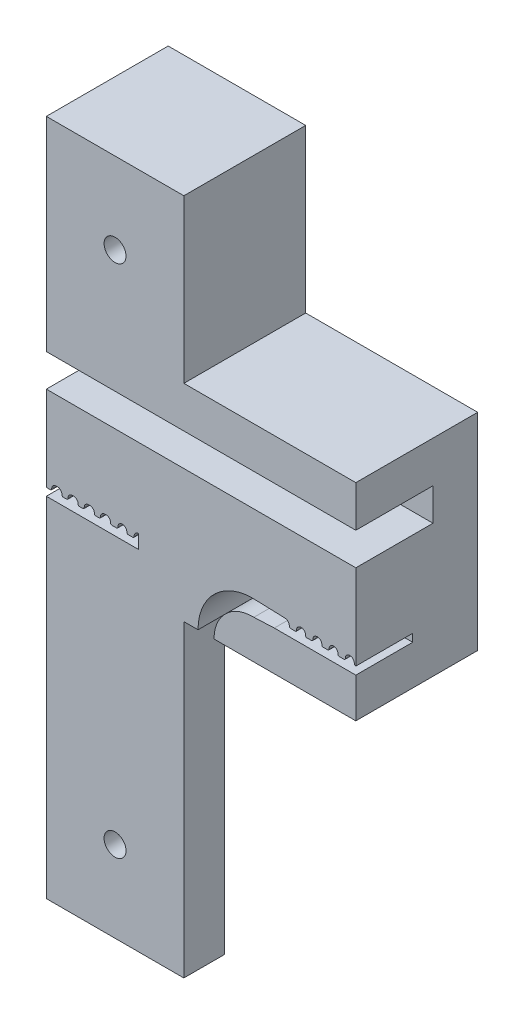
ISO-10303-21;
HEADER;
FILE_DESCRIPTION(('STEP AP214'),'2;1');
FILE_NAME('part.step','',(''),(''),'','','');
FILE_SCHEMA(('AUTOMOTIVE_DESIGN { 1 0 10303 214 1 1 1 1 }'));
ENDSEC;
DATA;
#1=APPLICATION_CONTEXT('core data for automotive mechanical design processes');
#2=APPLICATION_PROTOCOL_DEFINITION('international standard','automotive_design',2000,#1);
#3=PRODUCT_CONTEXT('',#1,'mechanical');
#4=PRODUCT('Part','Part','',(#3));
#5=PRODUCT_RELATED_PRODUCT_CATEGORY('part','',(#4));
#6=PRODUCT_DEFINITION_FORMATION('','',#4);
#7=PRODUCT_DEFINITION_CONTEXT('part definition',#1,'design');
#8=PRODUCT_DEFINITION('design','',#6,#7);
#9=PRODUCT_DEFINITION_SHAPE('','',#8);
#10=(LENGTH_UNIT() NAMED_UNIT(*) SI_UNIT(.MILLI.,.METRE.));
#11=(NAMED_UNIT(*) PLANE_ANGLE_UNIT() SI_UNIT($,.RADIAN.));
#12=(NAMED_UNIT(*) SI_UNIT($,.STERADIAN.) SOLID_ANGLE_UNIT());
#13=UNCERTAINTY_MEASURE_WITH_UNIT(LENGTH_MEASURE(1.E-05),#10,'distance_accuracy_value','');
#14=(GEOMETRIC_REPRESENTATION_CONTEXT(3) GLOBAL_UNCERTAINTY_ASSIGNED_CONTEXT((#13)) GLOBAL_UNIT_ASSIGNED_CONTEXT((#10,
#11,#12)) REPRESENTATION_CONTEXT('',''));
#15=CARTESIAN_POINT('',(0.,0.,0.));
#16=DIRECTION('',(0.,0.,1.));
#17=DIRECTION('',(1.,0.,0.));
#18=AXIS2_PLACEMENT_3D('',#15,#16,#17);
#19=CARTESIAN_POINT('',(0.,0.,12.46));
#20=DIRECTION('',(0.,0.,-1.));
#21=DIRECTION('',(-1.,0.,0.));
#22=AXIS2_PLACEMENT_3D('',#19,#20,#21);
#23=PLANE('',#22);
#24=CARTESIAN_POINT('',(-4.24,-40.7,12.46));
#25=DIRECTION('',(0.,0.,1.));
#26=DIRECTION('',(1.,0.,0.));
#27=AXIS2_PLACEMENT_3D('',#24,#25,#26);
#28=CIRCLE('',#27,1.35);
#29=CARTESIAN_POINT('',(-2.89,-40.7,12.46));
#30=VERTEX_POINT('',#29);
#31=EDGE_CURVE('E829',#30,#30,#28,.T.);
#32=ORIENTED_EDGE('',*,*,#31,.F.);
#33=EDGE_LOOP('',(#32));
#34=FACE_BOUND('',#33,.T.);
#35=DIRECTION('',(1.,0.,0.));
#36=VECTOR('',#35,1.);
#37=CARTESIAN_POINT('',(-25.4,3.62,12.46));
#38=LINE('',#37,#36);
#39=CARTESIAN_POINT('',(-12.7,3.62,12.46));
#40=VERTEX_POINT('',#39);
#41=CARTESIAN_POINT('',(25.4,3.62,12.46));
#42=VERTEX_POINT('',#41);
#43=EDGE_CURVE('E1740',#40,#42,#38,.T.);
#44=ORIENTED_EDGE('',*,*,#43,.F.);
#45=DIRECTION('',(0.,1.,0.));
#46=VECTOR('',#45,1.);
#47=CARTESIAN_POINT('',(-12.7,32.7,12.46));
#48=LINE('',#47,#46);
#49=CARTESIAN_POINT('',(-12.7,-6.8600879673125,12.46));
#50=VERTEX_POINT('',#49);
#51=EDGE_CURVE('E851',#50,#40,#48,.T.);
#52=ORIENTED_EDGE('',*,*,#51,.F.);
#53=DIRECTION('',(0.999999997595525,6.9346592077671E-05,0.));
#54=VECTOR('',#53,1.);
#55=CARTESIAN_POINT('',(-12.1837012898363,-6.86004956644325,12.46));
#56=LINE('',#55,#54);
#57=CARTESIAN_POINT('',(-12.1837012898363,-6.86004956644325,12.46));
#58=VERTEX_POINT('',#57);
#59=EDGE_CURVE('E1153',#50,#58,#56,.T.);
#60=ORIENTED_EDGE('',*,*,#59,.T.);
#61=CARTESIAN_POINT('',(-12.1837116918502,-6.71004920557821,12.46));
#62=DIRECTION('',(0.,0.,1.));
#63=DIRECTION('',(1.,0.,0.));
#64=AXIS2_PLACEMENT_3D('',#61,#62,#63);
#65=CIRCLE('',#64,0.15000036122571);
#66=CARTESIAN_POINT('',(-12.0341693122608,-6.69833660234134,12.46));
#67=VERTEX_POINT('',#66);
#68=EDGE_CURVE('E1280',#58,#67,#65,.T.);
#69=ORIENTED_EDGE('',*,*,#68,.T.);
#70=CARTESIAN_POINT('',(-11.4808649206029,-6.65500015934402,12.46));
#71=DIRECTION('',(0.,0.,-1.));
#72=DIRECTION('',(1.,0.,0.));
#73=AXIS2_PLACEMENT_3D('',#70,#71,#72);
#74=CIRCLE('',#73,0.554998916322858);
#75=CARTESIAN_POINT('',(-12.0358629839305,-6.65597320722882,12.46));
#76=VERTEX_POINT('',#75);
#77=EDGE_CURVE('E1277',#67,#76,#74,.T.);
#78=ORIENTED_EDGE('',*,*,#77,.T.);
#79=DIRECTION('',(0.,1.,0.));
#80=VECTOR('',#79,1.);
#81=CARTESIAN_POINT('',(-12.0358629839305,-6.65500015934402,12.46));
#82=LINE('',#81,#80);
#83=CARTESIAN_POINT('',(-12.0358629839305,-6.65500015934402,12.46));
#84=VERTEX_POINT('',#83);
#85=EDGE_CURVE('E1274',#76,#84,#82,.T.);
#86=ORIENTED_EDGE('',*,*,#85,.T.);
#87=CARTESIAN_POINT('',(-11.4808649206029,-6.65500015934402,12.46));
#88=DIRECTION('',(0.,0.,-1.));
#89=DIRECTION('',(1.,0.,0.));
#90=AXIS2_PLACEMENT_3D('',#87,#88,#89);
#91=CIRCLE('',#90,0.554998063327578);
#92=CARTESIAN_POINT('',(-11.4808649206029,-6.10000209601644,12.46));
#93=VERTEX_POINT('',#92);
#94=EDGE_CURVE('E1271',#84,#93,#91,.T.);
#95=ORIENTED_EDGE('',*,*,#94,.T.);
#96=DIRECTION('',(1.,0.,0.));
#97=VECTOR('',#96,1.);
#98=CARTESIAN_POINT('',(-11.474554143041,-6.10000209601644,12.46));
#99=LINE('',#98,#97);
#100=CARTESIAN_POINT('',(-11.474554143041,-6.10000209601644,12.46));
#101=VERTEX_POINT('',#100);
#102=EDGE_CURVE('E1268',#93,#101,#99,.T.);
#103=ORIENTED_EDGE('',*,*,#102,.T.);
#104=CARTESIAN_POINT('',(-11.4809424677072,-6.65496532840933,12.46));
#105=DIRECTION('',(0.,0.,-1.));
#106=DIRECTION('',(1.,0.,0.));
#107=AXIS2_PLACEMENT_3D('',#104,#105,#106);
#108=CIRCLE('',#107,0.555000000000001);
#109=CARTESIAN_POINT('',(-11.3347848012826,-6.11955619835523,12.46));
#110=VERTEX_POINT('',#109);
#111=EDGE_CURVE('E1265',#101,#110,#108,.T.);
#112=ORIENTED_EDGE('',*,*,#111,.T.);
#113=DIRECTION('',(0.,1.,0.));
#114=VECTOR('',#113,1.);
#115=CARTESIAN_POINT('',(-11.3347848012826,-6.10035655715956,12.46));
#116=LINE('',#115,#114);
#117=CARTESIAN_POINT('',(-11.3347848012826,-6.10035655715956,12.46));
#118=VERTEX_POINT('',#117);
#119=EDGE_CURVE('E820',#110,#118,#116,.T.);
#120=ORIENTED_EDGE('',*,*,#119,.T.);
#121=DIRECTION('',(0.00410134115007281,0.999991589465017,0.));
#122=VECTOR('',#121,1.);
#123=CARTESIAN_POINT('',(-11.3347833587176,-6.10000483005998,12.46));
#124=LINE('',#123,#122);
#125=CARTESIAN_POINT('',(-11.3347833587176,-6.10000483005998,12.46));
#126=VERTEX_POINT('',#125);
#127=EDGE_CURVE('E871',#118,#126,#124,.T.);
#128=ORIENTED_EDGE('',*,*,#127,.T.);
#129=CARTESIAN_POINT('',(-11.3409442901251,-6.65497063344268,12.46));
#130=DIRECTION('',(0.,0.,-1.));
#131=DIRECTION('',(1.,0.,0.));
#132=AXIS2_PLACEMENT_3D('',#129,#130,#131);
#133=CIRCLE('',#132,0.555000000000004);
#134=CARTESIAN_POINT('',(-10.7868867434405,-6.62264053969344,12.46));
#135=VERTEX_POINT('',#134);
#136=EDGE_CURVE('E1064',#126,#135,#133,.T.);
#137=ORIENTED_EDGE('',*,*,#136,.T.);
#138=DIRECTION('',(1.,0.,0.));
#139=VECTOR('',#138,1.);
#140=CARTESIAN_POINT('',(-10.78500091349,-6.62264053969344,12.46));
#141=LINE('',#140,#139);
#142=CARTESIAN_POINT('',(-10.78500091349,-6.62264053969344,12.46));
#143=VERTEX_POINT('',#142);
#144=EDGE_CURVE('E1061',#135,#143,#141,.T.);
#145=ORIENTED_EDGE('',*,*,#144,.T.);
#146=DIRECTION('',(0.,-1.,0.));
#147=VECTOR('',#146,1.);
#148=CARTESIAN_POINT('',(-10.78500091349,-6.71000206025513,12.46));
#149=LINE('',#148,#147);
#150=CARTESIAN_POINT('',(-10.78500091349,-6.71000206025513,12.46));
#151=VERTEX_POINT('',#150);
#152=EDGE_CURVE('E1058',#143,#151,#149,.T.);
#153=ORIENTED_EDGE('',*,*,#152,.T.);
#154=CARTESIAN_POINT('',(-10.63500091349,-6.71000206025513,12.46));
#155=DIRECTION('',(0.,0.,1.));
#156=DIRECTION('',(1.,0.,0.));
#157=AXIS2_PLACEMENT_3D('',#154,#155,#156);
#158=CIRCLE('',#157,0.14999999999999);
#159=CARTESIAN_POINT('',(-10.6350009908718,-6.8600020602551,12.46));
#160=VERTEX_POINT('',#159);
#161=EDGE_CURVE('E1055',#151,#160,#158,.T.);
#162=ORIENTED_EDGE('',*,*,#161,.T.);
#163=DIRECTION('',(0.999999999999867,-5.15664269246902E-07,0.));
#164=VECTOR('',#163,1.);
#165=CARTESIAN_POINT('',(-10.1837941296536,-6.86000237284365,12.46));
#166=LINE('',#165,#164);
#167=CARTESIAN_POINT('',(-10.1837941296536,-6.86000237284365,12.46));
#168=VERTEX_POINT('',#167);
#169=EDGE_CURVE('E1263',#160,#168,#166,.T.);
#170=ORIENTED_EDGE('',*,*,#169,.T.);
#171=CARTESIAN_POINT('',(-10.1837940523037,-6.71000201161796,12.46));
#172=DIRECTION('',(0.,0.,1.));
#173=DIRECTION('',(1.,0.,0.));
#174=AXIS2_PLACEMENT_3D('',#171,#172,#173);
#175=CIRCLE('',#174,0.150000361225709);
#176=CARTESIAN_POINT('',(-10.0342508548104,-6.69829985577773,12.46));
#177=VERTEX_POINT('',#176);
#178=EDGE_CURVE('E1260',#168,#177,#175,.T.);
#179=ORIENTED_EDGE('',*,*,#178,.T.);
#180=CARTESIAN_POINT('',(-9.4809424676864,-6.65500199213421,12.46));
#181=DIRECTION('',(0.,0.,-1.));
#182=DIRECTION('',(1.,0.,0.));
#183=AXIS2_PLACEMENT_3D('',#180,#181,#182);
#184=CIRCLE('',#183,0.55499988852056);
#185=CARTESIAN_POINT('',(-10.0359416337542,-6.65589749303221,12.46));
#186=VERTEX_POINT('',#185);
#187=EDGE_CURVE('E1257',#177,#186,#184,.T.);
#188=ORIENTED_EDGE('',*,*,#187,.T.);
#189=DIRECTION('',(0.000147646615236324,0.999999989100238,0.));
#190=VECTOR('',#189,1.);
#191=CARTESIAN_POINT('',(-10.0359414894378,-6.6549200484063,12.46));
#192=LINE('',#191,#190);
#193=CARTESIAN_POINT('',(-10.0359414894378,-6.6549200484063,12.46));
#194=VERTEX_POINT('',#193);
#195=EDGE_CURVE('E1254',#186,#194,#192,.T.);
#196=ORIENTED_EDGE('',*,*,#195,.T.);
#197=CARTESIAN_POINT('',(-9.4809424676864,-6.65500199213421,12.46));
#198=DIRECTION('',(0.,0.,-1.));
#199=DIRECTION('',(1.,0.,0.));
#200=AXIS2_PLACEMENT_3D('',#197,#198,#199);
#201=CIRCLE('',#200,0.554999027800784);
#202=CARTESIAN_POINT('',(-9.4809424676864,-6.10000296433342,12.46));
#203=VERTEX_POINT('',#202);
#204=EDGE_CURVE('E1251',#194,#203,#201,.T.);
#205=ORIENTED_EDGE('',*,*,#204,.T.);
#206=DIRECTION('',(1.,0.,0.));
#207=VECTOR('',#206,1.);
#208=CARTESIAN_POINT('',(-9.47478240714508,-6.10000296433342,12.46));
#209=LINE('',#208,#207);
#210=CARTESIAN_POINT('',(-9.47478240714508,-6.10000296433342,12.46));
#211=VERTEX_POINT('',#210);
#212=EDGE_CURVE('E1248',#203,#211,#209,.T.);
#213=ORIENTED_EDGE('',*,*,#212,.T.);
#214=CARTESIAN_POINT('',(-9.4809424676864,-6.65496877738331,12.46));
#215=DIRECTION('',(0.,0.,-1.));
#216=DIRECTION('',(1.,0.,0.));
#217=AXIS2_PLACEMENT_3D('',#214,#215,#216);
#218=CIRCLE('',#217,0.554999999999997);
#219=CARTESIAN_POINT('',(-9.41081099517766,-6.10441762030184,12.46));
#220=VERTEX_POINT('',#219);
#221=EDGE_CURVE('E1245',#211,#220,#218,.T.);
#222=ORIENTED_EDGE('',*,*,#221,.T.);
#223=CARTESIAN_POINT('',(-9.34094158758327,-6.65500198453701,12.46));
#224=DIRECTION('',(0.,0.,-1.));
#225=DIRECTION('',(1.,0.,0.));
#226=AXIS2_PLACEMENT_3D('',#223,#224,#225);
#227=CIRCLE('',#226,0.554999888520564);
#228=CARTESIAN_POINT('',(-9.34094158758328,-6.10000209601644,12.46));
#229=VERTEX_POINT('',#228);
#230=EDGE_CURVE('E1052',#220,#229,#227,.T.);
#231=ORIENTED_EDGE('',*,*,#230,.T.);
#232=DIRECTION('',(1.,0.,0.));
#233=VECTOR('',#232,1.);
#234=CARTESIAN_POINT('',(-9.33478238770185,-6.10000209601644,12.46));
#235=LINE('',#234,#233);
#236=CARTESIAN_POINT('',(-9.33478238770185,-6.10000209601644,12.46));
#237=VERTEX_POINT('',#236);
#238=EDGE_CURVE('E1049',#229,#237,#235,.T.);
#239=ORIENTED_EDGE('',*,*,#238,.T.);
#240=CARTESIAN_POINT('',(-9.34086479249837,-6.65496876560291,12.46));
#241=DIRECTION('',(0.,0.,-1.));
#242=DIRECTION('',(1.,0.,0.));
#243=AXIS2_PLACEMENT_3D('',#240,#241,#242);
#244=CIRCLE('',#243,0.555000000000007);
#245=CARTESIAN_POINT('',(-8.78681193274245,-6.62255844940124,12.46));
#246=VERTEX_POINT('',#245);
#247=EDGE_CURVE('E1046',#237,#246,#244,.T.);
#248=ORIENTED_EDGE('',*,*,#247,.T.);
#249=DIRECTION('',(0.99999999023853,0.000139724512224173,0.));
#250=VECTOR('',#249,1.);
#251=CARTESIAN_POINT('',(-8.78492468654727,-6.62255818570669,12.46));
#252=LINE('',#251,#250);
#253=CARTESIAN_POINT('',(-8.78492468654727,-6.62255818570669,12.46));
#254=VERTEX_POINT('',#253);
#255=EDGE_CURVE('E1043',#246,#254,#252,.T.);
#256=ORIENTED_EDGE('',*,*,#255,.T.);
#257=DIRECTION('',(6.98622563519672E-05,-0.999999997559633,0.));
#258=VECTOR('',#257,1.);
#259=CARTESIAN_POINT('',(-8.78491857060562,-6.71010104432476,12.46));
#260=LINE('',#259,#258);
#261=CARTESIAN_POINT('',(-8.78491857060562,-6.71010104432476,12.46));
#262=VERTEX_POINT('',#261);
#263=EDGE_CURVE('E1040',#254,#262,#260,.T.);
#264=ORIENTED_EDGE('',*,*,#263,.T.);
#265=CARTESIAN_POINT('',(-8.63491857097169,-6.7100905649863,12.46));
#266=DIRECTION('',(0.,0.,1.));
#267=DIRECTION('',(1.,0.,0.));
#268=AXIS2_PLACEMENT_3D('',#265,#266,#267);
#269=CIRCLE('',#268,0.149999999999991);
#270=CARTESIAN_POINT('',(-8.64009878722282,-6.86000108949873,12.46));
#271=VERTEX_POINT('',#270);
#272=EDGE_CURVE('E1037',#262,#271,#269,.T.);
#273=ORIENTED_EDGE('',*,*,#272,.T.);
#274=DIRECTION('',(0.999999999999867,-5.15664266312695E-07,0.));
#275=VECTOR('',#274,1.);
#276=CARTESIAN_POINT('',(-8.18379316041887,-6.86000132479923,12.46));
#277=LINE('',#276,#275);
#278=CARTESIAN_POINT('',(-8.18379316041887,-6.86000132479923,12.46));
#279=VERTEX_POINT('',#278);
#280=EDGE_CURVE('E1243',#271,#279,#277,.T.);
#281=ORIENTED_EDGE('',*,*,#280,.T.);
#282=CARTESIAN_POINT('',(-8.18379308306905,-6.71000096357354,12.46));
#283=DIRECTION('',(0.,0.,1.));
#284=DIRECTION('',(1.,0.,0.));
#285=AXIS2_PLACEMENT_3D('',#282,#283,#284);
#286=CIRCLE('',#285,0.15000036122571);
#287=CARTESIAN_POINT('',(-8.0342498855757,-6.69829880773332,12.46));
#288=VERTEX_POINT('',#287);
#289=EDGE_CURVE('E1240',#279,#288,#286,.T.);
#290=ORIENTED_EDGE('',*,*,#289,.T.);
#291=CARTESIAN_POINT('',(-7.4809424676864,-6.655001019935,12.46));
#292=DIRECTION('',(0.,0.,-1.));
#293=DIRECTION('',(1.,0.,0.));
#294=AXIS2_PLACEMENT_3D('',#291,#292,#293);
#295=CIRCLE('',#294,0.55499891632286);
#296=CARTESIAN_POINT('',(-8.03594066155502,-6.65589652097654,12.46));
#297=VERTEX_POINT('',#296);
#298=EDGE_CURVE('E1237',#288,#297,#295,.T.);
#299=ORIENTED_EDGE('',*,*,#298,.T.);
#300=DIRECTION('',(0.000147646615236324,0.999999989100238,0.));
#301=VECTOR('',#300,1.);
#302=CARTESIAN_POINT('',(-8.03594051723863,-6.65491907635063,12.46));
#303=LINE('',#302,#301);
#304=CARTESIAN_POINT('',(-8.03594051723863,-6.65491907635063,12.46));
#305=VERTEX_POINT('',#304);
#306=EDGE_CURVE('E1234',#297,#305,#303,.T.);
#307=ORIENTED_EDGE('',*,*,#306,.T.);
#308=CARTESIAN_POINT('',(-7.4809424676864,-6.655001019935,12.46));
#309=DIRECTION('',(0.,0.,-1.));
#310=DIRECTION('',(1.,0.,0.));
#311=AXIS2_PLACEMENT_3D('',#308,#309,#310);
#312=CIRCLE('',#311,0.554998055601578);
#313=CARTESIAN_POINT('',(-7.4809424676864,-6.10000296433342,12.46));
#314=VERTEX_POINT('',#313);
#315=EDGE_CURVE('E1231',#305,#314,#312,.T.);
#316=ORIENTED_EDGE('',*,*,#315,.T.);
#317=DIRECTION('',(1.,0.,0.));
#318=VECTOR('',#317,1.);
#319=CARTESIAN_POINT('',(-7.47478240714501,-6.10000296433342,12.46));
#320=LINE('',#319,#318);
#321=CARTESIAN_POINT('',(-7.47478240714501,-6.10000296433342,12.46));
#322=VERTEX_POINT('',#321);
#323=EDGE_CURVE('E1228',#314,#322,#320,.T.);
#324=ORIENTED_EDGE('',*,*,#323,.T.);
#325=CARTESIAN_POINT('',(-7.48094246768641,-6.65496877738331,12.46));
#326=DIRECTION('',(0.,0.,-1.));
#327=DIRECTION('',(1.,0.,0.));
#328=AXIS2_PLACEMENT_3D('',#325,#326,#327);
#329=CIRCLE('',#328,0.554999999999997);
#330=CARTESIAN_POINT('',(-7.41077267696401,-6.10442250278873,12.46));
#331=VERTEX_POINT('',#330);
#332=EDGE_CURVE('E1225',#322,#331,#329,.T.);
#333=ORIENTED_EDGE('',*,*,#332,.T.);
#334=CARTESIAN_POINT('',(-7.3408649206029,-6.65500015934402,12.46));
#335=DIRECTION('',(0.,0.,-1.));
#336=DIRECTION('',(1.,0.,0.));
#337=AXIS2_PLACEMENT_3D('',#334,#335,#336);
#338=CIRCLE('',#337,0.554998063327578);
#339=CARTESIAN_POINT('',(-7.3408649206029,-6.10000209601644,12.46));
#340=VERTEX_POINT('',#339);
#341=EDGE_CURVE('E1034',#331,#340,#338,.T.);
#342=ORIENTED_EDGE('',*,*,#341,.T.);
#343=DIRECTION('',(1.,0.,0.));
#344=VECTOR('',#343,1.);
#345=CARTESIAN_POINT('',(-7.33455414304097,-6.10000209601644,12.46));
#346=LINE('',#345,#344);
#347=CARTESIAN_POINT('',(-7.33455414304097,-6.10000209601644,12.46));
#348=VERTEX_POINT('',#347);
#349=EDGE_CURVE('E1031',#340,#348,#346,.T.);
#350=ORIENTED_EDGE('',*,*,#349,.T.);
#351=CARTESIAN_POINT('',(-7.34094246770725,-6.65496532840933,12.46));
#352=DIRECTION('',(0.,0.,-1.));
#353=DIRECTION('',(1.,0.,0.));
#354=AXIS2_PLACEMENT_3D('',#351,#352,#353);
#355=CIRCLE('',#354,0.555000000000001);
#356=CARTESIAN_POINT('',(-6.78688497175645,-6.62263436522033,12.46));
#357=VERTEX_POINT('',#356);
#358=EDGE_CURVE('E1028',#348,#357,#355,.T.);
#359=ORIENTED_EDGE('',*,*,#358,.T.);
#360=DIRECTION('',(1.,0.,0.));
#361=VECTOR('',#360,1.);
#362=CARTESIAN_POINT('',(-6.78500093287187,-6.62263436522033,12.46));
#363=LINE('',#362,#361);
#364=CARTESIAN_POINT('',(-6.78500093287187,-6.62263436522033,12.46));
#365=VERTEX_POINT('',#364);
#366=EDGE_CURVE('E1025',#357,#365,#363,.T.);
#367=ORIENTED_EDGE('',*,*,#366,.T.);
#368=DIRECTION('',(0.,-1.,0.));
#369=VECTOR('',#368,1.);
#370=CARTESIAN_POINT('',(-6.78500093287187,-6.71000206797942,12.46));
#371=LINE('',#370,#369);
#372=CARTESIAN_POINT('',(-6.78500093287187,-6.71000206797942,12.46));
#373=VERTEX_POINT('',#372);
#374=EDGE_CURVE('E1022',#365,#373,#371,.T.);
#375=ORIENTED_EDGE('',*,*,#374,.T.);
#376=CARTESIAN_POINT('',(-6.63500093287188,-6.71000206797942,12.46));
#377=DIRECTION('',(0.,0.,1.));
#378=DIRECTION('',(1.,0.,0.));
#379=AXIS2_PLACEMENT_3D('',#376,#377,#378);
#380=CIRCLE('',#379,0.14999999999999);
#381=CARTESIAN_POINT('',(-6.63500101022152,-6.86000206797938,12.46));
#382=VERTEX_POINT('',#381);
#383=EDGE_CURVE('E1019',#373,#382,#380,.T.);
#384=ORIENTED_EDGE('',*,*,#383,.T.);
#385=DIRECTION('',(0.999999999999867,-5.15664258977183E-07,0.));
#386=VECTOR('',#385,1.);
#387=CARTESIAN_POINT('',(-6.18379412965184,-6.86000042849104,12.46));
#388=LINE('',#387,#386);
#389=CARTESIAN_POINT('',(-6.18379412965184,-6.86000042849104,12.46));
#390=VERTEX_POINT('',#389);
#391=EDGE_CURVE('E1223',#382,#390,#388,.T.);
#392=ORIENTED_EDGE('',*,*,#391,.T.);
#393=CARTESIAN_POINT('',(-6.18379405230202,-6.71000006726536,12.46));
#394=DIRECTION('',(0.,0.,1.));
#395=DIRECTION('',(1.,0.,0.));
#396=AXIS2_PLACEMENT_3D('',#393,#394,#395);
#397=CIRCLE('',#396,0.150000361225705);
#398=CARTESIAN_POINT('',(-6.03425085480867,-6.69829791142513,12.46));
#399=VERTEX_POINT('',#398);
#400=EDGE_CURVE('E1220',#390,#399,#397,.T.);
#401=ORIENTED_EDGE('',*,*,#400,.T.);
#402=CARTESIAN_POINT('',(-5.48094246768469,-6.6550000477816,12.46));
#403=DIRECTION('',(0.,0.,-1.));
#404=DIRECTION('',(1.,0.,0.));
#405=AXIS2_PLACEMENT_3D('',#402,#403,#404);
#406=CIRCLE('',#405,0.554999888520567);
#407=CARTESIAN_POINT('',(-6.03594163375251,-6.65589554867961,12.46));
#408=VERTEX_POINT('',#407);
#409=EDGE_CURVE('E1217',#399,#408,#406,.T.);
#410=ORIENTED_EDGE('',*,*,#409,.T.);
#411=DIRECTION('',(0.000147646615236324,0.999999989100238,0.));
#412=VECTOR('',#411,1.);
#413=CARTESIAN_POINT('',(-6.03594148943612,-6.65491810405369,12.46));
#414=LINE('',#413,#412);
#415=CARTESIAN_POINT('',(-6.03594148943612,-6.65491810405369,12.46));
#416=VERTEX_POINT('',#415);
#417=EDGE_CURVE('E1214',#408,#416,#414,.T.);
#418=ORIENTED_EDGE('',*,*,#417,.T.);
#419=CARTESIAN_POINT('',(-5.48094246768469,-6.6550000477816,12.46));
#420=DIRECTION('',(0.,0.,-1.));
#421=DIRECTION('',(1.,0.,0.));
#422=AXIS2_PLACEMENT_3D('',#419,#420,#421);
#423=CIRCLE('',#422,0.554999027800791);
#424=CARTESIAN_POINT('',(-5.50072747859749,-6.10035378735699,12.46));
#425=VERTEX_POINT('',#424);
#426=EDGE_CURVE('E1211',#416,#425,#423,.T.);
#427=ORIENTED_EDGE('',*,*,#426,.T.);
#428=DIRECTION('',(0.,-1.,0.));
#429=VECTOR('',#428,1.);
#430=CARTESIAN_POINT('',(-5.50072747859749,-6.10035378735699,12.46));
#431=LINE('',#430,#429);
#432=CARTESIAN_POINT('',(-5.50072747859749,-6.12350159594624,12.46));
#433=VERTEX_POINT('',#432);
#434=EDGE_CURVE('E1072',#425,#433,#431,.T.);
#435=ORIENTED_EDGE('',*,*,#434,.T.);
#436=CARTESIAN_POINT('',(-5.3409424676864,-6.65500199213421,12.46));
#437=DIRECTION('',(0.,0.,-1.));
#438=DIRECTION('',(1.,0.,0.));
#439=AXIS2_PLACEMENT_3D('',#436,#437,#438);
#440=CIRCLE('',#439,0.554999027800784);
#441=CARTESIAN_POINT('',(-5.3409424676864,-6.10000296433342,12.46));
#442=VERTEX_POINT('',#441);
#443=EDGE_CURVE('E1016',#433,#442,#440,.T.);
#444=ORIENTED_EDGE('',*,*,#443,.T.);
#445=DIRECTION('',(1.,0.,0.));
#446=VECTOR('',#445,1.);
#447=CARTESIAN_POINT('',(-5.33478240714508,-6.10000296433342,12.46));
#448=LINE('',#447,#446);
#449=CARTESIAN_POINT('',(-5.33478240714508,-6.10000296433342,12.46));
#450=VERTEX_POINT('',#449);
#451=EDGE_CURVE('E1013',#442,#450,#448,.T.);
#452=ORIENTED_EDGE('',*,*,#451,.T.);
#453=CARTESIAN_POINT('',(-5.3409424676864,-6.65496877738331,12.46));
#454=DIRECTION('',(0.,0.,-1.));
#455=DIRECTION('',(1.,0.,0.));
#456=AXIS2_PLACEMENT_3D('',#453,#454,#455);
#457=CIRCLE('',#456,0.554999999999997);
#458=CARTESIAN_POINT('',(-4.7868849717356,-6.62263781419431,12.46));
#459=VERTEX_POINT('',#458);
#460=EDGE_CURVE('E1010',#450,#459,#457,.T.);
#461=ORIENTED_EDGE('',*,*,#460,.T.);
#462=DIRECTION('',(1.,0.,0.));
#463=VECTOR('',#462,1.);
#464=CARTESIAN_POINT('',(-4.78499996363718,-6.62263781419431,12.46));
#465=LINE('',#464,#463);
#466=CARTESIAN_POINT('',(-4.78499996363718,-6.62263781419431,12.46));
#467=VERTEX_POINT('',#466);
#468=EDGE_CURVE('E1007',#459,#467,#465,.T.);
#469=ORIENTED_EDGE('',*,*,#468,.T.);
#470=DIRECTION('',(0.,-1.,0.));
#471=VECTOR('',#470,1.);
#472=CARTESIAN_POINT('',(-4.78499996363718,-6.710001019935,12.46));
#473=LINE('',#472,#471);
#474=CARTESIAN_POINT('',(-4.78499996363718,-6.710001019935,12.46));
#475=VERTEX_POINT('',#474);
#476=EDGE_CURVE('E1004',#467,#475,#473,.T.);
#477=ORIENTED_EDGE('',*,*,#476,.T.);
#478=CARTESIAN_POINT('',(-4.63499996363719,-6.710001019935,12.46));
#479=DIRECTION('',(0.,0.,1.));
#480=DIRECTION('',(1.,0.,0.));
#481=AXIS2_PLACEMENT_3D('',#478,#479,#480);
#482=CIRCLE('',#481,0.149999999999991);
#483=CARTESIAN_POINT('',(-4.63500004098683,-6.86000101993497,12.46));
#484=VERTEX_POINT('',#483);
#485=EDGE_CURVE('E1001',#475,#484,#482,.T.);
#486=ORIENTED_EDGE('',*,*,#485,.T.);
#487=DIRECTION('',(0.999999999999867,-5.15664266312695E-07,0.));
#488=VECTOR('',#487,1.);
#489=CARTESIAN_POINT('',(-4.04379316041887,-6.86000132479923,12.46));
#490=LINE('',#489,#488);
#491=CARTESIAN_POINT('',(-4.04379316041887,-6.86000132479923,12.46));
#492=VERTEX_POINT('',#491);
#493=EDGE_CURVE('E998',#484,#492,#490,.T.);
#494=ORIENTED_EDGE('',*,*,#493,.T.);
#495=CARTESIAN_POINT('',(-4.04379308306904,-6.71000096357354,12.46));
#496=DIRECTION('',(0.,0.,1.));
#497=DIRECTION('',(1.,0.,0.));
#498=AXIS2_PLACEMENT_3D('',#495,#496,#497);
#499=CIRCLE('',#498,0.15000036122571);
#500=CARTESIAN_POINT('',(-3.89424988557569,-6.69829880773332,12.46));
#501=VERTEX_POINT('',#500);
#502=EDGE_CURVE('E995',#492,#501,#499,.T.);
#503=ORIENTED_EDGE('',*,*,#502,.T.);
#504=CARTESIAN_POINT('',(-3.3409424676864,-6.655001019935,12.46));
#505=DIRECTION('',(0.,0.,-1.));
#506=DIRECTION('',(1.,0.,0.));
#507=AXIS2_PLACEMENT_3D('',#504,#505,#506);
#508=CIRCLE('',#507,0.55499891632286);
#509=CARTESIAN_POINT('',(-3.89594066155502,-6.65589652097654,12.46));
#510=VERTEX_POINT('',#509);
#511=EDGE_CURVE('E992',#501,#510,#508,.T.);
#512=ORIENTED_EDGE('',*,*,#511,.T.);
#513=DIRECTION('',(0.000147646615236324,0.999999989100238,0.));
#514=VECTOR('',#513,1.);
#515=CARTESIAN_POINT('',(-3.89594051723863,-6.65491907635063,12.46));
#516=LINE('',#515,#514);
#517=CARTESIAN_POINT('',(-3.89594051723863,-6.65491907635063,12.46));
#518=VERTEX_POINT('',#517);
#519=EDGE_CURVE('E989',#510,#518,#516,.T.);
#520=ORIENTED_EDGE('',*,*,#519,.T.);
#521=CARTESIAN_POINT('',(-3.3409424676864,-6.655001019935,12.46));
#522=DIRECTION('',(0.,0.,-1.));
#523=DIRECTION('',(1.,0.,0.));
#524=AXIS2_PLACEMENT_3D('',#521,#522,#523);
#525=CIRCLE('',#524,0.554998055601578);
#526=CARTESIAN_POINT('',(-3.3409424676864,-6.10000296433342,12.46));
#527=VERTEX_POINT('',#526);
#528=EDGE_CURVE('E986',#518,#527,#525,.T.);
#529=ORIENTED_EDGE('',*,*,#528,.T.);
#530=DIRECTION('',(1.,0.,0.));
#531=VECTOR('',#530,1.);
#532=CARTESIAN_POINT('',(-3.33478240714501,-6.10000296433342,12.46));
#533=LINE('',#532,#531);
#534=CARTESIAN_POINT('',(-3.33478240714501,-6.10000296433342,12.46));
#535=VERTEX_POINT('',#534);
#536=EDGE_CURVE('E983',#527,#535,#533,.T.);
#537=ORIENTED_EDGE('',*,*,#536,.T.);
#538=CARTESIAN_POINT('',(-3.34094246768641,-6.65496877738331,12.46));
#539=DIRECTION('',(0.,0.,-1.));
#540=DIRECTION('',(1.,0.,0.));
#541=AXIS2_PLACEMENT_3D('',#538,#539,#540);
#542=CIRCLE('',#541,0.554999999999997);
#543=CARTESIAN_POINT('',(-2.78688497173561,-6.62263781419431,12.46));
#544=VERTEX_POINT('',#543);
#545=EDGE_CURVE('E980',#535,#544,#542,.T.);
#546=ORIENTED_EDGE('',*,*,#545,.T.);
#547=DIRECTION('',(1.,0.,0.));
#548=VECTOR('',#547,1.);
#549=CARTESIAN_POINT('',(-2.78500093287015,-6.62263781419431,12.46));
#550=LINE('',#549,#548);
#551=CARTESIAN_POINT('',(-2.78500093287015,-6.62263781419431,12.46));
#552=VERTEX_POINT('',#551);
#553=EDGE_CURVE('E977',#544,#552,#550,.T.);
#554=ORIENTED_EDGE('',*,*,#553,.T.);
#555=DIRECTION('',(0.,-1.,0.));
#556=VECTOR('',#555,1.);
#557=CARTESIAN_POINT('',(-2.78500093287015,-6.71000012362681,12.46));
#558=LINE('',#557,#556);
#559=CARTESIAN_POINT('',(-2.78500093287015,-6.71000012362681,12.46));
#560=VERTEX_POINT('',#559);
#561=EDGE_CURVE('E974',#552,#560,#558,.T.);
#562=ORIENTED_EDGE('',*,*,#561,.T.);
#563=CARTESIAN_POINT('',(-2.63500093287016,-6.71000012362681,12.46));
#564=DIRECTION('',(0.,0.,1.));
#565=DIRECTION('',(1.,0.,0.));
#566=AXIS2_PLACEMENT_3D('',#563,#564,#565);
#567=CIRCLE('',#566,0.149999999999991);
#568=CARTESIAN_POINT('',(-2.6350010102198,-6.86000012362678,12.46));
#569=VERTEX_POINT('',#568);
#570=EDGE_CURVE('E971',#560,#569,#567,.T.);
#571=ORIENTED_EDGE('',*,*,#570,.T.);
#572=DIRECTION('',(0.999999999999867,-5.15664258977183E-07,0.));
#573=VECTOR('',#572,1.);
#574=CARTESIAN_POINT('',(-2.04379412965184,-6.86000042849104,12.46));
#575=LINE('',#574,#573);
#576=CARTESIAN_POINT('',(-2.04379412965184,-6.86000042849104,12.46));
#577=VERTEX_POINT('',#576);
#578=EDGE_CURVE('E968',#569,#577,#575,.T.);
#579=ORIENTED_EDGE('',*,*,#578,.T.);
#580=CARTESIAN_POINT('',(-2.04379405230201,-6.71000006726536,12.46));
#581=DIRECTION('',(0.,0.,1.));
#582=DIRECTION('',(1.,0.,0.));
#583=AXIS2_PLACEMENT_3D('',#580,#581,#582);
#584=CIRCLE('',#583,0.150000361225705);
#585=CARTESIAN_POINT('',(-1.89425085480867,-6.69829791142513,12.46));
#586=VERTEX_POINT('',#585);
#587=EDGE_CURVE('E965',#577,#586,#584,.T.);
#588=ORIENTED_EDGE('',*,*,#587,.T.);
#589=CARTESIAN_POINT('',(-1.34094246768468,-6.6550000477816,12.46));
#590=DIRECTION('',(0.,0.,-1.));
#591=DIRECTION('',(1.,0.,0.));
#592=AXIS2_PLACEMENT_3D('',#589,#590,#591);
#593=CIRCLE('',#592,0.554999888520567);
#594=CARTESIAN_POINT('',(-1.89594163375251,-6.65589554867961,12.46));
#595=VERTEX_POINT('',#594);
#596=EDGE_CURVE('E962',#586,#595,#593,.T.);
#597=ORIENTED_EDGE('',*,*,#596,.T.);
#598=DIRECTION('',(0.000147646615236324,0.999999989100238,0.));
#599=VECTOR('',#598,1.);
#600=CARTESIAN_POINT('',(-1.89594148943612,-6.65491810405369,12.46));
#601=LINE('',#600,#599);
#602=CARTESIAN_POINT('',(-1.89594148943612,-6.65491810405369,12.46));
#603=VERTEX_POINT('',#602);
#604=EDGE_CURVE('E959',#595,#603,#601,.T.);
#605=ORIENTED_EDGE('',*,*,#604,.T.);
#606=CARTESIAN_POINT('',(-1.34094246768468,-6.6550000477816,12.46));
#607=DIRECTION('',(0.,0.,-1.));
#608=DIRECTION('',(1.,0.,0.));
#609=AXIS2_PLACEMENT_3D('',#606,#607,#608);
#610=CIRCLE('',#609,0.554999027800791);
#611=CARTESIAN_POINT('',(-1.36072747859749,-6.10035378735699,12.46));
#612=VERTEX_POINT('',#611);
#613=EDGE_CURVE('E956',#603,#612,#610,.T.);
#614=ORIENTED_EDGE('',*,*,#613,.T.);
#615=DIRECTION('',(0.,-1.,0.));
#616=VECTOR('',#615,1.);
#617=CARTESIAN_POINT('',(-1.36072747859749,-6.10035378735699,12.46));
#618=LINE('',#617,#616);
#619=CARTESIAN_POINT('',(-1.36072747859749,-7.800353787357,12.46));
#620=VERTEX_POINT('',#619);
#621=EDGE_CURVE('E953',#612,#620,#618,.T.);
#622=ORIENTED_EDGE('',*,*,#621,.T.);
#623=DIRECTION('',(1.,0.,0.));
#624=VECTOR('',#623,1.);
#625=CARTESIAN_POINT('',(-25.4392725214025,-7.800353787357,12.46));
#626=LINE('',#625,#624);
#627=CARTESIAN_POINT('',(-12.7,-7.800353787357,12.46));
#628=VERTEX_POINT('',#627);
#629=EDGE_CURVE('E1393',#628,#620,#626,.T.);
#630=ORIENTED_EDGE('',*,*,#629,.F.);
#631=CARTESIAN_POINT('',(-12.7,-50.7,12.46));
#632=VERTEX_POINT('',#631);
#633=EDGE_CURVE('E849',#632,#628,#48,.T.);
#634=ORIENTED_EDGE('',*,*,#633,.F.);
#635=DIRECTION('',(-1.,0.,0.));
#636=VECTOR('',#635,1.);
#637=CARTESIAN_POINT('',(-25.4,-50.7,12.46));
#638=LINE('',#637,#636);
#639=CARTESIAN_POINT('',(4.22522999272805,-50.7,12.46));
#640=VERTEX_POINT('',#639);
#641=EDGE_CURVE('E1339',#640,#632,#638,.T.);
#642=ORIENTED_EDGE('',*,*,#641,.F.);
#643=DIRECTION('',(0.,1.,0.));
#644=VECTOR('',#643,1.);
#645=CARTESIAN_POINT('',(4.22522999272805,-50.7,12.46));
#646=LINE('',#645,#644);
#647=CARTESIAN_POINT('',(4.22522999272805,-12.7,12.46));
#648=VERTEX_POINT('',#647);
#649=EDGE_CURVE('E1342',#640,#648,#646,.T.);
#650=ORIENTED_EDGE('',*,*,#649,.T.);
#651=DIRECTION('',(1.,0.,0.));
#652=VECTOR('',#651,1.);
#653=CARTESIAN_POINT('',(-25.4,-12.7,12.46));
#654=LINE('',#653,#652);
#655=CARTESIAN_POINT('',(5.97522999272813,-12.7,12.46));
#656=VERTEX_POINT('',#655);
#657=EDGE_CURVE('E1752',#648,#656,#654,.T.);
#658=ORIENTED_EDGE('',*,*,#657,.T.);
#659=CARTESIAN_POINT('',(12.7139532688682,-12.7000010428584,12.46));
#660=DIRECTION('',(0.,0.,1.));
#661=DIRECTION('',(1.,0.,0.));
#662=AXIS2_PLACEMENT_3D('',#659,#660,#661);
#663=CIRCLE('',#662,6.73872327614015);
#664=CARTESIAN_POINT('',(13.2560463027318,-5.98311735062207,12.46));
#665=VERTEX_POINT('',#664);
#666=EDGE_CURVE('E1503',#665,#656,#663,.T.);
#667=ORIENTED_EDGE('',*,*,#666,.F.);
#668=DIRECTION('',(-0.999414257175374,0.0342219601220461,0.));
#669=VECTOR('',#668,1.);
#670=CARTESIAN_POINT('',(16.6798066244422,-6.10035381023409,12.46));
#671=LINE('',#670,#669);
#672=CARTESIAN_POINT('',(16.6798066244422,-6.10035381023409,12.46));
#673=VERTEX_POINT('',#672);
#674=EDGE_CURVE('E1506',#673,#665,#671,.T.);
#675=ORIENTED_EDGE('',*,*,#674,.F.);
#676=CARTESIAN_POINT('',(16.6590574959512,-6.65496581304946,12.46));
#677=DIRECTION('',(0.,0.,1.));
#678=DIRECTION('',(1.,0.,0.));
#679=AXIS2_PLACEMENT_3D('',#676,#677,#678);
#680=CIRCLE('',#679,0.555000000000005);
#681=CARTESIAN_POINT('',(17.213114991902,-6.62263484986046,12.46));
#682=VERTEX_POINT('',#681);
#683=EDGE_CURVE('E1509',#682,#673,#680,.T.);
#684=ORIENTED_EDGE('',*,*,#683,.F.);
#685=DIRECTION('',(-1.,0.,0.));
#686=VECTOR('',#685,1.);
#687=CARTESIAN_POINT('',(17.2150000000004,-6.62263484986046,12.46));
#688=LINE('',#687,#686);
#689=CARTESIAN_POINT('',(17.2150000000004,-6.62263484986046,12.46));
#690=VERTEX_POINT('',#689);
#691=EDGE_CURVE('E1512',#690,#682,#688,.T.);
#692=ORIENTED_EDGE('',*,*,#691,.F.);
#693=DIRECTION('',(0.,1.,0.));
#694=VECTOR('',#693,1.);
#695=CARTESIAN_POINT('',(17.2150000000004,-6.70999999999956,12.46));
#696=LINE('',#695,#694);
#697=CARTESIAN_POINT('',(17.2150005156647,-6.70999999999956,12.46));
#698=VERTEX_POINT('',#697);
#699=EDGE_CURVE('E1515',#698,#690,#696,.T.);
#700=ORIENTED_EDGE('',*,*,#699,.F.);
#701=CARTESIAN_POINT('',(17.3650000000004,-6.70999999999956,12.46));
#702=DIRECTION('',(0.,0.,-1.));
#703=DIRECTION('',(1.,0.,0.));
#704=AXIS2_PLACEMENT_3D('',#701,#702,#703);
#705=CIRCLE('',#704,0.149999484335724);
#706=CARTESIAN_POINT('',(17.3649999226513,-6.85999896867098,12.46));
#707=VERTEX_POINT('',#706);
#708=EDGE_CURVE('E1518',#707,#698,#705,.T.);
#709=ORIENTED_EDGE('',*,*,#708,.F.);
#710=DIRECTION('',(-0.999999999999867,5.15664269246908E-07,0.));
#711=VECTOR('',#710,1.);
#712=CARTESIAN_POINT('',(17.9562068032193,-6.85999927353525,12.46));
#713=LINE('',#712,#711);
#714=CARTESIAN_POINT('',(17.9562068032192,-6.8599994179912,12.46));
#715=VERTEX_POINT('',#714);
#716=EDGE_CURVE('E1521',#715,#707,#713,.T.);
#717=ORIENTED_EDGE('',*,*,#716,.F.);
#718=CARTESIAN_POINT('',(17.9562068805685,-6.7099999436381,12.46));
#719=DIRECTION('',(0.,0.,-1.));
#720=DIRECTION('',(1.,0.,0.));
#721=AXIS2_PLACEMENT_3D('',#718,#719,#720);
#722=CIRCLE('',#721,0.149999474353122);
#723=CARTESIAN_POINT('',(18.1057493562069,-6.69829784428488,12.46));
#724=VERTEX_POINT('',#723);
#725=EDGE_CURVE('E1524',#724,#715,#722,.T.);
#726=ORIENTED_EDGE('',*,*,#725,.F.);
#727=CARTESIAN_POINT('',(18.6590574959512,-6.65499999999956,12.46));
#728=DIRECTION('',(0.,0.,1.));
#729=DIRECTION('',(1.,0.,0.));
#730=AXIS2_PLACEMENT_3D('',#727,#728,#729);
#731=CIRCLE('',#730,0.554999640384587);
#732=CARTESIAN_POINT('',(18.6590574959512,-6.09999999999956,12.46));
#733=VERTEX_POINT('',#732);
#734=EDGE_CURVE('E1527',#733,#724,#731,.T.);
#735=ORIENTED_EDGE('',*,*,#734,.F.);
#736=DIRECTION('',(-1.,0.,0.));
#737=VECTOR('',#736,1.);
#738=CARTESIAN_POINT('',(18.6590574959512,-6.09999999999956,12.46));
#739=LINE('',#738,#737);
#740=CARTESIAN_POINT('',(18.6652175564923,-6.09999999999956,12.46));
#741=VERTEX_POINT('',#740);
#742=EDGE_CURVE('E1530',#741,#733,#739,.T.);
#743=ORIENTED_EDGE('',*,*,#742,.F.);
#744=CARTESIAN_POINT('',(18.6590574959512,-6.65496581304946,12.46));
#745=DIRECTION('',(0.,0.,1.));
#746=DIRECTION('',(1.,0.,0.));
#747=AXIS2_PLACEMENT_3D('',#744,#745,#746);
#748=CIRCLE('',#747,0.555000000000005);
#749=CARTESIAN_POINT('',(19.213114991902,-6.62263484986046,12.46));
#750=VERTEX_POINT('',#749);
#751=EDGE_CURVE('E1533',#750,#741,#748,.T.);
#752=ORIENTED_EDGE('',*,*,#751,.F.);
#753=DIRECTION('',(-1.,0.,0.));
#754=VECTOR('',#753,1.);
#755=CARTESIAN_POINT('',(19.2150000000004,-6.62263484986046,12.46));
#756=LINE('',#755,#754);
#757=CARTESIAN_POINT('',(19.2150000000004,-6.62263484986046,12.46));
#758=VERTEX_POINT('',#757);
#759=EDGE_CURVE('E1536',#758,#750,#756,.T.);
#760=ORIENTED_EDGE('',*,*,#759,.F.);
#761=DIRECTION('',(0.,1.,0.));
#762=VECTOR('',#761,1.);
#763=CARTESIAN_POINT('',(19.2150000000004,-6.70999999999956,12.46));
#764=LINE('',#763,#762);
#765=CARTESIAN_POINT('',(19.2149994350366,-6.70999999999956,12.46));
#766=VERTEX_POINT('',#765);
#767=EDGE_CURVE('E1539',#766,#758,#764,.T.);
#768=ORIENTED_EDGE('',*,*,#767,.F.);
#769=CARTESIAN_POINT('',(19.3650000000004,-6.70999999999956,12.46));
#770=DIRECTION('',(0.,0.,-1.));
#771=DIRECTION('',(1.,0.,0.));
#772=AXIS2_PLACEMENT_3D('',#769,#770,#771);
#773=CIRCLE('',#772,0.150000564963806);
#774=CARTESIAN_POINT('',(19.3650000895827,-6.86000112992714,12.46));
#775=VERTEX_POINT('',#774);
#776=EDGE_CURVE('E1542',#775,#766,#773,.T.);
#777=ORIENTED_EDGE('',*,*,#776,.F.);
#778=DIRECTION('',(-0.999999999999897,4.53159913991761E-07,0.));
#779=VECTOR('',#778,1.);
#780=CARTESIAN_POINT('',(19.3650000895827,-6.86000112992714,12.46));
#781=LINE('',#780,#779);
#782=CARTESIAN_POINT('',(19.9562069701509,-6.86000118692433,12.46));
#783=VERTEX_POINT('',#782);
#784=EDGE_CURVE('E1545',#783,#775,#781,.T.);
#785=ORIENTED_EDGE('',*,*,#784,.F.);
#786=CARTESIAN_POINT('',(19.9562068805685,-6.7099999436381,12.46));
#787=DIRECTION('',(0.,0.,-1.));
#788=DIRECTION('',(1.,0.,0.));
#789=AXIS2_PLACEMENT_3D('',#786,#787,#788);
#790=CIRCLE('',#789,0.150001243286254);
#791=CARTESIAN_POINT('',(20.1057506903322,-6.69829773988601,12.46));
#792=VERTEX_POINT('',#791);
#793=EDGE_CURVE('E1548',#792,#783,#790,.T.);
#794=ORIENTED_EDGE('',*,*,#793,.F.);
#795=CARTESIAN_POINT('',(20.6590574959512,-6.65499999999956,12.46));
#796=DIRECTION('',(0.,0.,1.));
#797=DIRECTION('',(1.,0.,0.));
#798=AXIS2_PLACEMENT_3D('',#795,#796,#797);
#799=CIRCLE('',#798,0.554998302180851);
#800=CARTESIAN_POINT('',(20.6590574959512,-6.09999999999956,12.46));
#801=VERTEX_POINT('',#800);
#802=EDGE_CURVE('E1551',#801,#792,#799,.T.);
#803=ORIENTED_EDGE('',*,*,#802,.F.);
#804=DIRECTION('',(-1.,1.40779402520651E-13,0.));
#805=VECTOR('',#804,1.);
#806=CARTESIAN_POINT('',(20.6590574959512,-6.09999999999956,12.46));
#807=LINE('',#806,#805);
#808=CARTESIAN_POINT('',(20.6652186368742,-6.09999999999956,12.46));
#809=VERTEX_POINT('',#808);
#810=EDGE_CURVE('E1554',#809,#801,#807,.T.);
#811=ORIENTED_EDGE('',*,*,#810,.F.);
#812=CARTESIAN_POINT('',(20.6590834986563,-6.65496608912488,12.46));
#813=DIRECTION('',(0.,0.,1.));
#814=DIRECTION('',(1.,0.,0.));
#815=AXIS2_PLACEMENT_3D('',#812,#813,#814);
#816=CIRCLE('',#815,0.555000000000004);
#817=CARTESIAN_POINT('',(21.2131409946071,-6.62263512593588,12.46));
#818=VERTEX_POINT('',#817);
#819=EDGE_CURVE('E1557',#818,#809,#816,.T.);
#820=ORIENTED_EDGE('',*,*,#819,.F.);
#821=DIRECTION('',(-1.,0.,0.));
#822=VECTOR('',#821,1.);
#823=CARTESIAN_POINT('',(21.2150260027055,-6.62263512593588,12.46));
#824=LINE('',#823,#822);
#825=CARTESIAN_POINT('',(21.2150260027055,-6.62263512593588,12.46));
#826=VERTEX_POINT('',#825);
#827=EDGE_CURVE('E1560',#826,#818,#824,.T.);
#828=ORIENTED_EDGE('',*,*,#827,.F.);
#829=DIRECTION('',(0.,1.,0.));
#830=VECTOR('',#829,1.);
#831=CARTESIAN_POINT('',(21.2150260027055,-6.7100002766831,12.46));
#832=LINE('',#831,#830);
#833=CARTESIAN_POINT('',(21.2150251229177,-6.7100002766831,12.46));
#834=VERTEX_POINT('',#833);
#835=EDGE_CURVE('E1563',#834,#826,#832,.T.);
#836=ORIENTED_EDGE('',*,*,#835,.F.);
#837=CARTESIAN_POINT('',(21.3650260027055,-6.7100002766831,12.46));
#838=DIRECTION('',(0.,0.,-1.));
#839=DIRECTION('',(1.,0.,0.));
#840=AXIS2_PLACEMENT_3D('',#837,#838,#839);
#841=CIRCLE('',#840,0.150000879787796);
#842=CARTESIAN_POINT('',(21.3650259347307,-6.86000203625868,12.46));
#843=VERTEX_POINT('',#842);
#844=EDGE_CURVE('E1566',#843,#834,#841,.T.);
#845=ORIENTED_EDGE('',*,*,#844,.F.);
#846=DIRECTION('',(-0.999999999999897,4.53159912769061E-07,0.));
#847=VECTOR('',#846,1.);
#848=CARTESIAN_POINT('',(21.3650259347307,-6.86000203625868,12.46));
#849=LINE('',#848,#847);
#850=CARTESIAN_POINT('',(21.9562071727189,-6.86000081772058,12.46));
#851=VERTEX_POINT('',#850);
#852=EDGE_CURVE('E1569',#851,#843,#849,.T.);
#853=ORIENTED_EDGE('',*,*,#852,.F.);
#854=CARTESIAN_POINT('',(21.9562072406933,-6.70999991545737,12.46));
#855=DIRECTION('',(0.,0.,-1.));
#856=DIRECTION('',(1.,0.,0.));
#857=AXIS2_PLACEMENT_3D('',#854,#855,#856);
#858=CIRCLE('',#857,0.150000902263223);
#859=CARTESIAN_POINT('',(22.1057492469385,-6.69829785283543,12.46));
#860=VERTEX_POINT('',#859);
#861=EDGE_CURVE('E1572',#860,#851,#858,.T.);
#862=ORIENTED_EDGE('',*,*,#861,.F.);
#863=CARTESIAN_POINT('',(22.6590574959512,-6.65499999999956,12.46));
#864=DIRECTION('',(0.,0.,1.));
#865=DIRECTION('',(1.,0.,0.));
#866=AXIS2_PLACEMENT_3D('',#863,#864,#865);
#867=CIRCLE('',#866,0.554999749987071);
#868=CARTESIAN_POINT('',(22.6590574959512,-6.09999999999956,12.46));
#869=VERTEX_POINT('',#868);
#870=EDGE_CURVE('E1575',#869,#860,#867,.T.);
#871=ORIENTED_EDGE('',*,*,#870,.F.);
#872=DIRECTION('',(-1.,0.,0.));
#873=VECTOR('',#872,1.);
#874=CARTESIAN_POINT('',(22.6590574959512,-6.09999999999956,12.46));
#875=LINE('',#874,#873);
#876=CARTESIAN_POINT('',(22.6651937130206,-6.09999999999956,12.46));
#877=VERTEX_POINT('',#876);
#878=EDGE_CURVE('E1578',#877,#869,#875,.T.);
#879=ORIENTED_EDGE('',*,*,#878,.F.);
#880=CARTESIAN_POINT('',(22.659058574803,-6.65496608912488,12.46));
#881=DIRECTION('',(0.,0.,1.));
#882=DIRECTION('',(1.,0.,0.));
#883=AXIS2_PLACEMENT_3D('',#880,#881,#882);
#884=CIRCLE('',#883,0.555000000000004);
#885=CARTESIAN_POINT('',(23.2131160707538,-6.62263512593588,12.46));
#886=VERTEX_POINT('',#885);
#887=EDGE_CURVE('E1581',#886,#877,#884,.T.);
#888=ORIENTED_EDGE('',*,*,#887,.F.);
#889=DIRECTION('',(-1.,0.,0.));
#890=VECTOR('',#889,1.);
#891=CARTESIAN_POINT('',(23.2150010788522,-6.62263512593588,12.46));
#892=LINE('',#891,#890);
#893=CARTESIAN_POINT('',(23.2150010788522,-6.62263512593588,12.46));
#894=VERTEX_POINT('',#893);
#895=EDGE_CURVE('E1584',#894,#886,#892,.T.);
#896=ORIENTED_EDGE('',*,*,#895,.F.);
#897=DIRECTION('',(0.,1.,0.));
#898=VECTOR('',#897,1.);
#899=CARTESIAN_POINT('',(23.2150010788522,-6.71000027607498,12.46));
#900=LINE('',#899,#898);
#901=CARTESIAN_POINT('',(23.2149997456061,-6.71000027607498,12.46));
#902=VERTEX_POINT('',#901);
#903=EDGE_CURVE('E1587',#902,#894,#900,.T.);
#904=ORIENTED_EDGE('',*,*,#903,.F.);
#905=CARTESIAN_POINT('',(23.3650010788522,-6.71000027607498,12.46));
#906=DIRECTION('',(0.,0.,-1.));
#907=DIRECTION('',(1.,0.,0.));
#908=AXIS2_PLACEMENT_3D('',#905,#906,#907);
#909=CIRCLE('',#908,0.150001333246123);
#910=CARTESIAN_POINT('',(23.365001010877,-6.86000294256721,12.46));
#911=VERTEX_POINT('',#910);
#912=EDGE_CURVE('E1590',#911,#902,#909,.T.);
#913=ORIENTED_EDGE('',*,*,#912,.F.);
#914=DIRECTION('',(-0.999999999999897,4.53159914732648E-07,0.));
#915=VECTOR('',#914,1.);
#916=CARTESIAN_POINT('',(23.365001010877,-6.86000294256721,12.46));
#917=LINE('',#916,#915);
#918=CARTESIAN_POINT('',(23.9562071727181,-6.86000181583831,12.46));
#919=VERTEX_POINT('',#918);
#920=EDGE_CURVE('E1593',#919,#911,#917,.T.);
#921=ORIENTED_EDGE('',*,*,#920,.F.);
#922=CARTESIAN_POINT('',(23.9562072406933,-6.70999903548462,12.46));
#923=DIRECTION('',(0.,0.,-1.));
#924=DIRECTION('',(1.,0.,0.));
#925=AXIS2_PLACEMENT_3D('',#922,#923,#924);
#926=CIRCLE('',#925,0.150002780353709);
#927=CARTESIAN_POINT('',(24.1057515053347,-6.69829679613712,12.46));
#928=VERTEX_POINT('',#927);
#929=EDGE_CURVE('E1596',#928,#919,#926,.T.);
#930=ORIENTED_EDGE('',*,*,#929,.F.);
#931=CARTESIAN_POINT('',(24.6590574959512,-6.65499912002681,12.46));
#932=DIRECTION('',(0.,0.,1.));
#933=DIRECTION('',(1.,0.,0.));
#934=AXIS2_PLACEMENT_3D('',#931,#932,#933);
#935=CIRCLE('',#934,0.554997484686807);
#936=CARTESIAN_POINT('',(24.6590574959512,-6.09999912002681,12.46));
#937=VERTEX_POINT('',#936);
#938=EDGE_CURVE('E1599',#937,#928,#935,.T.);
#939=ORIENTED_EDGE('',*,*,#938,.F.);
#940=DIRECTION('',(-1.,0.,0.));
#941=VECTOR('',#940,1.);
#942=CARTESIAN_POINT('',(24.6590574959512,-6.09999912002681,12.46));
#943=LINE('',#942,#941);
#944=CARTESIAN_POINT('',(24.6652175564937,-6.09999912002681,12.46));
#945=VERTEX_POINT('',#944);
#946=EDGE_CURVE('E1602',#945,#937,#943,.T.);
#947=ORIENTED_EDGE('',*,*,#946,.F.);
#948=CARTESIAN_POINT('',(24.6590574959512,-6.65496493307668,12.46));
#949=DIRECTION('',(0.,0.,1.));
#950=DIRECTION('',(1.,0.,0.));
#951=AXIS2_PLACEMENT_3D('',#948,#949,#950);
#952=CIRCLE('',#951,0.554999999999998);
#953=CARTESIAN_POINT('',(25.213114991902,-6.62263396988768,12.46));
#954=VERTEX_POINT('',#953);
#955=EDGE_CURVE('E1605',#954,#945,#952,.T.);
#956=ORIENTED_EDGE('',*,*,#955,.F.);
#957=DIRECTION('',(-1.,0.,0.));
#958=VECTOR('',#957,1.);
#959=CARTESIAN_POINT('',(25.2150000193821,-6.62263396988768,12.46));
#960=LINE('',#959,#958);
#961=CARTESIAN_POINT('',(25.2150000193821,-6.62263396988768,12.46));
#962=VERTEX_POINT('',#961);
#963=EDGE_CURVE('E1608',#962,#954,#960,.T.);
#964=ORIENTED_EDGE('',*,*,#963,.F.);
#965=DIRECTION('',(0.,1.,0.));
#966=VECTOR('',#965,1.);
#967=CARTESIAN_POINT('',(25.2150000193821,-6.70999912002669,12.46));
#968=LINE('',#967,#966);
#969=CARTESIAN_POINT('',(25.2150000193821,-6.70999912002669,12.46));
#970=VERTEX_POINT('',#969);
#971=EDGE_CURVE('E1611',#970,#962,#968,.T.);
#972=ORIENTED_EDGE('',*,*,#971,.F.);
#973=CARTESIAN_POINT('',(25.3650000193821,-6.70999912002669,12.46));
#974=DIRECTION('',(0.,0.,-1.));
#975=DIRECTION('',(1.,0.,0.));
#976=AXIS2_PLACEMENT_3D('',#973,#974,#975);
#977=CIRCLE('',#976,0.149999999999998);
#978=CARTESIAN_POINT('',(25.3650000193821,-6.85999912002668,12.46));
#979=VERTEX_POINT('',#978);
#980=EDGE_CURVE('E1614',#979,#970,#977,.T.);
#981=ORIENTED_EDGE('',*,*,#980,.F.);
#982=DIRECTION('',(-1.,0.,0.));
#983=VECTOR('',#982,1.);
#984=CARTESIAN_POINT('',(35.3650000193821,-6.85999912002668,12.46));
#985=LINE('',#984,#983);
#986=CARTESIAN_POINT('',(25.4,-6.85999912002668,12.46));
#987=VERTEX_POINT('',#986);
#988=EDGE_CURVE('E1368',#987,#979,#985,.T.);
#989=ORIENTED_EDGE('',*,*,#988,.F.);
#990=DIRECTION('',(0.,1.,0.));
#991=VECTOR('',#990,1.);
#992=CARTESIAN_POINT('',(25.4,-12.7,12.46));
#993=LINE('',#992,#991);
#994=EDGE_CURVE('E1748',#987,#42,#993,.T.);
#995=ORIENTED_EDGE('',*,*,#994,.T.);
#996=EDGE_LOOP('',(#44,#52,#60,#69,#78,#86,#95,#103,#112,#120,#128,#137,#145,#153,#162,#170,
#179,#188,#196,#205,#213,#222,#231,#239,#248,#256,#264,#273,#281,#290,#299,#307,#316,#324,#333,
#342,#350,#359,#367,#375,#384,#392,#401,#410,#418,#427,#435,#444,#452,#461,#469,#477,#486,#494,
#503,#512,#520,#529,#537,#546,#554,#562,#571,#579,#588,#597,#605,#614,#622,#630,#634,#642,#650,
#658,#667,#675,#684,#692,#700,#709,#717,#726,#735,#743,#752,#760,#768,#777,#785,#794,#803,#811,
#820,#828,#836,#845,#853,#862,#871,#879,#888,#896,#904,#913,#921,#930,#939,#947,#956,#964,#972,
#981,#989,#995));
#997=FACE_BOUND('',#996,.T.);
#998=ADVANCED_FACE('F39',(#34,#997),#23,.F.);
#999=CARTESIAN_POINT('',(-5.50072747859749,-6.10035378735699,5.46));
#1000=DIRECTION('',(-1.,0.,0.));
#1001=DIRECTION('',(0.,0.,1.));
#1002=AXIS2_PLACEMENT_3D('',#999,#1000,#1001);
#1003=PLANE('',#1002);
#1004=DIRECTION('',(0.,-1.,0.));
#1005=VECTOR('',#1004,1.);
#1006=CARTESIAN_POINT('',(-5.50072747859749,-6.10035378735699,5.46));
#1007=LINE('',#1006,#1005);
#1008=CARTESIAN_POINT('',(-5.50072747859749,-6.10035378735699,5.46));
#1009=VERTEX_POINT('',#1008);
#1010=CARTESIAN_POINT('',(-5.50072747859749,-6.12350159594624,5.46));
#1011=VERTEX_POINT('',#1010);
#1012=EDGE_CURVE('E1149',#1009,#1011,#1007,.T.);
#1013=ORIENTED_EDGE('',*,*,#1012,.T.);
#1014=DIRECTION('',(0.,0.,1.));
#1015=VECTOR('',#1014,1.);
#1016=CARTESIAN_POINT('',(-5.50072747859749,-6.12350159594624,5.46));
#1017=LINE('',#1016,#1015);
#1018=EDGE_CURVE('E48',#1011,#433,#1017,.T.);
#1019=ORIENTED_EDGE('',*,*,#1018,.T.);
#1020=ORIENTED_EDGE('',*,*,#434,.F.);
#1021=DIRECTION('',(0.,0.,1.));
#1022=VECTOR('',#1021,1.);
#1023=CARTESIAN_POINT('',(-5.50072747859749,-6.10035378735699,5.46));
#1024=LINE('',#1023,#1022);
#1025=EDGE_CURVE('E1208',#1009,#425,#1024,.T.);
#1026=ORIENTED_EDGE('',*,*,#1025,.F.);
#1027=EDGE_LOOP('',(#1013,#1019,#1020,#1026));
#1028=FACE_BOUND('',#1027,.T.);
#1029=ADVANCED_FACE('F1775',(#1028),#1003,.T.);
#1030=CARTESIAN_POINT('',(-7.48094246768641,-6.65496877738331,5.46));
#1031=DIRECTION('',(0.,0.,1.));
#1032=DIRECTION('',(1.,0.,0.));
#1033=AXIS2_PLACEMENT_3D('',#1030,#1031,#1032);
#1034=CYLINDRICAL_SURFACE('',#1033,0.554999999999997);
#1035=CARTESIAN_POINT('',(-7.48094246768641,-6.65496877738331,5.46));
#1036=DIRECTION('',(0.,0.,-1.));
#1037=DIRECTION('',(1.,0.,0.));
#1038=AXIS2_PLACEMENT_3D('',#1035,#1036,#1037);
#1039=CIRCLE('',#1038,0.554999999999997);
#1040=CARTESIAN_POINT('',(-7.47478240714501,-6.10000296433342,5.46));
#1041=VERTEX_POINT('',#1040);
#1042=CARTESIAN_POINT('',(-7.41077267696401,-6.10442250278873,5.46));
#1043=VERTEX_POINT('',#1042);
#1044=EDGE_CURVE('E1163',#1041,#1043,#1039,.T.);
#1045=ORIENTED_EDGE('',*,*,#1044,.T.);
#1046=DIRECTION('',(0.,0.,1.));
#1047=VECTOR('',#1046,1.);
#1048=CARTESIAN_POINT('',(-7.41077267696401,-6.10442250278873,8.96));
#1049=LINE('',#1048,#1047);
#1050=EDGE_CURVE('E1768',#1043,#331,#1049,.T.);
#1051=ORIENTED_EDGE('',*,*,#1050,.T.);
#1052=ORIENTED_EDGE('',*,*,#332,.F.);
#1053=DIRECTION('',(0.,0.,1.));
#1054=VECTOR('',#1053,1.);
#1055=CARTESIAN_POINT('',(-7.47478240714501,-6.10000296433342,5.46));
#1056=LINE('',#1055,#1054);
#1057=EDGE_CURVE('E1322',#1041,#322,#1056,.T.);
#1058=ORIENTED_EDGE('',*,*,#1057,.F.);
#1059=EDGE_LOOP('',(#1045,#1051,#1052,#1058));
#1060=FACE_BOUND('',#1059,.T.);
#1061=ADVANCED_FACE('F2123',(#1060),#1034,.F.);
#1062=CARTESIAN_POINT('',(-8.18379316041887,-6.86000132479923,5.46));
#1063=DIRECTION('',(-5.15664266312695E-07,-0.999999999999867,0.));
#1064=DIRECTION('',(0.999999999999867,-5.15664266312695E-07,0.));
#1065=AXIS2_PLACEMENT_3D('',#1062,#1063,#1064);
#1066=PLANE('',#1065);
#1067=ORIENTED_EDGE('',*,*,#280,.F.);
#1068=DIRECTION('',(0.,0.,1.));
#1069=VECTOR('',#1068,1.);
#1070=CARTESIAN_POINT('',(-8.64009878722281,-6.86000108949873,5.46));
#1071=LINE('',#1070,#1069);
#1072=CARTESIAN_POINT('',(-8.64009878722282,-6.86000108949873,5.46));
#1073=VERTEX_POINT('',#1072);
#1074=EDGE_CURVE('E1765',#271,#1073,#1071,.F.);
#1075=ORIENTED_EDGE('',*,*,#1074,.T.);
#1076=DIRECTION('',(0.999999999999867,-5.15664266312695E-07,0.));
#1077=VECTOR('',#1076,1.);
#1078=CARTESIAN_POINT('',(-8.18379316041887,-6.86000132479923,5.46));
#1079=LINE('',#1078,#1077);
#1080=CARTESIAN_POINT('',(-8.18379316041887,-6.86000132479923,5.46));
#1081=VERTEX_POINT('',#1080);
#1082=EDGE_CURVE('E1176',#1073,#1081,#1079,.T.);
#1083=ORIENTED_EDGE('',*,*,#1082,.T.);
#1084=DIRECTION('',(0.,0.,1.));
#1085=VECTOR('',#1084,1.);
#1086=CARTESIAN_POINT('',(-8.18379316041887,-6.86000132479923,5.46));
#1087=LINE('',#1086,#1085);
#1088=EDGE_CURVE('E1311',#1081,#279,#1087,.T.);
#1089=ORIENTED_EDGE('',*,*,#1088,.T.);
#1090=EDGE_LOOP('',(#1067,#1075,#1083,#1089));
#1091=FACE_BOUND('',#1090,.T.);
#1092=ADVANCED_FACE('F2155',(#1091),#1066,.T.);
#1093=CARTESIAN_POINT('',(-9.4809424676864,-6.65496877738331,5.46));
#1094=DIRECTION('',(0.,0.,1.));
#1095=DIRECTION('',(1.,0.,0.));
#1096=AXIS2_PLACEMENT_3D('',#1093,#1094,#1095);
#1097=CYLINDRICAL_SURFACE('',#1096,0.554999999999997);
#1098=CARTESIAN_POINT('',(-9.4809424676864,-6.65496877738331,5.46));
#1099=DIRECTION('',(0.,0.,-1.));
#1100=DIRECTION('',(1.,0.,0.));
#1101=AXIS2_PLACEMENT_3D('',#1098,#1099,#1100);
#1102=CIRCLE('',#1101,0.554999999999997);
#1103=CARTESIAN_POINT('',(-9.47478240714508,-6.10000296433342,5.46));
#1104=VERTEX_POINT('',#1103);
#1105=CARTESIAN_POINT('',(-9.41081099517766,-6.10441762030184,5.46));
#1106=VERTEX_POINT('',#1105);
#1107=EDGE_CURVE('E1178',#1104,#1106,#1102,.T.);
#1108=ORIENTED_EDGE('',*,*,#1107,.T.);
#1109=DIRECTION('',(0.,0.,1.));
#1110=VECTOR('',#1109,1.);
#1111=CARTESIAN_POINT('',(-9.41081099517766,-6.10441762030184,8.96));
#1112=LINE('',#1111,#1110);
#1113=EDGE_CURVE('E1762',#1106,#220,#1112,.T.);
#1114=ORIENTED_EDGE('',*,*,#1113,.T.);
#1115=ORIENTED_EDGE('',*,*,#221,.F.);
#1116=DIRECTION('',(0.,0.,1.));
#1117=VECTOR('',#1116,1.);
#1118=CARTESIAN_POINT('',(-9.47478240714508,-6.10000296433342,5.46));
#1119=LINE('',#1118,#1117);
#1120=EDGE_CURVE('E1309',#1104,#211,#1119,.T.);
#1121=ORIENTED_EDGE('',*,*,#1120,.F.);
#1122=EDGE_LOOP('',(#1108,#1114,#1115,#1121));
#1123=FACE_BOUND('',#1122,.T.);
#1124=ADVANCED_FACE('F2148',(#1123),#1097,.F.);
#1125=CARTESIAN_POINT('',(-11.4809424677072,-6.65496532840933,5.46));
#1126=DIRECTION('',(0.,0.,1.));
#1127=DIRECTION('',(1.,0.,0.));
#1128=AXIS2_PLACEMENT_3D('',#1125,#1126,#1127);
#1129=CYLINDRICAL_SURFACE('',#1128,0.555000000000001);
#1130=CARTESIAN_POINT('',(-11.4809424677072,-6.65496532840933,5.46));
#1131=DIRECTION('',(0.,0.,-1.));
#1132=DIRECTION('',(1.,0.,0.));
#1133=AXIS2_PLACEMENT_3D('',#1130,#1131,#1132);
#1134=CIRCLE('',#1133,0.555000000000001);
#1135=CARTESIAN_POINT('',(-11.474554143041,-6.10000209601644,5.46));
#1136=VERTEX_POINT('',#1135);
#1137=CARTESIAN_POINT('',(-11.3347848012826,-6.11955619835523,5.46));
#1138=VERTEX_POINT('',#1137);
#1139=EDGE_CURVE('E1193',#1136,#1138,#1134,.T.);
#1140=ORIENTED_EDGE('',*,*,#1139,.T.);
#1141=DIRECTION('',(0.,0.,1.));
#1142=VECTOR('',#1141,1.);
#1143=CARTESIAN_POINT('',(-11.3347848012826,-6.11955619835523,5.46));
#1144=LINE('',#1143,#1142);
#1145=EDGE_CURVE('E1759',#1138,#110,#1144,.T.);
#1146=ORIENTED_EDGE('',*,*,#1145,.T.);
#1147=ORIENTED_EDGE('',*,*,#111,.F.);
#1148=DIRECTION('',(0.,0.,1.));
#1149=VECTOR('',#1148,1.);
#1150=CARTESIAN_POINT('',(-11.474554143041,-6.10000209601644,5.46));
#1151=LINE('',#1150,#1149);
#1152=EDGE_CURVE('E1296',#1136,#101,#1151,.T.);
#1153=ORIENTED_EDGE('',*,*,#1152,.F.);
#1154=EDGE_LOOP('',(#1140,#1146,#1147,#1153));
#1155=FACE_BOUND('',#1154,.T.);
#1156=ADVANCED_FACE('F2142',(#1155),#1129,.F.);
#1157=CARTESIAN_POINT('',(-25.4,-12.7,12.46));
#1158=DIRECTION('',(0.,1.,0.));
#1159=DIRECTION('',(0.,0.,1.));
#1160=AXIS2_PLACEMENT_3D('',#1157,#1158,#1159);
#1161=PLANE('',#1160);
#1162=DIRECTION('',(1.,0.,0.));
#1163=VECTOR('',#1162,1.);
#1164=CARTESIAN_POINT('',(-25.4,-12.7,7.46));
#1165=LINE('',#1164,#1163);
#1166=CARTESIAN_POINT('',(-12.7,-12.7,7.46));
#1167=VERTEX_POINT('',#1166);
#1168=CARTESIAN_POINT('',(4.22522999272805,-12.7,7.46));
#1169=VERTEX_POINT('',#1168);
#1170=EDGE_CURVE('E1287',#1167,#1169,#1165,.T.);
#1171=ORIENTED_EDGE('',*,*,#1170,.F.);
#1172=DIRECTION('',(0.,0.,-1.));
#1173=VECTOR('',#1172,1.);
#1174=CARTESIAN_POINT('',(-12.7,-12.7,12.46));
#1175=LINE('',#1174,#1173);
#1176=CARTESIAN_POINT('',(-12.7,-12.7,-2.54));
#1177=VERTEX_POINT('',#1176);
#1178=EDGE_CURVE('E864',#1167,#1177,#1175,.T.);
#1179=ORIENTED_EDGE('',*,*,#1178,.T.);
#1180=DIRECTION('',(-1.,0.,0.));
#1181=VECTOR('',#1180,1.);
#1182=CARTESIAN_POINT('',(25.4,-12.7,-2.54));
#1183=LINE('',#1182,#1181);
#1184=CARTESIAN_POINT('',(25.4,-12.7,-2.54));
#1185=VERTEX_POINT('',#1184);
#1186=EDGE_CURVE('E1384',#1185,#1177,#1183,.T.);
#1187=ORIENTED_EDGE('',*,*,#1186,.F.);
#1188=DIRECTION('',(0.,0.,-1.));
#1189=VECTOR('',#1188,1.);
#1190=CARTESIAN_POINT('',(25.4,-12.7,12.46));
#1191=LINE('',#1190,#1189);
#1192=CARTESIAN_POINT('',(25.4,-12.7,12.46));
#1193=VERTEX_POINT('',#1192);
#1194=EDGE_CURVE('E1754',#1193,#1185,#1191,.T.);
#1195=ORIENTED_EDGE('',*,*,#1194,.F.);
#1196=CARTESIAN_POINT('',(7.94302351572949,-12.7,12.46));
#1197=VERTEX_POINT('',#1196);
#1198=EDGE_CURVE('E1751',#1197,#1193,#654,.T.);
#1199=ORIENTED_EDGE('',*,*,#1198,.F.);
#1200=DIRECTION('',(0.,0.,1.));
#1201=VECTOR('',#1200,1.);
#1202=CARTESIAN_POINT('',(7.94302351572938,-12.7000010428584,5.46));
#1203=LINE('',#1202,#1201);
#1204=CARTESIAN_POINT('',(7.94302351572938,-12.7000010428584,5.46));
#1205=VERTEX_POINT('',#1204);
#1206=EDGE_CURVE('E1488',#1205,#1197,#1203,.T.);
#1207=ORIENTED_EDGE('',*,*,#1206,.F.);
#1208=DIRECTION('',(1.,0.,0.));
#1209=VECTOR('',#1208,1.);
#1210=CARTESIAN_POINT('',(5.97522999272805,-12.7000010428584,5.46));
#1211=LINE('',#1210,#1209);
#1212=CARTESIAN_POINT('',(5.97522999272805,-12.7000010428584,5.46));
#1213=VERTEX_POINT('',#1212);
#1214=EDGE_CURVE('E1623',#1213,#1205,#1211,.T.);
#1215=ORIENTED_EDGE('',*,*,#1214,.F.);
#1216=DIRECTION('',(0.,0.,1.));
#1217=VECTOR('',#1216,1.);
#1218=CARTESIAN_POINT('',(5.97522999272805,-12.7000010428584,5.46));
#1219=LINE('',#1218,#1217);
#1220=EDGE_CURVE('E1485',#1213,#656,#1219,.T.);
#1221=ORIENTED_EDGE('',*,*,#1220,.T.);
#1222=ORIENTED_EDGE('',*,*,#657,.F.);
#1223=DIRECTION('',(0.,0.,1.));
#1224=VECTOR('',#1223,1.);
#1225=CARTESIAN_POINT('',(4.22522999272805,-12.7,12.46));
#1226=LINE('',#1225,#1224);
#1227=EDGE_CURVE('E1337',#1169,#648,#1226,.T.);
#1228=ORIENTED_EDGE('',*,*,#1227,.F.);
#1229=EDGE_LOOP('',(#1171,#1179,#1187,#1195,#1199,#1207,#1215,#1221,#1222,#1228));
#1230=FACE_BOUND('',#1229,.T.);
#1231=ADVANCED_FACE('F1920',(#1230),#1161,.F.);
#1232=CARTESIAN_POINT('',(-25.4,12.7,12.46));
#1233=DIRECTION('',(0.,-1.,0.));
#1234=DIRECTION('',(0.,0.,-1.));
#1235=AXIS2_PLACEMENT_3D('',#1232,#1233,#1234);
#1236=PLANE('',#1235);
#1237=DIRECTION('',(0.,0.,-1.));
#1238=VECTOR('',#1237,1.);
#1239=CARTESIAN_POINT('',(4.23,12.7,12.46));
#1240=LINE('',#1239,#1238);
#1241=CARTESIAN_POINT('',(4.23,12.7,12.46));
#1242=VERTEX_POINT('',#1241);
#1243=CARTESIAN_POINT('',(4.23,12.7,-2.54));
#1244=VERTEX_POINT('',#1243);
#1245=EDGE_CURVE('E1351',#1242,#1244,#1240,.T.);
#1246=ORIENTED_EDGE('',*,*,#1245,.F.);
#1247=DIRECTION('',(-1.,0.,0.));
#1248=VECTOR('',#1247,1.);
#1249=CARTESIAN_POINT('',(-25.4,12.7,12.46));
#1250=LINE('',#1249,#1248);
#1251=CARTESIAN_POINT('',(25.4,12.7,12.46));
#1252=VERTEX_POINT('',#1251);
#1253=EDGE_CURVE('E1747',#1252,#1242,#1250,.T.);
#1254=ORIENTED_EDGE('',*,*,#1253,.F.);
#1255=DIRECTION('',(0.,0.,-1.));
#1256=VECTOR('',#1255,1.);
#1257=CARTESIAN_POINT('',(25.4,12.7,12.46));
#1258=LINE('',#1257,#1256);
#1259=CARTESIAN_POINT('',(25.4,12.7,-2.54));
#1260=VERTEX_POINT('',#1259);
#1261=EDGE_CURVE('E1756',#1252,#1260,#1258,.T.);
#1262=ORIENTED_EDGE('',*,*,#1261,.T.);
#1263=DIRECTION('',(1.,0.,0.));
#1264=VECTOR('',#1263,1.);
#1265=CARTESIAN_POINT('',(25.4,12.7,-2.54));
#1266=LINE('',#1265,#1264);
#1267=EDGE_CURVE('E1387',#1244,#1260,#1266,.T.);
#1268=ORIENTED_EDGE('',*,*,#1267,.F.);
#1269=EDGE_LOOP('',(#1246,#1254,#1262,#1268));
#1270=FACE_BOUND('',#1269,.T.);
#1271=ADVANCED_FACE('F2081',(#1270),#1236,.F.);
#1272=CARTESIAN_POINT('',(-4.24,22.7,12.46));
#1273=DIRECTION('',(0.,0.,1.));
#1274=DIRECTION('',(1.,0.,0.));
#1275=AXIS2_PLACEMENT_3D('',#1272,#1273,#1274);
#1276=CIRCLE('',#1275,1.35);
#1277=CARTESIAN_POINT('',(-2.89,22.7,12.46));
#1278=VERTEX_POINT('',#1277);
#1279=EDGE_CURVE('E840',#1278,#1278,#1276,.T.);
#1280=ORIENTED_EDGE('',*,*,#1279,.F.);
#1281=EDGE_LOOP('',(#1280));
#1282=FACE_BOUND('',#1281,.T.);
#1283=DIRECTION('',(1.,0.,0.));
#1284=VECTOR('',#1283,1.);
#1285=CARTESIAN_POINT('',(-25.4,32.7,12.46));
#1286=LINE('',#1285,#1284);
#1287=CARTESIAN_POINT('',(-12.7,32.7,12.46));
#1288=VERTEX_POINT('',#1287);
#1289=CARTESIAN_POINT('',(4.23,32.7,12.46));
#1290=VERTEX_POINT('',#1289);
#1291=EDGE_CURVE('E1352',#1288,#1290,#1286,.T.);
#1292=ORIENTED_EDGE('',*,*,#1291,.F.);
#1293=CARTESIAN_POINT('',(-12.7,7.61999999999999,12.46));
#1294=VERTEX_POINT('',#1293);
#1295=EDGE_CURVE('E852',#1294,#1288,#48,.T.);
#1296=ORIENTED_EDGE('',*,*,#1295,.F.);
#1297=DIRECTION('',(1.,0.,0.));
#1298=VECTOR('',#1297,1.);
#1299=CARTESIAN_POINT('',(-25.4,7.62,12.46));
#1300=LINE('',#1299,#1298);
#1301=CARTESIAN_POINT('',(25.4,7.62,12.46));
#1302=VERTEX_POINT('',#1301);
#1303=EDGE_CURVE('E818',#1294,#1302,#1300,.T.);
#1304=ORIENTED_EDGE('',*,*,#1303,.T.);
#1305=EDGE_CURVE('E1742',#1302,#1252,#993,.T.);
#1306=ORIENTED_EDGE('',*,*,#1305,.T.);
#1307=ORIENTED_EDGE('',*,*,#1253,.T.);
#1308=DIRECTION('',(0.,-1.,0.));
#1309=VECTOR('',#1308,1.);
#1310=CARTESIAN_POINT('',(4.23,32.7,12.46));
#1311=LINE('',#1310,#1309);
#1312=EDGE_CURVE('E1364',#1290,#1242,#1311,.T.);
#1313=ORIENTED_EDGE('',*,*,#1312,.F.);
#1314=EDGE_LOOP('',(#1292,#1296,#1304,#1306,#1307,#1313));
#1315=FACE_BOUND('',#1314,.T.);
#1316=ADVANCED_FACE('F2077',(#1282,#1315),#23,.F.);
#1317=CARTESIAN_POINT('',(25.4,-7.82000018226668,12.46));
#1318=VERTEX_POINT('',#1317);
#1319=EDGE_CURVE('E1744',#1193,#1318,#993,.T.);
#1320=ORIENTED_EDGE('',*,*,#1319,.T.);
#1321=DIRECTION('',(1.,0.,0.));
#1322=VECTOR('',#1321,1.);
#1323=CARTESIAN_POINT('',(15.3650278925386,-7.82000018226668,12.46));
#1324=LINE('',#1323,#1322);
#1325=CARTESIAN_POINT('',(15.3650278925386,-7.82000018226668,12.46));
#1326=VERTEX_POINT('',#1325);
#1327=EDGE_CURVE('E1395',#1326,#1318,#1324,.T.);
#1328=ORIENTED_EDGE('',*,*,#1327,.F.);
#1329=DIRECTION('',(0.999026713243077,0.0441092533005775,0.));
#1330=VECTOR('',#1329,1.);
#1331=CARTESIAN_POINT('',(15.3650278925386,-7.82000018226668,12.46));
#1332=LINE('',#1331,#1330);
#1333=CARTESIAN_POINT('',(12.8504515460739,-7.93102432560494,12.46));
#1334=VERTEX_POINT('',#1333);
#1335=EDGE_CURVE('E1496',#1334,#1326,#1332,.T.);
#1336=ORIENTED_EDGE('',*,*,#1335,.F.);
#1337=CARTESIAN_POINT('',(12.7139532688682,-12.7000010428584,12.46));
#1338=DIRECTION('',(0.,0.,-1.));
#1339=DIRECTION('',(1.,0.,0.));
#1340=AXIS2_PLACEMENT_3D('',#1337,#1338,#1339);
#1341=CIRCLE('',#1340,4.77092975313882);
#1342=EDGE_CURVE('E1499',#1197,#1334,#1341,.T.);
#1343=ORIENTED_EDGE('',*,*,#1342,.F.);
#1344=ORIENTED_EDGE('',*,*,#1198,.T.);
#1345=EDGE_LOOP('',(#1320,#1328,#1336,#1343,#1344));
#1346=FACE_BOUND('',#1345,.T.);
#1347=ADVANCED_FACE('F2117',(#1346),#23,.F.);
#1348=CARTESIAN_POINT('',(25.4,-12.7,12.46));
#1349=DIRECTION('',(-1.,0.,0.));
#1350=DIRECTION('',(0.,0.,1.));
#1351=AXIS2_PLACEMENT_3D('',#1348,#1349,#1350);
#1352=PLANE('',#1351);
#1353=DIRECTION('',(0.,0.,1.));
#1354=VECTOR('',#1353,1.);
#1355=CARTESIAN_POINT('',(25.4,7.62,12.46));
#1356=LINE('',#1355,#1354);
#1357=CARTESIAN_POINT('',(25.4,7.62,2.96));
#1358=VERTEX_POINT('',#1357);
#1359=EDGE_CURVE('E1392',#1358,#1302,#1356,.T.);
#1360=ORIENTED_EDGE('',*,*,#1359,.F.);
#1361=DIRECTION('',(0.,1.,0.));
#1362=VECTOR('',#1361,1.);
#1363=CARTESIAN_POINT('',(25.4,7.62,2.96));
#1364=LINE('',#1363,#1362);
#1365=CARTESIAN_POINT('',(25.4,3.62,2.96));
#1366=VERTEX_POINT('',#1365);
#1367=EDGE_CURVE('E828',#1366,#1358,#1364,.T.);
#1368=ORIENTED_EDGE('',*,*,#1367,.F.);
#1369=DIRECTION('',(0.,0.,-1.));
#1370=VECTOR('',#1369,1.);
#1371=CARTESIAN_POINT('',(25.4,3.62,4.96));
#1372=LINE('',#1371,#1370);
#1373=EDGE_CURVE('E1738',#42,#1366,#1372,.T.);
#1374=ORIENTED_EDGE('',*,*,#1373,.F.);
#1375=ORIENTED_EDGE('',*,*,#994,.F.);
#1376=DIRECTION('',(0.,0.,-1.));
#1377=VECTOR('',#1376,1.);
#1378=CARTESIAN_POINT('',(25.4,-6.85999912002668,12.46));
#1379=LINE('',#1378,#1377);
#1380=CARTESIAN_POINT('',(25.4,-6.85999912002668,5.46));
#1381=VERTEX_POINT('',#1380);
#1382=EDGE_CURVE('E1378',#987,#1381,#1379,.T.);
#1383=ORIENTED_EDGE('',*,*,#1382,.T.);
#1384=DIRECTION('',(0.,-1.,0.));
#1385=VECTOR('',#1384,1.);
#1386=CARTESIAN_POINT('',(25.4,-12.7,5.46));
#1387=LINE('',#1386,#1385);
#1388=CARTESIAN_POINT('',(25.4,-7.82000018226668,5.46));
#1389=VERTEX_POINT('',#1388);
#1390=EDGE_CURVE('E1370',#1381,#1389,#1387,.T.);
#1391=ORIENTED_EDGE('',*,*,#1390,.T.);
#1392=DIRECTION('',(0.,0.,1.));
#1393=VECTOR('',#1392,1.);
#1394=CARTESIAN_POINT('',(25.4,-7.82000018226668,12.46));
#1395=LINE('',#1394,#1393);
#1396=EDGE_CURVE('E1375',#1389,#1318,#1395,.T.);
#1397=ORIENTED_EDGE('',*,*,#1396,.T.);
#1398=ORIENTED_EDGE('',*,*,#1319,.F.);
#1399=ORIENTED_EDGE('',*,*,#1194,.T.);
#1400=DIRECTION('',(0.,-1.,0.));
#1401=VECTOR('',#1400,1.);
#1402=CARTESIAN_POINT('',(25.4,12.7,-2.54));
#1403=LINE('',#1402,#1401);
#1404=EDGE_CURVE('E1381',#1260,#1185,#1403,.T.);
#1405=ORIENTED_EDGE('',*,*,#1404,.F.);
#1406=ORIENTED_EDGE('',*,*,#1261,.F.);
#1407=ORIENTED_EDGE('',*,*,#1305,.F.);
#1408=EDGE_LOOP('',(#1360,#1368,#1374,#1375,#1383,#1391,#1397,#1398,#1399,#1405,#1406,#1407));
#1409=FACE_BOUND('',#1408,.T.);
#1410=ADVANCED_FACE('F41',(#1409),#1352,.F.);
#1411=CARTESIAN_POINT('',(-25.4,7.62,12.46));
#1412=DIRECTION('',(0.,1.,0.));
#1413=DIRECTION('',(0.,0.,1.));
#1414=AXIS2_PLACEMENT_3D('',#1411,#1412,#1413);
#1415=PLANE('',#1414);
#1416=ORIENTED_EDGE('',*,*,#1303,.F.);
#1417=DIRECTION('',(0.,0.,-1.));
#1418=VECTOR('',#1417,1.);
#1419=CARTESIAN_POINT('',(-12.7,7.62,12.46));
#1420=LINE('',#1419,#1418);
#1421=CARTESIAN_POINT('',(-12.7,7.62,2.96));
#1422=VERTEX_POINT('',#1421);
#1423=EDGE_CURVE('E812',#1294,#1422,#1420,.T.);
#1424=ORIENTED_EDGE('',*,*,#1423,.T.);
#1425=DIRECTION('',(1.,0.,0.));
#1426=VECTOR('',#1425,1.);
#1427=CARTESIAN_POINT('',(-12.7,7.62,2.96));
#1428=LINE('',#1427,#1426);
#1429=EDGE_CURVE('E816',#1422,#1358,#1428,.T.);
#1430=ORIENTED_EDGE('',*,*,#1429,.T.);
#1431=ORIENTED_EDGE('',*,*,#1359,.T.);
#1432=EDGE_LOOP('',(#1416,#1424,#1430,#1431));
#1433=FACE_BOUND('',#1432,.T.);
#1434=ADVANCED_FACE('F814',(#1433),#1415,.F.);
#1435=CARTESIAN_POINT('',(-25.4,3.62,4.96));
#1436=DIRECTION('',(0.,-1.,0.));
#1437=DIRECTION('',(0.,0.,-1.));
#1438=AXIS2_PLACEMENT_3D('',#1435,#1436,#1437);
#1439=PLANE('',#1438);
#1440=ORIENTED_EDGE('',*,*,#1373,.T.);
#1441=DIRECTION('',(1.,0.,0.));
#1442=VECTOR('',#1441,1.);
#1443=CARTESIAN_POINT('',(-12.7,3.62,2.96));
#1444=LINE('',#1443,#1442);
#1445=CARTESIAN_POINT('',(-12.7,3.62,2.96));
#1446=VERTEX_POINT('',#1445);
#1447=EDGE_CURVE('E830',#1446,#1366,#1444,.T.);
#1448=ORIENTED_EDGE('',*,*,#1447,.F.);
#1449=DIRECTION('',(0.,0.,1.));
#1450=VECTOR('',#1449,1.);
#1451=CARTESIAN_POINT('',(-12.7,3.62,4.96));
#1452=LINE('',#1451,#1450);
#1453=EDGE_CURVE('E55',#1446,#40,#1452,.T.);
#1454=ORIENTED_EDGE('',*,*,#1453,.T.);
#1455=ORIENTED_EDGE('',*,*,#43,.T.);
#1456=EDGE_LOOP('',(#1440,#1448,#1454,#1455));
#1457=FACE_BOUND('',#1456,.T.);
#1458=ADVANCED_FACE('F2245',(#1457),#1439,.F.);
#1459=CARTESIAN_POINT('',(-25.4392725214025,-7.800353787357,5.46));
#1460=DIRECTION('',(0.,-1.,0.));
#1461=DIRECTION('',(0.,0.,-1.));
#1462=AXIS2_PLACEMENT_3D('',#1459,#1460,#1461);
#1463=PLANE('',#1462);
#1464=DIRECTION('',(1.,0.,0.));
#1465=VECTOR('',#1464,1.);
#1466=CARTESIAN_POINT('',(-25.4392725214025,-7.800353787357,5.46));
#1467=LINE('',#1466,#1465);
#1468=CARTESIAN_POINT('',(-12.7,-7.800353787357,5.46));
#1469=VERTEX_POINT('',#1468);
#1470=CARTESIAN_POINT('',(-1.36072747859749,-7.800353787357,5.46));
#1471=VERTEX_POINT('',#1470);
#1472=EDGE_CURVE('E1390',#1469,#1471,#1467,.T.);
#1473=ORIENTED_EDGE('',*,*,#1472,.F.);
#1474=DIRECTION('',(0.,0.,1.));
#1475=VECTOR('',#1474,1.);
#1476=CARTESIAN_POINT('',(-12.7,-7.800353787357,5.46));
#1477=LINE('',#1476,#1475);
#1478=EDGE_CURVE('E858',#1469,#628,#1477,.T.);
#1479=ORIENTED_EDGE('',*,*,#1478,.T.);
#1480=ORIENTED_EDGE('',*,*,#629,.T.);
#1481=DIRECTION('',(0.,0.,1.));
#1482=VECTOR('',#1481,1.);
#1483=CARTESIAN_POINT('',(-1.36072747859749,-7.800353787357,5.46));
#1484=LINE('',#1483,#1482);
#1485=EDGE_CURVE('E950',#1471,#620,#1484,.T.);
#1486=ORIENTED_EDGE('',*,*,#1485,.F.);
#1487=EDGE_LOOP('',(#1473,#1479,#1480,#1486));
#1488=FACE_BOUND('',#1487,.T.);
#1489=ADVANCED_FACE('F1901',(#1488),#1463,.F.);
#1490=CARTESIAN_POINT('',(-25.4590575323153,-6.6550000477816,5.46));
#1491=DIRECTION('',(0.,0.,-1.));
#1492=DIRECTION('',(-1.,0.,0.));
#1493=AXIS2_PLACEMENT_3D('',#1490,#1491,#1492);
#1494=PLANE('',#1493);
#1495=DIRECTION('',(0.999999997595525,6.9346592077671E-05,0.));
#1496=VECTOR('',#1495,1.);
#1497=CARTESIAN_POINT('',(-12.1837012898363,-6.86004956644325,5.46));
#1498=LINE('',#1497,#1496);
#1499=CARTESIAN_POINT('',(-12.7,-6.86008536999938,5.46));
#1500=VERTEX_POINT('',#1499);
#1501=CARTESIAN_POINT('',(-12.1837012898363,-6.86004956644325,5.46));
#1502=VERTEX_POINT('',#1501);
#1503=EDGE_CURVE('E1206',#1500,#1502,#1498,.T.);
#1504=ORIENTED_EDGE('',*,*,#1503,.F.);
#1505=DIRECTION('',(0.,-1.,0.));
#1506=VECTOR('',#1505,1.);
#1507=CARTESIAN_POINT('',(-12.7,-6.6550000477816,5.46));
#1508=LINE('',#1507,#1506);
#1509=EDGE_CURVE('E61',#1500,#1469,#1508,.T.);
#1510=ORIENTED_EDGE('',*,*,#1509,.T.);
#1511=ORIENTED_EDGE('',*,*,#1472,.T.);
#1512=DIRECTION('',(0.,-1.,0.));
#1513=VECTOR('',#1512,1.);
#1514=CARTESIAN_POINT('',(-1.36072747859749,-6.10035378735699,5.46));
#1515=LINE('',#1514,#1513);
#1516=CARTESIAN_POINT('',(-1.36072747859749,-6.10035378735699,5.46));
#1517=VERTEX_POINT('',#1516);
#1518=EDGE_CURVE('E870',#1517,#1471,#1515,.T.);
#1519=ORIENTED_EDGE('',*,*,#1518,.F.);
#1520=CARTESIAN_POINT('',(-1.34094246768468,-6.6550000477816,5.46));
#1521=DIRECTION('',(0.,0.,-1.));
#1522=DIRECTION('',(1.,0.,0.));
#1523=AXIS2_PLACEMENT_3D('',#1520,#1521,#1522);
#1524=CIRCLE('',#1523,0.554999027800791);
#1525=CARTESIAN_POINT('',(-1.89594148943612,-6.65491810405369,5.46));
#1526=VERTEX_POINT('',#1525);
#1527=EDGE_CURVE('E874',#1526,#1517,#1524,.T.);
#1528=ORIENTED_EDGE('',*,*,#1527,.F.);
#1529=DIRECTION('',(0.000147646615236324,0.999999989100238,0.));
#1530=VECTOR('',#1529,1.);
#1531=CARTESIAN_POINT('',(-1.89594148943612,-6.65491810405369,5.46));
#1532=LINE('',#1531,#1530);
#1533=CARTESIAN_POINT('',(-1.89594163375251,-6.65589554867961,5.46));
#1534=VERTEX_POINT('',#1533);
#1535=EDGE_CURVE('E876',#1534,#1526,#1532,.T.);
#1536=ORIENTED_EDGE('',*,*,#1535,.F.);
#1537=CARTESIAN_POINT('',(-1.34094246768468,-6.6550000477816,5.46));
#1538=DIRECTION('',(0.,0.,-1.));
#1539=DIRECTION('',(1.,0.,0.));
#1540=AXIS2_PLACEMENT_3D('',#1537,#1538,#1539);
#1541=CIRCLE('',#1540,0.554999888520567);
#1542=CARTESIAN_POINT('',(-1.89425085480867,-6.69829791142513,5.46));
#1543=VERTEX_POINT('',#1542);
#1544=EDGE_CURVE('E878',#1543,#1534,#1541,.T.);
#1545=ORIENTED_EDGE('',*,*,#1544,.F.);
#1546=CARTESIAN_POINT('',(-2.04379405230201,-6.71000006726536,5.46));
#1547=DIRECTION('',(0.,0.,1.));
#1548=DIRECTION('',(1.,0.,0.));
#1549=AXIS2_PLACEMENT_3D('',#1546,#1547,#1548);
#1550=CIRCLE('',#1549,0.150000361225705);
#1551=CARTESIAN_POINT('',(-2.04379412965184,-6.86000042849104,5.46));
#1552=VERTEX_POINT('',#1551);
#1553=EDGE_CURVE('E880',#1552,#1543,#1550,.T.);
#1554=ORIENTED_EDGE('',*,*,#1553,.F.);
#1555=DIRECTION('',(0.999999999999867,-5.15664258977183E-07,0.));
#1556=VECTOR('',#1555,1.);
#1557=CARTESIAN_POINT('',(-2.04379412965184,-6.86000042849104,5.46));
#1558=LINE('',#1557,#1556);
#1559=CARTESIAN_POINT('',(-2.6350010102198,-6.86000012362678,5.46));
#1560=VERTEX_POINT('',#1559);
#1561=EDGE_CURVE('E882',#1560,#1552,#1558,.T.);
#1562=ORIENTED_EDGE('',*,*,#1561,.F.);
#1563=CARTESIAN_POINT('',(-2.63500093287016,-6.71000012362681,5.46));
#1564=DIRECTION('',(0.,0.,1.));
#1565=DIRECTION('',(1.,0.,0.));
#1566=AXIS2_PLACEMENT_3D('',#1563,#1564,#1565);
#1567=CIRCLE('',#1566,0.149999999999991);
#1568=CARTESIAN_POINT('',(-2.78500093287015,-6.71000012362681,5.46));
#1569=VERTEX_POINT('',#1568);
#1570=EDGE_CURVE('E884',#1569,#1560,#1567,.T.);
#1571=ORIENTED_EDGE('',*,*,#1570,.F.);
#1572=DIRECTION('',(0.,-1.,0.));
#1573=VECTOR('',#1572,1.);
#1574=CARTESIAN_POINT('',(-2.78500093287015,-6.71000012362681,5.46));
#1575=LINE('',#1574,#1573);
#1576=CARTESIAN_POINT('',(-2.78500093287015,-6.62263781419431,5.46));
#1577=VERTEX_POINT('',#1576);
#1578=EDGE_CURVE('E886',#1577,#1569,#1575,.T.);
#1579=ORIENTED_EDGE('',*,*,#1578,.F.);
#1580=DIRECTION('',(1.,0.,0.));
#1581=VECTOR('',#1580,1.);
#1582=CARTESIAN_POINT('',(-2.78500093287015,-6.62263781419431,5.46));
#1583=LINE('',#1582,#1581);
#1584=CARTESIAN_POINT('',(-2.78688497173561,-6.62263781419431,5.46));
#1585=VERTEX_POINT('',#1584);
#1586=EDGE_CURVE('E888',#1585,#1577,#1583,.T.);
#1587=ORIENTED_EDGE('',*,*,#1586,.F.);
#1588=CARTESIAN_POINT('',(-3.34094246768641,-6.65496877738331,5.46));
#1589=DIRECTION('',(0.,0.,-1.));
#1590=DIRECTION('',(1.,0.,0.));
#1591=AXIS2_PLACEMENT_3D('',#1588,#1589,#1590);
#1592=CIRCLE('',#1591,0.554999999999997);
#1593=CARTESIAN_POINT('',(-3.33478240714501,-6.10000296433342,5.46));
#1594=VERTEX_POINT('',#1593);
#1595=EDGE_CURVE('E890',#1594,#1585,#1592,.T.);
#1596=ORIENTED_EDGE('',*,*,#1595,.F.);
#1597=DIRECTION('',(1.,0.,0.));
#1598=VECTOR('',#1597,1.);
#1599=CARTESIAN_POINT('',(-3.33478240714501,-6.10000296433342,5.46));
#1600=LINE('',#1599,#1598);
#1601=CARTESIAN_POINT('',(-3.3409424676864,-6.10000296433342,5.46));
#1602=VERTEX_POINT('',#1601);
#1603=EDGE_CURVE('E892',#1602,#1594,#1600,.T.);
#1604=ORIENTED_EDGE('',*,*,#1603,.F.);
#1605=CARTESIAN_POINT('',(-3.3409424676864,-6.655001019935,5.46));
#1606=DIRECTION('',(0.,0.,-1.));
#1607=DIRECTION('',(1.,0.,0.));
#1608=AXIS2_PLACEMENT_3D('',#1605,#1606,#1607);
#1609=CIRCLE('',#1608,0.554998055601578);
#1610=CARTESIAN_POINT('',(-3.89594051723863,-6.65491907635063,5.46));
#1611=VERTEX_POINT('',#1610);
#1612=EDGE_CURVE('E894',#1611,#1602,#1609,.T.);
#1613=ORIENTED_EDGE('',*,*,#1612,.F.);
#1614=DIRECTION('',(0.000147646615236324,0.999999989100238,0.));
#1615=VECTOR('',#1614,1.);
#1616=CARTESIAN_POINT('',(-3.89594051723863,-6.65491907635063,5.46));
#1617=LINE('',#1616,#1615);
#1618=CARTESIAN_POINT('',(-3.89594066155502,-6.65589652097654,5.46));
#1619=VERTEX_POINT('',#1618);
#1620=EDGE_CURVE('E896',#1619,#1611,#1617,.T.);
#1621=ORIENTED_EDGE('',*,*,#1620,.F.);
#1622=CARTESIAN_POINT('',(-3.3409424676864,-6.655001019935,5.46));
#1623=DIRECTION('',(0.,0.,-1.));
#1624=DIRECTION('',(1.,0.,0.));
#1625=AXIS2_PLACEMENT_3D('',#1622,#1623,#1624);
#1626=CIRCLE('',#1625,0.55499891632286);
#1627=CARTESIAN_POINT('',(-3.89424988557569,-6.69829880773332,5.46));
#1628=VERTEX_POINT('',#1627);
#1629=EDGE_CURVE('E898',#1628,#1619,#1626,.T.);
#1630=ORIENTED_EDGE('',*,*,#1629,.F.);
#1631=CARTESIAN_POINT('',(-4.04379308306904,-6.71000096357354,5.46));
#1632=DIRECTION('',(0.,0.,1.));
#1633=DIRECTION('',(1.,0.,0.));
#1634=AXIS2_PLACEMENT_3D('',#1631,#1632,#1633);
#1635=CIRCLE('',#1634,0.15000036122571);
#1636=CARTESIAN_POINT('',(-4.04379316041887,-6.86000132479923,5.46));
#1637=VERTEX_POINT('',#1636);
#1638=EDGE_CURVE('E900',#1637,#1628,#1635,.T.);
#1639=ORIENTED_EDGE('',*,*,#1638,.F.);
#1640=DIRECTION('',(0.999999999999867,-5.15664266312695E-07,0.));
#1641=VECTOR('',#1640,1.);
#1642=CARTESIAN_POINT('',(-4.04379316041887,-6.86000132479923,5.46));
#1643=LINE('',#1642,#1641);
#1644=CARTESIAN_POINT('',(-4.63500004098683,-6.86000101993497,5.46));
#1645=VERTEX_POINT('',#1644);
#1646=EDGE_CURVE('E902',#1645,#1637,#1643,.T.);
#1647=ORIENTED_EDGE('',*,*,#1646,.F.);
#1648=CARTESIAN_POINT('',(-4.63499996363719,-6.710001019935,5.46));
#1649=DIRECTION('',(0.,0.,1.));
#1650=DIRECTION('',(1.,0.,0.));
#1651=AXIS2_PLACEMENT_3D('',#1648,#1649,#1650);
#1652=CIRCLE('',#1651,0.149999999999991);
#1653=CARTESIAN_POINT('',(-4.78499996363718,-6.710001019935,5.46));
#1654=VERTEX_POINT('',#1653);
#1655=EDGE_CURVE('E904',#1654,#1645,#1652,.T.);
#1656=ORIENTED_EDGE('',*,*,#1655,.F.);
#1657=DIRECTION('',(0.,-1.,0.));
#1658=VECTOR('',#1657,1.);
#1659=CARTESIAN_POINT('',(-4.78499996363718,-6.710001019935,5.46));
#1660=LINE('',#1659,#1658);
#1661=CARTESIAN_POINT('',(-4.78499996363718,-6.62263781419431,5.46));
#1662=VERTEX_POINT('',#1661);
#1663=EDGE_CURVE('E906',#1662,#1654,#1660,.T.);
#1664=ORIENTED_EDGE('',*,*,#1663,.F.);
#1665=DIRECTION('',(1.,0.,0.));
#1666=VECTOR('',#1665,1.);
#1667=CARTESIAN_POINT('',(-4.78499996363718,-6.62263781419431,5.46));
#1668=LINE('',#1667,#1666);
#1669=CARTESIAN_POINT('',(-4.7868849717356,-6.62263781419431,5.46));
#1670=VERTEX_POINT('',#1669);
#1671=EDGE_CURVE('E908',#1670,#1662,#1668,.T.);
#1672=ORIENTED_EDGE('',*,*,#1671,.F.);
#1673=CARTESIAN_POINT('',(-5.3409424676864,-6.65496877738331,5.46));
#1674=DIRECTION('',(0.,0.,-1.));
#1675=DIRECTION('',(1.,0.,0.));
#1676=AXIS2_PLACEMENT_3D('',#1673,#1674,#1675);
#1677=CIRCLE('',#1676,0.554999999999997);
#1678=CARTESIAN_POINT('',(-5.33478240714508,-6.10000296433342,5.46));
#1679=VERTEX_POINT('',#1678);
#1680=EDGE_CURVE('E910',#1679,#1670,#1677,.T.);
#1681=ORIENTED_EDGE('',*,*,#1680,.F.);
#1682=DIRECTION('',(1.,0.,0.));
#1683=VECTOR('',#1682,1.);
#1684=CARTESIAN_POINT('',(-5.33478240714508,-6.10000296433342,5.46));
#1685=LINE('',#1684,#1683);
#1686=CARTESIAN_POINT('',(-5.3409424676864,-6.10000296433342,5.46));
#1687=VERTEX_POINT('',#1686);
#1688=EDGE_CURVE('E912',#1687,#1679,#1685,.T.);
#1689=ORIENTED_EDGE('',*,*,#1688,.F.);
#1690=CARTESIAN_POINT('',(-5.3409424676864,-6.65500199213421,5.46));
#1691=DIRECTION('',(0.,0.,-1.));
#1692=DIRECTION('',(1.,0.,0.));
#1693=AXIS2_PLACEMENT_3D('',#1690,#1691,#1692);
#1694=CIRCLE('',#1693,0.554999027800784);
#1695=EDGE_CURVE('E914',#1011,#1687,#1694,.T.);
#1696=ORIENTED_EDGE('',*,*,#1695,.F.);
#1697=ORIENTED_EDGE('',*,*,#1012,.F.);
#1698=CARTESIAN_POINT('',(-5.48094246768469,-6.6550000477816,5.46));
#1699=DIRECTION('',(0.,0.,-1.));
#1700=DIRECTION('',(1.,0.,0.));
#1701=AXIS2_PLACEMENT_3D('',#1698,#1699,#1700);
#1702=CIRCLE('',#1701,0.554999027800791);
#1703=CARTESIAN_POINT('',(-6.03594148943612,-6.65491810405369,5.46));
#1704=VERTEX_POINT('',#1703);
#1705=EDGE_CURVE('E1152',#1704,#1009,#1702,.T.);
#1706=ORIENTED_EDGE('',*,*,#1705,.F.);
#1707=DIRECTION('',(0.000147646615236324,0.999999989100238,0.));
#1708=VECTOR('',#1707,1.);
#1709=CARTESIAN_POINT('',(-6.03594148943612,-6.65491810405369,5.46));
#1710=LINE('',#1709,#1708);
#1711=CARTESIAN_POINT('',(-6.03594163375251,-6.65589554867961,5.46));
#1712=VERTEX_POINT('',#1711);
#1713=EDGE_CURVE('E1155',#1712,#1704,#1710,.T.);
#1714=ORIENTED_EDGE('',*,*,#1713,.F.);
#1715=CARTESIAN_POINT('',(-5.48094246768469,-6.6550000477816,5.46));
#1716=DIRECTION('',(0.,0.,-1.));
#1717=DIRECTION('',(1.,0.,0.));
#1718=AXIS2_PLACEMENT_3D('',#1715,#1716,#1717);
#1719=CIRCLE('',#1718,0.554999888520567);
#1720=CARTESIAN_POINT('',(-6.03425085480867,-6.69829791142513,5.46));
#1721=VERTEX_POINT('',#1720);
#1722=EDGE_CURVE('E1157',#1721,#1712,#1719,.T.);
#1723=ORIENTED_EDGE('',*,*,#1722,.F.);
#1724=CARTESIAN_POINT('',(-6.18379405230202,-6.71000006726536,5.46));
#1725=DIRECTION('',(0.,0.,1.));
#1726=DIRECTION('',(1.,0.,0.));
#1727=AXIS2_PLACEMENT_3D('',#1724,#1725,#1726);
#1728=CIRCLE('',#1727,0.150000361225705);
#1729=CARTESIAN_POINT('',(-6.18379412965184,-6.86000042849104,5.46));
#1730=VERTEX_POINT('',#1729);
#1731=EDGE_CURVE('E1159',#1730,#1721,#1728,.T.);
#1732=ORIENTED_EDGE('',*,*,#1731,.F.);
#1733=DIRECTION('',(0.999999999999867,-5.15664258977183E-07,0.));
#1734=VECTOR('',#1733,1.);
#1735=CARTESIAN_POINT('',(-6.18379412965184,-6.86000042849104,5.46));
#1736=LINE('',#1735,#1734);
#1737=CARTESIAN_POINT('',(-6.63500101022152,-6.86000206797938,5.46));
#1738=VERTEX_POINT('',#1737);
#1739=EDGE_CURVE('E1161',#1738,#1730,#1736,.T.);
#1740=ORIENTED_EDGE('',*,*,#1739,.F.);
#1741=CARTESIAN_POINT('',(-6.63500093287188,-6.71000206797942,5.46));
#1742=DIRECTION('',(0.,0.,1.));
#1743=DIRECTION('',(1.,0.,0.));
#1744=AXIS2_PLACEMENT_3D('',#1741,#1742,#1743);
#1745=CIRCLE('',#1744,0.14999999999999);
#1746=CARTESIAN_POINT('',(-6.78500093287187,-6.71000206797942,5.46));
#1747=VERTEX_POINT('',#1746);
#1748=EDGE_CURVE('E916',#1747,#1738,#1745,.T.);
#1749=ORIENTED_EDGE('',*,*,#1748,.F.);
#1750=DIRECTION('',(0.,-1.,0.));
#1751=VECTOR('',#1750,1.);
#1752=CARTESIAN_POINT('',(-6.78500093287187,-6.71000206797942,5.46));
#1753=LINE('',#1752,#1751);
#1754=CARTESIAN_POINT('',(-6.78500093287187,-6.62263436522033,5.46));
#1755=VERTEX_POINT('',#1754);
#1756=EDGE_CURVE('E918',#1755,#1747,#1753,.T.);
#1757=ORIENTED_EDGE('',*,*,#1756,.F.);
#1758=DIRECTION('',(1.,0.,0.));
#1759=VECTOR('',#1758,1.);
#1760=CARTESIAN_POINT('',(-6.78500093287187,-6.62263436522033,5.46));
#1761=LINE('',#1760,#1759);
#1762=CARTESIAN_POINT('',(-6.78688497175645,-6.62263436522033,5.46));
#1763=VERTEX_POINT('',#1762);
#1764=EDGE_CURVE('E920',#1763,#1755,#1761,.T.);
#1765=ORIENTED_EDGE('',*,*,#1764,.F.);
#1766=CARTESIAN_POINT('',(-7.34094246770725,-6.65496532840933,5.46));
#1767=DIRECTION('',(0.,0.,-1.));
#1768=DIRECTION('',(1.,0.,0.));
#1769=AXIS2_PLACEMENT_3D('',#1766,#1767,#1768);
#1770=CIRCLE('',#1769,0.555000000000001);
#1771=CARTESIAN_POINT('',(-7.33455414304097,-6.10000209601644,5.46));
#1772=VERTEX_POINT('',#1771);
#1773=EDGE_CURVE('E922',#1772,#1763,#1770,.T.);
#1774=ORIENTED_EDGE('',*,*,#1773,.F.);
#1775=DIRECTION('',(1.,0.,0.));
#1776=VECTOR('',#1775,1.);
#1777=CARTESIAN_POINT('',(-7.33455414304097,-6.10000209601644,5.46));
#1778=LINE('',#1777,#1776);
#1779=CARTESIAN_POINT('',(-7.3408649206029,-6.10000209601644,5.46));
#1780=VERTEX_POINT('',#1779);
#1781=EDGE_CURVE('E924',#1780,#1772,#1778,.T.);
#1782=ORIENTED_EDGE('',*,*,#1781,.F.);
#1783=CARTESIAN_POINT('',(-7.3408649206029,-6.65500015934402,5.46));
#1784=DIRECTION('',(0.,0.,-1.));
#1785=DIRECTION('',(1.,0.,0.));
#1786=AXIS2_PLACEMENT_3D('',#1783,#1784,#1785);
#1787=CIRCLE('',#1786,0.554998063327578);
#1788=EDGE_CURVE('E926',#1043,#1780,#1787,.T.);
#1789=ORIENTED_EDGE('',*,*,#1788,.F.);
#1790=ORIENTED_EDGE('',*,*,#1044,.F.);
#1791=DIRECTION('',(1.,0.,0.));
#1792=VECTOR('',#1791,1.);
#1793=CARTESIAN_POINT('',(-7.47478240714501,-6.10000296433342,5.46));
#1794=LINE('',#1793,#1792);
#1795=CARTESIAN_POINT('',(-7.4809424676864,-6.10000296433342,5.46));
#1796=VERTEX_POINT('',#1795);
#1797=EDGE_CURVE('E1166',#1796,#1041,#1794,.T.);
#1798=ORIENTED_EDGE('',*,*,#1797,.F.);
#1799=CARTESIAN_POINT('',(-7.4809424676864,-6.655001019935,5.46));
#1800=DIRECTION('',(0.,0.,-1.));
#1801=DIRECTION('',(1.,0.,0.));
#1802=AXIS2_PLACEMENT_3D('',#1799,#1800,#1801);
#1803=CIRCLE('',#1802,0.554998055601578);
#1804=CARTESIAN_POINT('',(-8.03594051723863,-6.65491907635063,5.46));
#1805=VERTEX_POINT('',#1804);
#1806=EDGE_CURVE('E1168',#1805,#1796,#1803,.T.);
#1807=ORIENTED_EDGE('',*,*,#1806,.F.);
#1808=DIRECTION('',(0.000147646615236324,0.999999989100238,0.));
#1809=VECTOR('',#1808,1.);
#1810=CARTESIAN_POINT('',(-8.03594051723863,-6.65491907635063,5.46));
#1811=LINE('',#1810,#1809);
#1812=CARTESIAN_POINT('',(-8.03594066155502,-6.65589652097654,5.46));
#1813=VERTEX_POINT('',#1812);
#1814=EDGE_CURVE('E1170',#1813,#1805,#1811,.T.);
#1815=ORIENTED_EDGE('',*,*,#1814,.F.);
#1816=CARTESIAN_POINT('',(-7.4809424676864,-6.655001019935,5.46));
#1817=DIRECTION('',(0.,0.,-1.));
#1818=DIRECTION('',(1.,0.,0.));
#1819=AXIS2_PLACEMENT_3D('',#1816,#1817,#1818);
#1820=CIRCLE('',#1819,0.55499891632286);
#1821=CARTESIAN_POINT('',(-8.0342498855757,-6.69829880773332,5.46));
#1822=VERTEX_POINT('',#1821);
#1823=EDGE_CURVE('E1172',#1822,#1813,#1820,.T.);
#1824=ORIENTED_EDGE('',*,*,#1823,.F.);
#1825=CARTESIAN_POINT('',(-8.18379308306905,-6.71000096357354,5.46));
#1826=DIRECTION('',(0.,0.,1.));
#1827=DIRECTION('',(1.,0.,0.));
#1828=AXIS2_PLACEMENT_3D('',#1825,#1826,#1827);
#1829=CIRCLE('',#1828,0.15000036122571);
#1830=EDGE_CURVE('E1174',#1081,#1822,#1829,.T.);
#1831=ORIENTED_EDGE('',*,*,#1830,.F.);
#1832=ORIENTED_EDGE('',*,*,#1082,.F.);
#1833=CARTESIAN_POINT('',(-8.63491857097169,-6.7100905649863,5.46));
#1834=DIRECTION('',(0.,0.,1.));
#1835=DIRECTION('',(1.,0.,0.));
#1836=AXIS2_PLACEMENT_3D('',#1833,#1834,#1835);
#1837=CIRCLE('',#1836,0.149999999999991);
#1838=CARTESIAN_POINT('',(-8.78491857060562,-6.71010104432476,5.46));
#1839=VERTEX_POINT('',#1838);
#1840=EDGE_CURVE('E928',#1839,#1073,#1837,.T.);
#1841=ORIENTED_EDGE('',*,*,#1840,.F.);
#1842=DIRECTION('',(6.98622563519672E-05,-0.999999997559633,0.));
#1843=VECTOR('',#1842,1.);
#1844=CARTESIAN_POINT('',(-8.78491857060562,-6.71010104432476,5.46));
#1845=LINE('',#1844,#1843);
#1846=CARTESIAN_POINT('',(-8.78492468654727,-6.62255818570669,5.46));
#1847=VERTEX_POINT('',#1846);
#1848=EDGE_CURVE('E930',#1847,#1839,#1845,.T.);
#1849=ORIENTED_EDGE('',*,*,#1848,.F.);
#1850=DIRECTION('',(0.99999999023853,0.000139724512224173,0.));
#1851=VECTOR('',#1850,1.);
#1852=CARTESIAN_POINT('',(-8.78492468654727,-6.62255818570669,5.46));
#1853=LINE('',#1852,#1851);
#1854=CARTESIAN_POINT('',(-8.78681193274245,-6.62255844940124,5.46));
#1855=VERTEX_POINT('',#1854);
#1856=EDGE_CURVE('E932',#1855,#1847,#1853,.T.);
#1857=ORIENTED_EDGE('',*,*,#1856,.F.);
#1858=CARTESIAN_POINT('',(-9.34086479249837,-6.65496876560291,5.46));
#1859=DIRECTION('',(0.,0.,-1.));
#1860=DIRECTION('',(1.,0.,0.));
#1861=AXIS2_PLACEMENT_3D('',#1858,#1859,#1860);
#1862=CIRCLE('',#1861,0.555000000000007);
#1863=CARTESIAN_POINT('',(-9.33478238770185,-6.10000209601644,5.46));
#1864=VERTEX_POINT('',#1863);
#1865=EDGE_CURVE('E934',#1864,#1855,#1862,.T.);
#1866=ORIENTED_EDGE('',*,*,#1865,.F.);
#1867=DIRECTION('',(1.,0.,0.));
#1868=VECTOR('',#1867,1.);
#1869=CARTESIAN_POINT('',(-9.33478238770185,-6.10000209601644,5.46));
#1870=LINE('',#1869,#1868);
#1871=CARTESIAN_POINT('',(-9.34094158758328,-6.10000209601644,5.46));
#1872=VERTEX_POINT('',#1871);
#1873=EDGE_CURVE('E936',#1872,#1864,#1870,.T.);
#1874=ORIENTED_EDGE('',*,*,#1873,.F.);
#1875=CARTESIAN_POINT('',(-9.34094158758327,-6.65500198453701,5.46));
#1876=DIRECTION('',(0.,0.,-1.));
#1877=DIRECTION('',(1.,0.,0.));
#1878=AXIS2_PLACEMENT_3D('',#1875,#1876,#1877);
#1879=CIRCLE('',#1878,0.554999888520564);
#1880=EDGE_CURVE('E938',#1106,#1872,#1879,.T.);
#1881=ORIENTED_EDGE('',*,*,#1880,.F.);
#1882=ORIENTED_EDGE('',*,*,#1107,.F.);
#1883=DIRECTION('',(1.,0.,0.));
#1884=VECTOR('',#1883,1.);
#1885=CARTESIAN_POINT('',(-9.47478240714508,-6.10000296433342,5.46));
#1886=LINE('',#1885,#1884);
#1887=CARTESIAN_POINT('',(-9.4809424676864,-6.10000296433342,5.46));
#1888=VERTEX_POINT('',#1887);
#1889=EDGE_CURVE('E1181',#1888,#1104,#1886,.T.);
#1890=ORIENTED_EDGE('',*,*,#1889,.F.);
#1891=CARTESIAN_POINT('',(-9.4809424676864,-6.65500199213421,5.46));
#1892=DIRECTION('',(0.,0.,-1.));
#1893=DIRECTION('',(1.,0.,0.));
#1894=AXIS2_PLACEMENT_3D('',#1891,#1892,#1893);
#1895=CIRCLE('',#1894,0.554999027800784);
#1896=CARTESIAN_POINT('',(-10.0359414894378,-6.6549200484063,5.46));
#1897=VERTEX_POINT('',#1896);
#1898=EDGE_CURVE('E1183',#1897,#1888,#1895,.T.);
#1899=ORIENTED_EDGE('',*,*,#1898,.F.);
#1900=DIRECTION('',(0.000147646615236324,0.999999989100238,0.));
#1901=VECTOR('',#1900,1.);
#1902=CARTESIAN_POINT('',(-10.0359414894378,-6.6549200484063,5.46));
#1903=LINE('',#1902,#1901);
#1904=CARTESIAN_POINT('',(-10.0359416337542,-6.65589749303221,5.46));
#1905=VERTEX_POINT('',#1904);
#1906=EDGE_CURVE('E1185',#1905,#1897,#1903,.T.);
#1907=ORIENTED_EDGE('',*,*,#1906,.F.);
#1908=CARTESIAN_POINT('',(-9.4809424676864,-6.65500199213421,5.46));
#1909=DIRECTION('',(0.,0.,-1.));
#1910=DIRECTION('',(1.,0.,0.));
#1911=AXIS2_PLACEMENT_3D('',#1908,#1909,#1910);
#1912=CIRCLE('',#1911,0.55499988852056);
#1913=CARTESIAN_POINT('',(-10.0342508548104,-6.69829985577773,5.46));
#1914=VERTEX_POINT('',#1913);
#1915=EDGE_CURVE('E1187',#1914,#1905,#1912,.T.);
#1916=ORIENTED_EDGE('',*,*,#1915,.F.);
#1917=CARTESIAN_POINT('',(-10.1837940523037,-6.71000201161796,5.46));
#1918=DIRECTION('',(0.,0.,1.));
#1919=DIRECTION('',(1.,0.,0.));
#1920=AXIS2_PLACEMENT_3D('',#1917,#1918,#1919);
#1921=CIRCLE('',#1920,0.150000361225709);
#1922=CARTESIAN_POINT('',(-10.1837941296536,-6.86000237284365,5.46));
#1923=VERTEX_POINT('',#1922);
#1924=EDGE_CURVE('E1189',#1923,#1914,#1921,.T.);
#1925=ORIENTED_EDGE('',*,*,#1924,.F.);
#1926=DIRECTION('',(0.999999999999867,-5.15664269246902E-07,0.));
#1927=VECTOR('',#1926,1.);
#1928=CARTESIAN_POINT('',(-10.1837941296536,-6.86000237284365,5.46));
#1929=LINE('',#1928,#1927);
#1930=CARTESIAN_POINT('',(-10.6350009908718,-6.8600020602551,5.46));
#1931=VERTEX_POINT('',#1930);
#1932=EDGE_CURVE('E1191',#1931,#1923,#1929,.T.);
#1933=ORIENTED_EDGE('',*,*,#1932,.F.);
#1934=CARTESIAN_POINT('',(-10.63500091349,-6.71000206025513,5.46));
#1935=DIRECTION('',(0.,0.,1.));
#1936=DIRECTION('',(1.,0.,0.));
#1937=AXIS2_PLACEMENT_3D('',#1934,#1935,#1936);
#1938=CIRCLE('',#1937,0.14999999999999);
#1939=CARTESIAN_POINT('',(-10.78500091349,-6.71000206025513,5.46));
#1940=VERTEX_POINT('',#1939);
#1941=EDGE_CURVE('E940',#1940,#1931,#1938,.T.);
#1942=ORIENTED_EDGE('',*,*,#1941,.F.);
#1943=DIRECTION('',(0.,-1.,0.));
#1944=VECTOR('',#1943,1.);
#1945=CARTESIAN_POINT('',(-10.78500091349,-6.71000206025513,5.46));
#1946=LINE('',#1945,#1944);
#1947=CARTESIAN_POINT('',(-10.78500091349,-6.62264053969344,5.46));
#1948=VERTEX_POINT('',#1947);
#1949=EDGE_CURVE('E942',#1948,#1940,#1946,.T.);
#1950=ORIENTED_EDGE('',*,*,#1949,.F.);
#1951=DIRECTION('',(1.,0.,0.));
#1952=VECTOR('',#1951,1.);
#1953=CARTESIAN_POINT('',(-10.78500091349,-6.62264053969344,5.46));
#1954=LINE('',#1953,#1952);
#1955=CARTESIAN_POINT('',(-10.7868867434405,-6.62264053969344,5.46));
#1956=VERTEX_POINT('',#1955);
#1957=EDGE_CURVE('E944',#1956,#1948,#1954,.T.);
#1958=ORIENTED_EDGE('',*,*,#1957,.F.);
#1959=CARTESIAN_POINT('',(-11.3409442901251,-6.65497063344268,5.46));
#1960=DIRECTION('',(0.,0.,-1.));
#1961=DIRECTION('',(1.,0.,0.));
#1962=AXIS2_PLACEMENT_3D('',#1959,#1960,#1961);
#1963=CIRCLE('',#1962,0.555000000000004);
#1964=CARTESIAN_POINT('',(-11.3347833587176,-6.10000483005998,5.46));
#1965=VERTEX_POINT('',#1964);
#1966=EDGE_CURVE('E946',#1965,#1956,#1963,.T.);
#1967=ORIENTED_EDGE('',*,*,#1966,.F.);
#1968=DIRECTION('',(0.00410134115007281,0.999991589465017,0.));
#1969=VECTOR('',#1968,1.);
#1970=CARTESIAN_POINT('',(-11.3347833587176,-6.10000483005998,5.46));
#1971=LINE('',#1970,#1969);
#1972=CARTESIAN_POINT('',(-11.3347848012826,-6.10035655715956,5.46));
#1973=VERTEX_POINT('',#1972);
#1974=EDGE_CURVE('E948',#1973,#1965,#1971,.T.);
#1975=ORIENTED_EDGE('',*,*,#1974,.F.);
#1976=DIRECTION('',(0.,1.,0.));
#1977=VECTOR('',#1976,1.);
#1978=CARTESIAN_POINT('',(-11.3347848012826,-6.10035655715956,5.46));
#1979=LINE('',#1978,#1977);
#1980=EDGE_CURVE('E868',#1138,#1973,#1979,.T.);
#1981=ORIENTED_EDGE('',*,*,#1980,.F.);
#1982=ORIENTED_EDGE('',*,*,#1139,.F.);
#1983=DIRECTION('',(1.,0.,0.));
#1984=VECTOR('',#1983,1.);
#1985=CARTESIAN_POINT('',(-11.474554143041,-6.10000209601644,5.46));
#1986=LINE('',#1985,#1984);
#1987=CARTESIAN_POINT('',(-11.4808649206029,-6.10000209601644,5.46));
#1988=VERTEX_POINT('',#1987);
#1989=EDGE_CURVE('E1196',#1988,#1136,#1986,.T.);
#1990=ORIENTED_EDGE('',*,*,#1989,.F.);
#1991=CARTESIAN_POINT('',(-11.4808649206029,-6.65500015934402,5.46));
#1992=DIRECTION('',(0.,0.,-1.));
#1993=DIRECTION('',(1.,0.,0.));
#1994=AXIS2_PLACEMENT_3D('',#1991,#1992,#1993);
#1995=CIRCLE('',#1994,0.554998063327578);
#1996=CARTESIAN_POINT('',(-12.0358629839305,-6.65500015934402,5.46));
#1997=VERTEX_POINT('',#1996);
#1998=EDGE_CURVE('E1198',#1997,#1988,#1995,.T.);
#1999=ORIENTED_EDGE('',*,*,#1998,.F.);
#2000=DIRECTION('',(0.,1.,0.));
#2001=VECTOR('',#2000,1.);
#2002=CARTESIAN_POINT('',(-12.0358629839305,-6.65500015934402,5.46));
#2003=LINE('',#2002,#2001);
#2004=CARTESIAN_POINT('',(-12.0358629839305,-6.65597320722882,5.46));
#2005=VERTEX_POINT('',#2004);
#2006=EDGE_CURVE('E1200',#2005,#1997,#2003,.T.);
#2007=ORIENTED_EDGE('',*,*,#2006,.F.);
#2008=CARTESIAN_POINT('',(-11.4808649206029,-6.65500015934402,5.46));
#2009=DIRECTION('',(0.,0.,-1.));
#2010=DIRECTION('',(1.,0.,0.));
#2011=AXIS2_PLACEMENT_3D('',#2008,#2009,#2010);
#2012=CIRCLE('',#2011,0.554998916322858);
#2013=CARTESIAN_POINT('',(-12.0341693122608,-6.69833660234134,5.46));
#2014=VERTEX_POINT('',#2013);
#2015=EDGE_CURVE('E1202',#2014,#2005,#2012,.T.);
#2016=ORIENTED_EDGE('',*,*,#2015,.F.);
#2017=CARTESIAN_POINT('',(-12.1837116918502,-6.71004920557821,5.46));
#2018=DIRECTION('',(0.,0.,1.));
#2019=DIRECTION('',(1.,0.,0.));
#2020=AXIS2_PLACEMENT_3D('',#2017,#2018,#2019);
#2021=CIRCLE('',#2020,0.15000036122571);
#2022=EDGE_CURVE('E1204',#1502,#2014,#2021,.T.);
#2023=ORIENTED_EDGE('',*,*,#2022,.F.);
#2024=EDGE_LOOP('',(#1504,#1510,#1511,#1519,#1528,#1536,#1545,#1554,#1562,#1571,#1579,#1587,
#1596,#1604,#1613,#1621,#1630,#1639,#1647,#1656,#1664,#1672,#1681,#1689,#1696,#1697,#1706,#1714,
#1723,#1732,#1740,#1749,#1757,#1765,#1774,#1782,#1789,#1790,#1798,#1807,#1815,#1824,#1831,#1832,
#1841,#1849,#1857,#1866,#1874,#1881,#1882,#1890,#1899,#1907,#1916,#1925,#1933,#1942,#1950,#1958,
#1967,#1975,#1981,#1982,#1990,#1999,#2007,#2016,#2023));
#2025=FACE_BOUND('',#2024,.T.);
#2026=ADVANCED_FACE('F1789',(#2025),#1494,.F.);
#2027=CARTESIAN_POINT('',(15.3650278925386,-7.82000018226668,5.46));
#2028=DIRECTION('',(0.,-1.,0.));
#2029=DIRECTION('',(0.,0.,-1.));
#2030=AXIS2_PLACEMENT_3D('',#2027,#2028,#2029);
#2031=PLANE('',#2030);
#2032=ORIENTED_EDGE('',*,*,#1327,.T.);
#2033=ORIENTED_EDGE('',*,*,#1396,.F.);
#2034=DIRECTION('',(1.,0.,0.));
#2035=VECTOR('',#2034,1.);
#2036=CARTESIAN_POINT('',(15.3650278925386,-7.82000018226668,5.46));
#2037=LINE('',#2036,#2035);
#2038=CARTESIAN_POINT('',(15.3650278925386,-7.82000018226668,5.46));
#2039=VERTEX_POINT('',#2038);
#2040=EDGE_CURVE('E1500',#2039,#1389,#2037,.T.);
#2041=ORIENTED_EDGE('',*,*,#2040,.F.);
#2042=DIRECTION('',(0.,0.,1.));
#2043=VECTOR('',#2042,1.);
#2044=CARTESIAN_POINT('',(15.3650278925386,-7.82000018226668,5.46));
#2045=LINE('',#2044,#2043);
#2046=EDGE_CURVE('E1389',#2039,#1326,#2045,.T.);
#2047=ORIENTED_EDGE('',*,*,#2046,.T.);
#2048=EDGE_LOOP('',(#2032,#2033,#2041,#2047));
#2049=FACE_BOUND('',#2048,.T.);
#2050=ADVANCED_FACE('F2243',(#2049),#2031,.F.);
#2051=CARTESIAN_POINT('',(15.3650278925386,-7.82000018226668,5.46));
#2052=DIRECTION('',(0.0441092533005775,-0.999026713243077,0.));
#2053=DIRECTION('',(0.999026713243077,0.0441092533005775,0.));
#2054=AXIS2_PLACEMENT_3D('',#2051,#2052,#2053);
#2055=PLANE('',#2054);
#2056=ORIENTED_EDGE('',*,*,#1335,.T.);
#2057=ORIENTED_EDGE('',*,*,#2046,.F.);
#2058=DIRECTION('',(0.999026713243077,0.0441092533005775,0.));
#2059=VECTOR('',#2058,1.);
#2060=CARTESIAN_POINT('',(15.3650278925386,-7.82000018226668,5.46));
#2061=LINE('',#2060,#2059);
#2062=CARTESIAN_POINT('',(12.8504515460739,-7.93102432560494,5.46));
#2063=VERTEX_POINT('',#2062);
#2064=EDGE_CURVE('E1399',#2063,#2039,#2061,.T.);
#2065=ORIENTED_EDGE('',*,*,#2064,.F.);
#2066=DIRECTION('',(0.,0.,1.));
#2067=VECTOR('',#2066,1.);
#2068=CARTESIAN_POINT('',(12.8504515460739,-7.93102432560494,5.46));
#2069=LINE('',#2068,#2067);
#2070=EDGE_CURVE('E1491',#2063,#1334,#2069,.T.);
#2071=ORIENTED_EDGE('',*,*,#2070,.T.);
#2072=EDGE_LOOP('',(#2056,#2057,#2065,#2071));
#2073=FACE_BOUND('',#2072,.T.);
#2074=ADVANCED_FACE('F2248',(#2073),#2055,.F.);
#2075=CARTESIAN_POINT('',(12.7139532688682,-12.7000010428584,5.46));
#2076=DIRECTION('',(0.,0.,1.));
#2077=DIRECTION('',(1.,0.,0.));
#2078=AXIS2_PLACEMENT_3D('',#2075,#2076,#2077);
#2079=CYLINDRICAL_SURFACE('',#2078,4.77092975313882);
#2080=ORIENTED_EDGE('',*,*,#1342,.T.);
#2081=ORIENTED_EDGE('',*,*,#2070,.F.);
#2082=CARTESIAN_POINT('',(12.7139532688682,-12.7000010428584,5.46));
#2083=DIRECTION('',(0.,0.,-1.));
#2084=DIRECTION('',(1.,0.,0.));
#2085=AXIS2_PLACEMENT_3D('',#2082,#2083,#2084);
#2086=CIRCLE('',#2085,4.77092975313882);
#2087=EDGE_CURVE('E1620',#1205,#2063,#2086,.T.);
#2088=ORIENTED_EDGE('',*,*,#2087,.F.);
#2089=ORIENTED_EDGE('',*,*,#1206,.T.);
#2090=EDGE_LOOP('',(#2080,#2081,#2088,#2089));
#2091=FACE_BOUND('',#2090,.T.);
#2092=ADVANCED_FACE('F2326',(#2091),#2079,.T.);
#2093=CARTESIAN_POINT('',(12.7139532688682,-12.7000010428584,5.46));
#2094=DIRECTION('',(0.,0.,1.));
#2095=DIRECTION('',(1.,0.,0.));
#2096=AXIS2_PLACEMENT_3D('',#2093,#2094,#2095);
#2097=CYLINDRICAL_SURFACE('',#2096,6.73872327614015);
#2098=ORIENTED_EDGE('',*,*,#666,.T.);
#2099=ORIENTED_EDGE('',*,*,#1220,.F.);
#2100=CARTESIAN_POINT('',(12.7139532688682,-12.7000010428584,5.46));
#2101=DIRECTION('',(0.,0.,1.));
#2102=DIRECTION('',(1.,0.,0.));
#2103=AXIS2_PLACEMENT_3D('',#2100,#2101,#2102);
#2104=CIRCLE('',#2103,6.73872327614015);
#2105=CARTESIAN_POINT('',(13.2560463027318,-5.98311735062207,5.46));
#2106=VERTEX_POINT('',#2105);
#2107=EDGE_CURVE('E1626',#2106,#1213,#2104,.T.);
#2108=ORIENTED_EDGE('',*,*,#2107,.F.);
#2109=DIRECTION('',(0.,0.,1.));
#2110=VECTOR('',#2109,1.);
#2111=CARTESIAN_POINT('',(13.2560463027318,-5.98311735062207,5.46));
#2112=LINE('',#2111,#2110);
#2113=EDGE_CURVE('E1482',#2106,#665,#2112,.T.);
#2114=ORIENTED_EDGE('',*,*,#2113,.T.);
#2115=EDGE_LOOP('',(#2098,#2099,#2108,#2114));
#2116=FACE_BOUND('',#2115,.T.);
#2117=ADVANCED_FACE('F1916',(#2116),#2097,.F.);
#2118=CARTESIAN_POINT('',(16.6798066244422,-6.10035381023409,5.46));
#2119=DIRECTION('',(0.0342219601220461,0.999414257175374,0.));
#2120=DIRECTION('',(-0.999414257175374,0.0342219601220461,0.));
#2121=AXIS2_PLACEMENT_3D('',#2118,#2119,#2120);
#2122=PLANE('',#2121);
#2123=ORIENTED_EDGE('',*,*,#674,.T.);
#2124=ORIENTED_EDGE('',*,*,#2113,.F.);
#2125=DIRECTION('',(-0.999414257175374,0.0342219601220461,0.));
#2126=VECTOR('',#2125,1.);
#2127=CARTESIAN_POINT('',(16.6798066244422,-6.10035381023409,5.46));
#2128=LINE('',#2127,#2126);
#2129=CARTESIAN_POINT('',(16.6798066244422,-6.10035381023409,5.46));
#2130=VERTEX_POINT('',#2129);
#2131=EDGE_CURVE('E1629',#2130,#2106,#2128,.T.);
#2132=ORIENTED_EDGE('',*,*,#2131,.F.);
#2133=DIRECTION('',(0.,0.,1.));
#2134=VECTOR('',#2133,1.);
#2135=CARTESIAN_POINT('',(16.6798066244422,-6.10035381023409,5.46));
#2136=LINE('',#2135,#2134);
#2137=EDGE_CURVE('E1479',#2130,#673,#2136,.T.);
#2138=ORIENTED_EDGE('',*,*,#2137,.T.);
#2139=EDGE_LOOP('',(#2123,#2124,#2132,#2138));
#2140=FACE_BOUND('',#2139,.T.);
#2141=ADVANCED_FACE('F1928',(#2140),#2122,.F.);
#2142=CARTESIAN_POINT('',(16.6590574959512,-6.65496581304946,5.46));
#2143=DIRECTION('',(0.,0.,1.));
#2144=DIRECTION('',(1.,0.,0.));
#2145=AXIS2_PLACEMENT_3D('',#2142,#2143,#2144);
#2146=CYLINDRICAL_SURFACE('',#2145,0.555000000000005);
#2147=ORIENTED_EDGE('',*,*,#683,.T.);
#2148=ORIENTED_EDGE('',*,*,#2137,.F.);
#2149=CARTESIAN_POINT('',(16.6590574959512,-6.65496581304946,5.46));
#2150=DIRECTION('',(0.,0.,1.));
#2151=DIRECTION('',(1.,0.,0.));
#2152=AXIS2_PLACEMENT_3D('',#2149,#2150,#2151);
#2153=CIRCLE('',#2152,0.555000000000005);
#2154=CARTESIAN_POINT('',(17.213114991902,-6.62263484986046,5.46));
#2155=VERTEX_POINT('',#2154);
#2156=EDGE_CURVE('E1632',#2155,#2130,#2153,.T.);
#2157=ORIENTED_EDGE('',*,*,#2156,.F.);
#2158=DIRECTION('',(0.,0.,1.));
#2159=VECTOR('',#2158,1.);
#2160=CARTESIAN_POINT('',(17.213114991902,-6.62263484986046,5.46));
#2161=LINE('',#2160,#2159);
#2162=EDGE_CURVE('E1476',#2155,#682,#2161,.T.);
#2163=ORIENTED_EDGE('',*,*,#2162,.T.);
#2164=EDGE_LOOP('',(#2147,#2148,#2157,#2163));
#2165=FACE_BOUND('',#2164,.T.);
#2166=ADVANCED_FACE('F1930',(#2165),#2146,.F.);
#2167=CARTESIAN_POINT('',(17.2150000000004,-6.62263484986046,5.46));
#2168=DIRECTION('',(0.,1.,0.));
#2169=DIRECTION('',(0.,0.,1.));
#2170=AXIS2_PLACEMENT_3D('',#2167,#2168,#2169);
#2171=PLANE('',#2170);
#2172=ORIENTED_EDGE('',*,*,#691,.T.);
#2173=ORIENTED_EDGE('',*,*,#2162,.F.);
#2174=DIRECTION('',(-1.,0.,0.));
#2175=VECTOR('',#2174,1.);
#2176=CARTESIAN_POINT('',(17.2150000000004,-6.62263484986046,5.46));
#2177=LINE('',#2176,#2175);
#2178=CARTESIAN_POINT('',(17.2150000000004,-6.62263484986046,5.46));
#2179=VERTEX_POINT('',#2178);
#2180=EDGE_CURVE('E1635',#2179,#2155,#2177,.T.);
#2181=ORIENTED_EDGE('',*,*,#2180,.F.);
#2182=DIRECTION('',(0.,0.,1.));
#2183=VECTOR('',#2182,1.);
#2184=CARTESIAN_POINT('',(17.2150000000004,-6.62263484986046,5.46));
#2185=LINE('',#2184,#2183);
#2186=EDGE_CURVE('E1473',#2179,#690,#2185,.T.);
#2187=ORIENTED_EDGE('',*,*,#2186,.T.);
#2188=EDGE_LOOP('',(#2172,#2173,#2181,#2187));
#2189=FACE_BOUND('',#2188,.T.);
#2190=ADVANCED_FACE('F1933',(#2189),#2171,.F.);
#2191=CARTESIAN_POINT('',(17.2150000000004,-6.70999999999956,5.46));
#2192=DIRECTION('',(1.,0.,0.));
#2193=DIRECTION('',(0.,0.,-1.));
#2194=AXIS2_PLACEMENT_3D('',#2191,#2192,#2193);
#2195=PLANE('',#2194);
#2196=ORIENTED_EDGE('',*,*,#699,.T.);
#2197=ORIENTED_EDGE('',*,*,#2186,.F.);
#2198=DIRECTION('',(0.,1.,0.));
#2199=VECTOR('',#2198,1.);
#2200=CARTESIAN_POINT('',(17.2150000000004,-6.70999999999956,5.46));
#2201=LINE('',#2200,#2199);
#2202=CARTESIAN_POINT('',(17.2150005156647,-6.70999999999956,5.46));
#2203=VERTEX_POINT('',#2202);
#2204=EDGE_CURVE('E1638',#2203,#2179,#2201,.T.);
#2205=ORIENTED_EDGE('',*,*,#2204,.F.);
#2206=DIRECTION('',(0.,0.,1.));
#2207=VECTOR('',#2206,1.);
#2208=CARTESIAN_POINT('',(17.2150005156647,-6.70999999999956,5.46));
#2209=LINE('',#2208,#2207);
#2210=EDGE_CURVE('E1470',#2203,#698,#2209,.T.);
#2211=ORIENTED_EDGE('',*,*,#2210,.T.);
#2212=EDGE_LOOP('',(#2196,#2197,#2205,#2211));
#2213=FACE_BOUND('',#2212,.T.);
#2214=ADVANCED_FACE('F1936',(#2213),#2195,.F.);
#2215=CARTESIAN_POINT('',(17.3650000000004,-6.70999999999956,5.46));
#2216=DIRECTION('',(0.,0.,1.));
#2217=DIRECTION('',(1.,0.,0.));
#2218=AXIS2_PLACEMENT_3D('',#2215,#2216,#2217);
#2219=CYLINDRICAL_SURFACE('',#2218,0.149999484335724);
#2220=ORIENTED_EDGE('',*,*,#708,.T.);
#2221=ORIENTED_EDGE('',*,*,#2210,.F.);
#2222=CARTESIAN_POINT('',(17.3650000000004,-6.70999999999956,5.46));
#2223=DIRECTION('',(0.,0.,-1.));
#2224=DIRECTION('',(1.,0.,0.));
#2225=AXIS2_PLACEMENT_3D('',#2222,#2223,#2224);
#2226=CIRCLE('',#2225,0.149999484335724);
#2227=CARTESIAN_POINT('',(17.3649999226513,-6.85999896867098,5.46));
#2228=VERTEX_POINT('',#2227);
#2229=EDGE_CURVE('E1641',#2228,#2203,#2226,.T.);
#2230=ORIENTED_EDGE('',*,*,#2229,.F.);
#2231=DIRECTION('',(0.,0.,1.));
#2232=VECTOR('',#2231,1.);
#2233=CARTESIAN_POINT('',(17.3649999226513,-6.85999896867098,5.46));
#2234=LINE('',#2233,#2232);
#2235=EDGE_CURVE('E1467',#2228,#707,#2234,.T.);
#2236=ORIENTED_EDGE('',*,*,#2235,.T.);
#2237=EDGE_LOOP('',(#2220,#2221,#2230,#2236));
#2238=FACE_BOUND('',#2237,.T.);
#2239=ADVANCED_FACE('F1939',(#2238),#2219,.T.);
#2240=CARTESIAN_POINT('',(17.9562068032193,-6.85999927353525,5.46));
#2241=DIRECTION('',(5.15664269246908E-07,0.999999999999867,0.));
#2242=DIRECTION('',(-0.999999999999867,5.15664269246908E-07,0.));
#2243=AXIS2_PLACEMENT_3D('',#2240,#2241,#2242);
#2244=PLANE('',#2243);
#2245=ORIENTED_EDGE('',*,*,#716,.T.);
#2246=ORIENTED_EDGE('',*,*,#2235,.F.);
#2247=DIRECTION('',(-0.999999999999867,5.15664269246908E-07,0.));
#2248=VECTOR('',#2247,1.);
#2249=CARTESIAN_POINT('',(17.9562068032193,-6.85999927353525,5.46));
#2250=LINE('',#2249,#2248);
#2251=CARTESIAN_POINT('',(17.9562068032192,-6.8599994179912,5.46));
#2252=VERTEX_POINT('',#2251);
#2253=EDGE_CURVE('E1644',#2252,#2228,#2250,.T.);
#2254=ORIENTED_EDGE('',*,*,#2253,.F.);
#2255=DIRECTION('',(0.,0.,1.));
#2256=VECTOR('',#2255,1.);
#2257=CARTESIAN_POINT('',(17.9562068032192,-6.8599994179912,5.46));
#2258=LINE('',#2257,#2256);
#2259=EDGE_CURVE('E1464',#2252,#715,#2258,.T.);
#2260=ORIENTED_EDGE('',*,*,#2259,.T.);
#2261=EDGE_LOOP('',(#2245,#2246,#2254,#2260));
#2262=FACE_BOUND('',#2261,.T.);
#2263=ADVANCED_FACE('F1942',(#2262),#2244,.F.);
#2264=CARTESIAN_POINT('',(17.9562068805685,-6.7099999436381,5.46));
#2265=DIRECTION('',(0.,0.,1.));
#2266=DIRECTION('',(1.,0.,0.));
#2267=AXIS2_PLACEMENT_3D('',#2264,#2265,#2266);
#2268=CYLINDRICAL_SURFACE('',#2267,0.149999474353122);
#2269=ORIENTED_EDGE('',*,*,#725,.T.);
#2270=ORIENTED_EDGE('',*,*,#2259,.F.);
#2271=CARTESIAN_POINT('',(17.9562068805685,-6.7099999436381,5.46));
#2272=DIRECTION('',(0.,0.,-1.));
#2273=DIRECTION('',(1.,0.,0.));
#2274=AXIS2_PLACEMENT_3D('',#2271,#2272,#2273);
#2275=CIRCLE('',#2274,0.149999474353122);
#2276=CARTESIAN_POINT('',(18.1057493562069,-6.69829784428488,5.46));
#2277=VERTEX_POINT('',#2276);
#2278=EDGE_CURVE('E1647',#2277,#2252,#2275,.T.);
#2279=ORIENTED_EDGE('',*,*,#2278,.F.);
#2280=DIRECTION('',(0.,0.,1.));
#2281=VECTOR('',#2280,1.);
#2282=CARTESIAN_POINT('',(18.1057493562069,-6.69829784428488,5.46));
#2283=LINE('',#2282,#2281);
#2284=EDGE_CURVE('E1461',#2277,#724,#2283,.T.);
#2285=ORIENTED_EDGE('',*,*,#2284,.T.);
#2286=EDGE_LOOP('',(#2269,#2270,#2279,#2285));
#2287=FACE_BOUND('',#2286,.T.);
#2288=ADVANCED_FACE('F1945',(#2287),#2268,.T.);
#2289=CARTESIAN_POINT('',(18.6590574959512,-6.65499999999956,5.46));
#2290=DIRECTION('',(0.,0.,1.));
#2291=DIRECTION('',(1.,0.,0.));
#2292=AXIS2_PLACEMENT_3D('',#2289,#2290,#2291);
#2293=CYLINDRICAL_SURFACE('',#2292,0.554999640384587);
#2294=ORIENTED_EDGE('',*,*,#734,.T.);
#2295=ORIENTED_EDGE('',*,*,#2284,.F.);
#2296=CARTESIAN_POINT('',(18.6590574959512,-6.65499999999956,5.46));
#2297=DIRECTION('',(0.,0.,1.));
#2298=DIRECTION('',(1.,0.,0.));
#2299=AXIS2_PLACEMENT_3D('',#2296,#2297,#2298);
#2300=CIRCLE('',#2299,0.554999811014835);
#2301=CARTESIAN_POINT('',(18.6590574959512,-6.09999999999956,5.46));
#2302=VERTEX_POINT('',#2301);
#2303=EDGE_CURVE('E1650',#2302,#2277,#2300,.T.);
#2304=ORIENTED_EDGE('',*,*,#2303,.F.);
#2305=DIRECTION('',(0.,0.,1.));
#2306=VECTOR('',#2305,1.);
#2307=CARTESIAN_POINT('',(18.6590574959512,-6.09999999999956,5.46));
#2308=LINE('',#2307,#2306);
#2309=EDGE_CURVE('E1458',#2302,#733,#2308,.T.);
#2310=ORIENTED_EDGE('',*,*,#2309,.T.);
#2311=EDGE_LOOP('',(#2294,#2295,#2304,#2310));
#2312=FACE_BOUND('',#2311,.T.);
#2313=ADVANCED_FACE('F1949',(#2312),#2293,.F.);
#2314=CARTESIAN_POINT('',(18.6590574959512,-6.09999999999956,5.46));
#2315=DIRECTION('',(0.,1.,0.));
#2316=DIRECTION('',(0.,0.,1.));
#2317=AXIS2_PLACEMENT_3D('',#2314,#2315,#2316);
#2318=PLANE('',#2317);
#2319=ORIENTED_EDGE('',*,*,#742,.T.);
#2320=ORIENTED_EDGE('',*,*,#2309,.F.);
#2321=DIRECTION('',(-1.,0.,0.));
#2322=VECTOR('',#2321,1.);
#2323=CARTESIAN_POINT('',(18.6590574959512,-6.09999999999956,5.46));
#2324=LINE('',#2323,#2322);
#2325=CARTESIAN_POINT('',(18.6652175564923,-6.09999999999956,5.46));
#2326=VERTEX_POINT('',#2325);
#2327=EDGE_CURVE('E1652',#2326,#2302,#2324,.T.);
#2328=ORIENTED_EDGE('',*,*,#2327,.F.);
#2329=DIRECTION('',(0.,0.,1.));
#2330=VECTOR('',#2329,1.);
#2331=CARTESIAN_POINT('',(18.6652175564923,-6.09999999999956,5.46));
#2332=LINE('',#2331,#2330);
#2333=EDGE_CURVE('E1455',#2326,#741,#2332,.T.);
#2334=ORIENTED_EDGE('',*,*,#2333,.T.);
#2335=EDGE_LOOP('',(#2319,#2320,#2328,#2334));
#2336=FACE_BOUND('',#2335,.T.);
#2337=ADVANCED_FACE('F1952',(#2336),#2318,.F.);
#2338=CARTESIAN_POINT('',(18.6590574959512,-6.65496581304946,5.46));
#2339=DIRECTION('',(0.,0.,1.));
#2340=DIRECTION('',(1.,0.,0.));
#2341=AXIS2_PLACEMENT_3D('',#2338,#2339,#2340);
#2342=CYLINDRICAL_SURFACE('',#2341,0.555000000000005);
#2343=DIRECTION('',(0.,0.,1.));
#2344=VECTOR('',#2343,1.);
#2345=CARTESIAN_POINT('',(19.213114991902,-6.62263484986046,5.46));
#2346=LINE('',#2345,#2344);
#2347=CARTESIAN_POINT('',(19.213114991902,-6.62263484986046,5.46));
#2348=VERTEX_POINT('',#2347);
#2349=EDGE_CURVE('E1452',#2348,#750,#2346,.T.);
#2350=ORIENTED_EDGE('',*,*,#2349,.T.);
#2351=ORIENTED_EDGE('',*,*,#751,.T.);
#2352=ORIENTED_EDGE('',*,*,#2333,.F.);
#2353=CARTESIAN_POINT('',(18.6590574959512,-6.65496581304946,5.46));
#2354=DIRECTION('',(0.,0.,1.));
#2355=DIRECTION('',(1.,0.,0.));
#2356=AXIS2_PLACEMENT_3D('',#2353,#2354,#2355);
#2357=CIRCLE('',#2356,0.555000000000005);
#2358=EDGE_CURVE('E1655',#2348,#2326,#2357,.T.);
#2359=ORIENTED_EDGE('',*,*,#2358,.F.);
#2360=EDGE_LOOP('',(#2350,#2351,#2352,#2359));
#2361=FACE_BOUND('',#2360,.T.);
#2362=ADVANCED_FACE('F1955',(#2361),#2342,.F.);
#2363=CARTESIAN_POINT('',(19.2150000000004,-6.62263484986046,5.46));
#2364=DIRECTION('',(0.,1.,0.));
#2365=DIRECTION('',(0.,0.,1.));
#2366=AXIS2_PLACEMENT_3D('',#2363,#2364,#2365);
#2367=PLANE('',#2366);
#2368=ORIENTED_EDGE('',*,*,#759,.T.);
#2369=ORIENTED_EDGE('',*,*,#2349,.F.);
#2370=DIRECTION('',(-1.,0.,0.));
#2371=VECTOR('',#2370,1.);
#2372=CARTESIAN_POINT('',(19.2150000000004,-6.62263484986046,5.46));
#2373=LINE('',#2372,#2371);
#2374=CARTESIAN_POINT('',(19.2150000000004,-6.62263484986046,5.46));
#2375=VERTEX_POINT('',#2374);
#2376=EDGE_CURVE('E1658',#2375,#2348,#2373,.T.);
#2377=ORIENTED_EDGE('',*,*,#2376,.F.);
#2378=DIRECTION('',(0.,0.,1.));
#2379=VECTOR('',#2378,1.);
#2380=CARTESIAN_POINT('',(19.2150000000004,-6.62263484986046,5.46));
#2381=LINE('',#2380,#2379);
#2382=EDGE_CURVE('E1450',#2375,#758,#2381,.T.);
#2383=ORIENTED_EDGE('',*,*,#2382,.T.);
#2384=EDGE_LOOP('',(#2368,#2369,#2377,#2383));
#2385=FACE_BOUND('',#2384,.T.);
#2386=ADVANCED_FACE('F1960',(#2385),#2367,.F.);
#2387=CARTESIAN_POINT('',(19.2150000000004,-6.70999999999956,5.46));
#2388=DIRECTION('',(1.,0.,0.));
#2389=DIRECTION('',(0.,0.,-1.));
#2390=AXIS2_PLACEMENT_3D('',#2387,#2388,#2389);
#2391=PLANE('',#2390);
#2392=ORIENTED_EDGE('',*,*,#767,.T.);
#2393=ORIENTED_EDGE('',*,*,#2382,.F.);
#2394=DIRECTION('',(0.,1.,0.));
#2395=VECTOR('',#2394,1.);
#2396=CARTESIAN_POINT('',(19.2150000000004,-6.70999999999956,5.46));
#2397=LINE('',#2396,#2395);
#2398=CARTESIAN_POINT('',(19.2149994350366,-6.70999999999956,5.46));
#2399=VERTEX_POINT('',#2398);
#2400=EDGE_CURVE('E1661',#2399,#2375,#2397,.T.);
#2401=ORIENTED_EDGE('',*,*,#2400,.F.);
#2402=DIRECTION('',(0.,0.,1.));
#2403=VECTOR('',#2402,1.);
#2404=CARTESIAN_POINT('',(19.2149994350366,-6.70999999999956,5.46));
#2405=LINE('',#2404,#2403);
#2406=EDGE_CURVE('E1448',#2399,#766,#2405,.T.);
#2407=ORIENTED_EDGE('',*,*,#2406,.T.);
#2408=EDGE_LOOP('',(#2392,#2393,#2401,#2407));
#2409=FACE_BOUND('',#2408,.T.);
#2410=ADVANCED_FACE('F1964',(#2409),#2391,.F.);
#2411=CARTESIAN_POINT('',(19.3650000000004,-6.70999999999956,5.46));
#2412=DIRECTION('',(0.,0.,1.));
#2413=DIRECTION('',(1.,0.,0.));
#2414=AXIS2_PLACEMENT_3D('',#2411,#2412,#2413);
#2415=CYLINDRICAL_SURFACE('',#2414,0.150000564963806);
#2416=ORIENTED_EDGE('',*,*,#776,.T.);
#2417=ORIENTED_EDGE('',*,*,#2406,.F.);
#2418=CARTESIAN_POINT('',(19.3650000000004,-6.70999999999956,5.46));
#2419=DIRECTION('',(0.,0.,-1.));
#2420=DIRECTION('',(1.,0.,0.));
#2421=AXIS2_PLACEMENT_3D('',#2418,#2419,#2420);
#2422=CIRCLE('',#2421,0.150000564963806);
#2423=CARTESIAN_POINT('',(19.3650000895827,-6.86000112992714,5.46));
#2424=VERTEX_POINT('',#2423);
#2425=EDGE_CURVE('E1664',#2424,#2399,#2422,.T.);
#2426=ORIENTED_EDGE('',*,*,#2425,.F.);
#2427=DIRECTION('',(0.,0.,1.));
#2428=VECTOR('',#2427,1.);
#2429=CARTESIAN_POINT('',(19.3650000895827,-6.86000112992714,5.46));
#2430=LINE('',#2429,#2428);
#2431=EDGE_CURVE('E1446',#2424,#775,#2430,.T.);
#2432=ORIENTED_EDGE('',*,*,#2431,.T.);
#2433=EDGE_LOOP('',(#2416,#2417,#2426,#2432));
#2434=FACE_BOUND('',#2433,.T.);
#2435=ADVANCED_FACE('F1967',(#2434),#2415,.T.);
#2436=CARTESIAN_POINT('',(19.3650000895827,-6.86000112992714,5.46));
#2437=DIRECTION('',(4.53159913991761E-07,0.999999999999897,0.));
#2438=DIRECTION('',(-0.999999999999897,4.53159913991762E-07,0.));
#2439=AXIS2_PLACEMENT_3D('',#2436,#2437,#2438);
#2440=PLANE('',#2439);
#2441=ORIENTED_EDGE('',*,*,#784,.T.);
#2442=ORIENTED_EDGE('',*,*,#2431,.F.);
#2443=DIRECTION('',(-0.999999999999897,4.53159913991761E-07,0.));
#2444=VECTOR('',#2443,1.);
#2445=CARTESIAN_POINT('',(19.3650000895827,-6.86000112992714,5.46));
#2446=LINE('',#2445,#2444);
#2447=CARTESIAN_POINT('',(19.9562069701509,-6.86000118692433,5.46));
#2448=VERTEX_POINT('',#2447);
#2449=EDGE_CURVE('E1667',#2448,#2424,#2446,.T.);
#2450=ORIENTED_EDGE('',*,*,#2449,.F.);
#2451=DIRECTION('',(0.,0.,1.));
#2452=VECTOR('',#2451,1.);
#2453=CARTESIAN_POINT('',(19.9562069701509,-6.86000118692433,5.46));
#2454=LINE('',#2453,#2452);
#2455=EDGE_CURVE('E1444',#2448,#783,#2454,.T.);
#2456=ORIENTED_EDGE('',*,*,#2455,.T.);
#2457=EDGE_LOOP('',(#2441,#2442,#2450,#2456));
#2458=FACE_BOUND('',#2457,.T.);
#2459=ADVANCED_FACE('F1972',(#2458),#2440,.F.);
#2460=CARTESIAN_POINT('',(19.9562068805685,-6.7099999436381,5.46));
#2461=DIRECTION('',(0.,0.,1.));
#2462=DIRECTION('',(1.,0.,0.));
#2463=AXIS2_PLACEMENT_3D('',#2460,#2461,#2462);
#2464=CYLINDRICAL_SURFACE('',#2463,0.150001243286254);
#2465=ORIENTED_EDGE('',*,*,#793,.T.);
#2466=ORIENTED_EDGE('',*,*,#2455,.F.);
#2467=CARTESIAN_POINT('',(19.9562068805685,-6.7099999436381,5.46));
#2468=DIRECTION('',(0.,0.,-1.));
#2469=DIRECTION('',(1.,0.,0.));
#2470=AXIS2_PLACEMENT_3D('',#2467,#2468,#2469);
#2471=CIRCLE('',#2470,0.150001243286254);
#2472=CARTESIAN_POINT('',(20.1057506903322,-6.69829773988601,5.46));
#2473=VERTEX_POINT('',#2472);
#2474=EDGE_CURVE('E1670',#2473,#2448,#2471,.T.);
#2475=ORIENTED_EDGE('',*,*,#2474,.F.);
#2476=DIRECTION('',(0.,0.,1.));
#2477=VECTOR('',#2476,1.);
#2478=CARTESIAN_POINT('',(20.1057506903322,-6.69829773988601,5.46));
#2479=LINE('',#2478,#2477);
#2480=EDGE_CURVE('E1442',#2473,#792,#2479,.T.);
#2481=ORIENTED_EDGE('',*,*,#2480,.T.);
#2482=EDGE_LOOP('',(#2465,#2466,#2475,#2481));
#2483=FACE_BOUND('',#2482,.T.);
#2484=ADVANCED_FACE('F1976',(#2483),#2464,.T.);
#2485=CARTESIAN_POINT('',(20.6590574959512,-6.65499999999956,5.46));
#2486=DIRECTION('',(0.,0.,1.));
#2487=DIRECTION('',(1.,0.,0.));
#2488=AXIS2_PLACEMENT_3D('',#2485,#2486,#2487);
#2489=CYLINDRICAL_SURFACE('',#2488,0.554998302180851);
#2490=ORIENTED_EDGE('',*,*,#802,.T.);
#2491=ORIENTED_EDGE('',*,*,#2480,.F.);
#2492=CARTESIAN_POINT('',(20.6590574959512,-6.65499999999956,5.46));
#2493=DIRECTION('',(0.,0.,1.));
#2494=DIRECTION('',(1.,0.,0.));
#2495=AXIS2_PLACEMENT_3D('',#2492,#2493,#2494);
#2496=CIRCLE('',#2495,0.554999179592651);
#2497=CARTESIAN_POINT('',(20.6590574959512,-6.09999999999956,5.46));
#2498=VERTEX_POINT('',#2497);
#2499=EDGE_CURVE('E1673',#2498,#2473,#2496,.T.);
#2500=ORIENTED_EDGE('',*,*,#2499,.F.);
#2501=DIRECTION('',(0.,0.,1.));
#2502=VECTOR('',#2501,1.);
#2503=CARTESIAN_POINT('',(20.6590574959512,-6.09999999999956,5.46));
#2504=LINE('',#2503,#2502);
#2505=EDGE_CURVE('E1440',#2498,#801,#2504,.T.);
#2506=ORIENTED_EDGE('',*,*,#2505,.T.);
#2507=EDGE_LOOP('',(#2490,#2491,#2500,#2506));
#2508=FACE_BOUND('',#2507,.T.);
#2509=ADVANCED_FACE('F1980',(#2508),#2489,.F.);
#2510=CARTESIAN_POINT('',(20.6590574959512,-6.09999999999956,5.46));
#2511=DIRECTION('',(1.40779402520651E-13,1.,0.));
#2512=DIRECTION('',(-1.,1.40779402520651E-13,0.));
#2513=AXIS2_PLACEMENT_3D('',#2510,#2511,#2512);
#2514=PLANE('',#2513);
#2515=ORIENTED_EDGE('',*,*,#810,.T.);
#2516=ORIENTED_EDGE('',*,*,#2505,.F.);
#2517=DIRECTION('',(-1.,1.40779402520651E-13,0.));
#2518=VECTOR('',#2517,1.);
#2519=CARTESIAN_POINT('',(20.6590574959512,-6.09999999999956,5.46));
#2520=LINE('',#2519,#2518);
#2521=CARTESIAN_POINT('',(20.6652186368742,-6.09999999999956,5.46));
#2522=VERTEX_POINT('',#2521);
#2523=EDGE_CURVE('E1675',#2522,#2498,#2520,.T.);
#2524=ORIENTED_EDGE('',*,*,#2523,.F.);
#2525=DIRECTION('',(0.,0.,1.));
#2526=VECTOR('',#2525,1.);
#2527=CARTESIAN_POINT('',(20.6652186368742,-6.09999999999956,5.46));
#2528=LINE('',#2527,#2526);
#2529=EDGE_CURVE('E1438',#2522,#809,#2528,.T.);
#2530=ORIENTED_EDGE('',*,*,#2529,.T.);
#2531=EDGE_LOOP('',(#2515,#2516,#2524,#2530));
#2532=FACE_BOUND('',#2531,.T.);
#2533=ADVANCED_FACE('F1985',(#2532),#2514,.F.);
#2534=CARTESIAN_POINT('',(20.6590834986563,-6.65496608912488,5.46));
#2535=DIRECTION('',(0.,0.,1.));
#2536=DIRECTION('',(1.,0.,0.));
#2537=AXIS2_PLACEMENT_3D('',#2534,#2535,#2536);
#2538=CYLINDRICAL_SURFACE('',#2537,0.555000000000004);
#2539=ORIENTED_EDGE('',*,*,#819,.T.);
#2540=ORIENTED_EDGE('',*,*,#2529,.F.);
#2541=CARTESIAN_POINT('',(20.6590834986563,-6.65496608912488,5.46));
#2542=DIRECTION('',(0.,0.,1.));
#2543=DIRECTION('',(1.,0.,0.));
#2544=AXIS2_PLACEMENT_3D('',#2541,#2542,#2543);
#2545=CIRCLE('',#2544,0.555000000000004);
#2546=CARTESIAN_POINT('',(21.2131409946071,-6.62263512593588,5.46));
#2547=VERTEX_POINT('',#2546);
#2548=EDGE_CURVE('E1678',#2547,#2522,#2545,.T.);
#2549=ORIENTED_EDGE('',*,*,#2548,.F.);
#2550=DIRECTION('',(0.,0.,1.));
#2551=VECTOR('',#2550,1.);
#2552=CARTESIAN_POINT('',(21.2131409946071,-6.62263512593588,5.46));
#2553=LINE('',#2552,#2551);
#2554=EDGE_CURVE('E1436',#2547,#818,#2553,.T.);
#2555=ORIENTED_EDGE('',*,*,#2554,.T.);
#2556=EDGE_LOOP('',(#2539,#2540,#2549,#2555));
#2557=FACE_BOUND('',#2556,.T.);
#2558=ADVANCED_FACE('F1989',(#2557),#2538,.F.);
#2559=CARTESIAN_POINT('',(21.2150260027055,-6.62263512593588,5.46));
#2560=DIRECTION('',(0.,1.,0.));
#2561=DIRECTION('',(0.,0.,1.));
#2562=AXIS2_PLACEMENT_3D('',#2559,#2560,#2561);
#2563=PLANE('',#2562);
#2564=ORIENTED_EDGE('',*,*,#827,.T.);
#2565=ORIENTED_EDGE('',*,*,#2554,.F.);
#2566=DIRECTION('',(-1.,0.,0.));
#2567=VECTOR('',#2566,1.);
#2568=CARTESIAN_POINT('',(21.2150260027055,-6.62263512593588,5.46));
#2569=LINE('',#2568,#2567);
#2570=CARTESIAN_POINT('',(21.2150260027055,-6.62263512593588,5.46));
#2571=VERTEX_POINT('',#2570);
#2572=EDGE_CURVE('E1681',#2571,#2547,#2569,.T.);
#2573=ORIENTED_EDGE('',*,*,#2572,.F.);
#2574=DIRECTION('',(0.,0.,1.));
#2575=VECTOR('',#2574,1.);
#2576=CARTESIAN_POINT('',(21.2150260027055,-6.62263512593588,5.46));
#2577=LINE('',#2576,#2575);
#2578=EDGE_CURVE('E1434',#2571,#826,#2577,.T.);
#2579=ORIENTED_EDGE('',*,*,#2578,.T.);
#2580=EDGE_LOOP('',(#2564,#2565,#2573,#2579));
#2581=FACE_BOUND('',#2580,.T.);
#2582=ADVANCED_FACE('F1992',(#2581),#2563,.F.);
#2583=CARTESIAN_POINT('',(21.2150260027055,-6.7100002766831,5.46));
#2584=DIRECTION('',(1.,0.,0.));
#2585=DIRECTION('',(0.,0.,-1.));
#2586=AXIS2_PLACEMENT_3D('',#2583,#2584,#2585);
#2587=PLANE('',#2586);
#2588=ORIENTED_EDGE('',*,*,#835,.T.);
#2589=ORIENTED_EDGE('',*,*,#2578,.F.);
#2590=DIRECTION('',(0.,1.,0.));
#2591=VECTOR('',#2590,1.);
#2592=CARTESIAN_POINT('',(21.2150260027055,-6.7100002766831,5.46));
#2593=LINE('',#2592,#2591);
#2594=CARTESIAN_POINT('',(21.2150251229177,-6.7100002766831,5.46));
#2595=VERTEX_POINT('',#2594);
#2596=EDGE_CURVE('E1684',#2595,#2571,#2593,.T.);
#2597=ORIENTED_EDGE('',*,*,#2596,.F.);
#2598=DIRECTION('',(0.,0.,1.));
#2599=VECTOR('',#2598,1.);
#2600=CARTESIAN_POINT('',(21.2150251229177,-6.7100002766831,5.46));
#2601=LINE('',#2600,#2599);
#2602=EDGE_CURVE('E1432',#2595,#834,#2601,.T.);
#2603=ORIENTED_EDGE('',*,*,#2602,.T.);
#2604=EDGE_LOOP('',(#2588,#2589,#2597,#2603));
#2605=FACE_BOUND('',#2604,.T.);
#2606=ADVANCED_FACE('F1997',(#2605),#2587,.F.);
#2607=CARTESIAN_POINT('',(21.3650260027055,-6.7100002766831,5.46));
#2608=DIRECTION('',(0.,0.,1.));
#2609=DIRECTION('',(1.,0.,0.));
#2610=AXIS2_PLACEMENT_3D('',#2607,#2608,#2609);
#2611=CYLINDRICAL_SURFACE('',#2610,0.150000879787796);
#2612=ORIENTED_EDGE('',*,*,#844,.T.);
#2613=ORIENTED_EDGE('',*,*,#2602,.F.);
#2614=CARTESIAN_POINT('',(21.3650260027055,-6.7100002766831,5.46));
#2615=DIRECTION('',(0.,0.,-1.));
#2616=DIRECTION('',(1.,0.,0.));
#2617=AXIS2_PLACEMENT_3D('',#2614,#2615,#2616);
#2618=CIRCLE('',#2617,0.150000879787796);
#2619=CARTESIAN_POINT('',(21.3650259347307,-6.86000203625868,5.46));
#2620=VERTEX_POINT('',#2619);
#2621=EDGE_CURVE('E1687',#2620,#2595,#2618,.T.);
#2622=ORIENTED_EDGE('',*,*,#2621,.F.);
#2623=DIRECTION('',(0.,0.,1.));
#2624=VECTOR('',#2623,1.);
#2625=CARTESIAN_POINT('',(21.3650259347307,-6.86000203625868,5.46));
#2626=LINE('',#2625,#2624);
#2627=EDGE_CURVE('E1430',#2620,#843,#2626,.T.);
#2628=ORIENTED_EDGE('',*,*,#2627,.T.);
#2629=EDGE_LOOP('',(#2612,#2613,#2622,#2628));
#2630=FACE_BOUND('',#2629,.T.);
#2631=ADVANCED_FACE('F2001',(#2630),#2611,.T.);
#2632=CARTESIAN_POINT('',(21.3650259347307,-6.86000203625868,5.46));
#2633=DIRECTION('',(4.53159912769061E-07,0.999999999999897,0.));
#2634=DIRECTION('',(-0.999999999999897,4.53159912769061E-07,0.));
#2635=AXIS2_PLACEMENT_3D('',#2632,#2633,#2634);
#2636=PLANE('',#2635);
#2637=ORIENTED_EDGE('',*,*,#852,.T.);
#2638=ORIENTED_EDGE('',*,*,#2627,.F.);
#2639=DIRECTION('',(-0.999999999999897,4.53159912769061E-07,0.));
#2640=VECTOR('',#2639,1.);
#2641=CARTESIAN_POINT('',(21.3650259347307,-6.86000203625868,5.46));
#2642=LINE('',#2641,#2640);
#2643=CARTESIAN_POINT('',(21.9562071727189,-6.86000081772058,5.46));
#2644=VERTEX_POINT('',#2643);
#2645=EDGE_CURVE('E1690',#2644,#2620,#2642,.T.);
#2646=ORIENTED_EDGE('',*,*,#2645,.F.);
#2647=DIRECTION('',(0.,0.,1.));
#2648=VECTOR('',#2647,1.);
#2649=CARTESIAN_POINT('',(21.9562071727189,-6.86000081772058,5.46));
#2650=LINE('',#2649,#2648);
#2651=EDGE_CURVE('E1428',#2644,#851,#2650,.T.);
#2652=ORIENTED_EDGE('',*,*,#2651,.T.);
#2653=EDGE_LOOP('',(#2637,#2638,#2646,#2652));
#2654=FACE_BOUND('',#2653,.T.);
#2655=ADVANCED_FACE('F2004',(#2654),#2636,.F.);
#2656=CARTESIAN_POINT('',(21.9562072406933,-6.70999991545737,5.46));
#2657=DIRECTION('',(0.,0.,1.));
#2658=DIRECTION('',(1.,0.,0.));
#2659=AXIS2_PLACEMENT_3D('',#2656,#2657,#2658);
#2660=CYLINDRICAL_SURFACE('',#2659,0.150000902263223);
#2661=ORIENTED_EDGE('',*,*,#861,.T.);
#2662=ORIENTED_EDGE('',*,*,#2651,.F.);
#2663=CARTESIAN_POINT('',(21.9562072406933,-6.70999991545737,5.46));
#2664=DIRECTION('',(0.,0.,-1.));
#2665=DIRECTION('',(1.,0.,0.));
#2666=AXIS2_PLACEMENT_3D('',#2663,#2664,#2665);
#2667=CIRCLE('',#2666,0.150000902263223);
#2668=CARTESIAN_POINT('',(22.1057492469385,-6.69829785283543,5.46));
#2669=VERTEX_POINT('',#2668);
#2670=EDGE_CURVE('E1693',#2669,#2644,#2667,.T.);
#2671=ORIENTED_EDGE('',*,*,#2670,.F.);
#2672=DIRECTION('',(0.,0.,1.));
#2673=VECTOR('',#2672,1.);
#2674=CARTESIAN_POINT('',(22.1057492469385,-6.69829785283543,5.46));
#2675=LINE('',#2674,#2673);
#2676=EDGE_CURVE('E1426',#2669,#860,#2675,.T.);
#2677=ORIENTED_EDGE('',*,*,#2676,.T.);
#2678=EDGE_LOOP('',(#2661,#2662,#2671,#2677));
#2679=FACE_BOUND('',#2678,.T.);
#2680=ADVANCED_FACE('F2009',(#2679),#2660,.T.);
#2681=CARTESIAN_POINT('',(22.6590574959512,-6.65499999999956,5.46));
#2682=DIRECTION('',(0.,0.,1.));
#2683=DIRECTION('',(1.,0.,0.));
#2684=AXIS2_PLACEMENT_3D('',#2681,#2682,#2683);
#2685=CYLINDRICAL_SURFACE('',#2684,0.554999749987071);
#2686=ORIENTED_EDGE('',*,*,#870,.T.);
#2687=ORIENTED_EDGE('',*,*,#2676,.F.);
#2688=CARTESIAN_POINT('',(22.6590574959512,-6.65499999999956,5.46));
#2689=DIRECTION('',(0.,0.,1.));
#2690=DIRECTION('',(1.,0.,0.));
#2691=AXIS2_PLACEMENT_3D('',#2688,#2689,#2690);
#2692=CIRCLE('',#2691,0.554999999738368);
#2693=CARTESIAN_POINT('',(22.6590574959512,-6.09999999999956,5.46));
#2694=VERTEX_POINT('',#2693);
#2695=EDGE_CURVE('E1696',#2694,#2669,#2692,.T.);
#2696=ORIENTED_EDGE('',*,*,#2695,.F.);
#2697=DIRECTION('',(0.,0.,1.));
#2698=VECTOR('',#2697,1.);
#2699=CARTESIAN_POINT('',(22.6590574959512,-6.09999999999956,5.46));
#2700=LINE('',#2699,#2698);
#2701=EDGE_CURVE('E1424',#2694,#869,#2700,.T.);
#2702=ORIENTED_EDGE('',*,*,#2701,.T.);
#2703=EDGE_LOOP('',(#2686,#2687,#2696,#2702));
#2704=FACE_BOUND('',#2703,.T.);
#2705=ADVANCED_FACE('F2014',(#2704),#2685,.F.);
#2706=CARTESIAN_POINT('',(22.6590574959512,-6.09999999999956,5.46));
#2707=DIRECTION('',(0.,1.,0.));
#2708=DIRECTION('',(0.,0.,1.));
#2709=AXIS2_PLACEMENT_3D('',#2706,#2707,#2708);
#2710=PLANE('',#2709);
#2711=ORIENTED_EDGE('',*,*,#878,.T.);
#2712=ORIENTED_EDGE('',*,*,#2701,.F.);
#2713=DIRECTION('',(-1.,0.,0.));
#2714=VECTOR('',#2713,1.);
#2715=CARTESIAN_POINT('',(22.6590574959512,-6.09999999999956,5.46));
#2716=LINE('',#2715,#2714);
#2717=CARTESIAN_POINT('',(22.6651937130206,-6.09999999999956,5.46));
#2718=VERTEX_POINT('',#2717);
#2719=EDGE_CURVE('E1698',#2718,#2694,#2716,.T.);
#2720=ORIENTED_EDGE('',*,*,#2719,.F.);
#2721=DIRECTION('',(0.,0.,1.));
#2722=VECTOR('',#2721,1.);
#2723=CARTESIAN_POINT('',(22.6651937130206,-6.09999999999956,5.46));
#2724=LINE('',#2723,#2722);
#2725=EDGE_CURVE('E1422',#2718,#877,#2724,.T.);
#2726=ORIENTED_EDGE('',*,*,#2725,.T.);
#2727=EDGE_LOOP('',(#2711,#2712,#2720,#2726));
#2728=FACE_BOUND('',#2727,.T.);
#2729=ADVANCED_FACE('F2017',(#2728),#2710,.F.);
#2730=CARTESIAN_POINT('',(22.659058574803,-6.65496608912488,5.46));
#2731=DIRECTION('',(0.,0.,1.));
#2732=DIRECTION('',(1.,0.,0.));
#2733=AXIS2_PLACEMENT_3D('',#2730,#2731,#2732);
#2734=CYLINDRICAL_SURFACE('',#2733,0.555000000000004);
#2735=ORIENTED_EDGE('',*,*,#887,.T.);
#2736=ORIENTED_EDGE('',*,*,#2725,.F.);
#2737=CARTESIAN_POINT('',(22.659058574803,-6.65496608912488,5.46));
#2738=DIRECTION('',(0.,0.,1.));
#2739=DIRECTION('',(1.,0.,0.));
#2740=AXIS2_PLACEMENT_3D('',#2737,#2738,#2739);
#2741=CIRCLE('',#2740,0.555000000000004);
#2742=CARTESIAN_POINT('',(23.2131160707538,-6.62263512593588,5.46));
#2743=VERTEX_POINT('',#2742);
#2744=EDGE_CURVE('E1701',#2743,#2718,#2741,.T.);
#2745=ORIENTED_EDGE('',*,*,#2744,.F.);
#2746=DIRECTION('',(0.,0.,1.));
#2747=VECTOR('',#2746,1.);
#2748=CARTESIAN_POINT('',(23.2131160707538,-6.62263512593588,5.46));
#2749=LINE('',#2748,#2747);
#2750=EDGE_CURVE('E1420',#2743,#886,#2749,.T.);
#2751=ORIENTED_EDGE('',*,*,#2750,.T.);
#2752=EDGE_LOOP('',(#2735,#2736,#2745,#2751));
#2753=FACE_BOUND('',#2752,.T.);
#2754=ADVANCED_FACE('F2022',(#2753),#2734,.F.);
#2755=CARTESIAN_POINT('',(23.2150010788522,-6.62263512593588,5.46));
#2756=DIRECTION('',(0.,1.,0.));
#2757=DIRECTION('',(0.,0.,1.));
#2758=AXIS2_PLACEMENT_3D('',#2755,#2756,#2757);
#2759=PLANE('',#2758);
#2760=ORIENTED_EDGE('',*,*,#895,.T.);
#2761=ORIENTED_EDGE('',*,*,#2750,.F.);
#2762=DIRECTION('',(-1.,0.,0.));
#2763=VECTOR('',#2762,1.);
#2764=CARTESIAN_POINT('',(23.2150010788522,-6.62263512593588,5.46));
#2765=LINE('',#2764,#2763);
#2766=CARTESIAN_POINT('',(23.2150010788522,-6.62263512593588,5.46));
#2767=VERTEX_POINT('',#2766);
#2768=EDGE_CURVE('E1704',#2767,#2743,#2765,.T.);
#2769=ORIENTED_EDGE('',*,*,#2768,.F.);
#2770=DIRECTION('',(0.,0.,1.));
#2771=VECTOR('',#2770,1.);
#2772=CARTESIAN_POINT('',(23.2150010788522,-6.62263512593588,5.46));
#2773=LINE('',#2772,#2771);
#2774=EDGE_CURVE('E1418',#2767,#894,#2773,.T.);
#2775=ORIENTED_EDGE('',*,*,#2774,.T.);
#2776=EDGE_LOOP('',(#2760,#2761,#2769,#2775));
#2777=FACE_BOUND('',#2776,.T.);
#2778=ADVANCED_FACE('F2026',(#2777),#2759,.F.);
#2779=CARTESIAN_POINT('',(23.2150010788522,-6.71000027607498,5.46));
#2780=DIRECTION('',(1.,0.,0.));
#2781=DIRECTION('',(0.,0.,-1.));
#2782=AXIS2_PLACEMENT_3D('',#2779,#2780,#2781);
#2783=PLANE('',#2782);
#2784=ORIENTED_EDGE('',*,*,#903,.T.);
#2785=ORIENTED_EDGE('',*,*,#2774,.F.);
#2786=DIRECTION('',(0.,1.,0.));
#2787=VECTOR('',#2786,1.);
#2788=CARTESIAN_POINT('',(23.2150010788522,-6.71000027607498,5.46));
#2789=LINE('',#2788,#2787);
#2790=CARTESIAN_POINT('',(23.2149997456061,-6.71000027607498,5.46));
#2791=VERTEX_POINT('',#2790);
#2792=EDGE_CURVE('E1707',#2791,#2767,#2789,.T.);
#2793=ORIENTED_EDGE('',*,*,#2792,.F.);
#2794=DIRECTION('',(0.,0.,1.));
#2795=VECTOR('',#2794,1.);
#2796=CARTESIAN_POINT('',(23.2149997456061,-6.71000027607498,5.46));
#2797=LINE('',#2796,#2795);
#2798=EDGE_CURVE('E1416',#2791,#902,#2797,.T.);
#2799=ORIENTED_EDGE('',*,*,#2798,.T.);
#2800=EDGE_LOOP('',(#2784,#2785,#2793,#2799));
#2801=FACE_BOUND('',#2800,.T.);
#2802=ADVANCED_FACE('F2029',(#2801),#2783,.F.);
#2803=CARTESIAN_POINT('',(23.3650010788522,-6.71000027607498,5.46));
#2804=DIRECTION('',(0.,0.,1.));
#2805=DIRECTION('',(1.,0.,0.));
#2806=AXIS2_PLACEMENT_3D('',#2803,#2804,#2805);
#2807=CYLINDRICAL_SURFACE('',#2806,0.150001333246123);
#2808=ORIENTED_EDGE('',*,*,#912,.T.);
#2809=ORIENTED_EDGE('',*,*,#2798,.F.);
#2810=CARTESIAN_POINT('',(23.3650010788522,-6.71000027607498,5.46));
#2811=DIRECTION('',(0.,0.,-1.));
#2812=DIRECTION('',(1.,0.,0.));
#2813=AXIS2_PLACEMENT_3D('',#2810,#2811,#2812);
#2814=CIRCLE('',#2813,0.150001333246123);
#2815=CARTESIAN_POINT('',(23.365001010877,-6.86000294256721,5.46));
#2816=VERTEX_POINT('',#2815);
#2817=EDGE_CURVE('E1710',#2816,#2791,#2814,.T.);
#2818=ORIENTED_EDGE('',*,*,#2817,.F.);
#2819=DIRECTION('',(0.,0.,1.));
#2820=VECTOR('',#2819,1.);
#2821=CARTESIAN_POINT('',(23.365001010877,-6.86000294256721,5.46));
#2822=LINE('',#2821,#2820);
#2823=EDGE_CURVE('E1414',#2816,#911,#2822,.T.);
#2824=ORIENTED_EDGE('',*,*,#2823,.T.);
#2825=EDGE_LOOP('',(#2808,#2809,#2818,#2824));
#2826=FACE_BOUND('',#2825,.T.);
#2827=ADVANCED_FACE('F2034',(#2826),#2807,.T.);
#2828=CARTESIAN_POINT('',(23.365001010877,-6.86000294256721,5.46));
#2829=DIRECTION('',(4.53159914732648E-07,0.999999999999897,0.));
#2830=DIRECTION('',(-0.999999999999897,4.53159914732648E-07,0.));
#2831=AXIS2_PLACEMENT_3D('',#2828,#2829,#2830);
#2832=PLANE('',#2831);
#2833=ORIENTED_EDGE('',*,*,#920,.T.);
#2834=ORIENTED_EDGE('',*,*,#2823,.F.);
#2835=DIRECTION('',(-0.999999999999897,4.53159914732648E-07,0.));
#2836=VECTOR('',#2835,1.);
#2837=CARTESIAN_POINT('',(23.365001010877,-6.86000294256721,5.46));
#2838=LINE('',#2837,#2836);
#2839=CARTESIAN_POINT('',(23.9562071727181,-6.86000181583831,5.46));
#2840=VERTEX_POINT('',#2839);
#2841=EDGE_CURVE('E1713',#2840,#2816,#2838,.T.);
#2842=ORIENTED_EDGE('',*,*,#2841,.F.);
#2843=DIRECTION('',(0.,0.,1.));
#2844=VECTOR('',#2843,1.);
#2845=CARTESIAN_POINT('',(23.9562071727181,-6.86000181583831,5.46));
#2846=LINE('',#2845,#2844);
#2847=EDGE_CURVE('E1412',#2840,#919,#2846,.T.);
#2848=ORIENTED_EDGE('',*,*,#2847,.T.);
#2849=EDGE_LOOP('',(#2833,#2834,#2842,#2848));
#2850=FACE_BOUND('',#2849,.T.);
#2851=ADVANCED_FACE('F2038',(#2850),#2832,.F.);
#2852=CARTESIAN_POINT('',(23.9562072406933,-6.70999903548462,5.46));
#2853=DIRECTION('',(0.,0.,1.));
#2854=DIRECTION('',(1.,0.,0.));
#2855=AXIS2_PLACEMENT_3D('',#2852,#2853,#2854);
#2856=CYLINDRICAL_SURFACE('',#2855,0.150002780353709);
#2857=ORIENTED_EDGE('',*,*,#929,.T.);
#2858=ORIENTED_EDGE('',*,*,#2847,.F.);
#2859=CARTESIAN_POINT('',(23.9562072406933,-6.70999903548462,5.46));
#2860=DIRECTION('',(0.,0.,-1.));
#2861=DIRECTION('',(1.,0.,0.));
#2862=AXIS2_PLACEMENT_3D('',#2859,#2860,#2861);
#2863=CIRCLE('',#2862,0.150002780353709);
#2864=CARTESIAN_POINT('',(24.1057515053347,-6.69829679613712,5.46));
#2865=VERTEX_POINT('',#2864);
#2866=EDGE_CURVE('E1716',#2865,#2840,#2863,.T.);
#2867=ORIENTED_EDGE('',*,*,#2866,.F.);
#2868=DIRECTION('',(0.,0.,1.));
#2869=VECTOR('',#2868,1.);
#2870=CARTESIAN_POINT('',(24.1057515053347,-6.69829679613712,5.46));
#2871=LINE('',#2870,#2869);
#2872=EDGE_CURVE('E1410',#2865,#928,#2871,.T.);
#2873=ORIENTED_EDGE('',*,*,#2872,.T.);
#2874=EDGE_LOOP('',(#2857,#2858,#2867,#2873));
#2875=FACE_BOUND('',#2874,.T.);
#2876=ADVANCED_FACE('F2041',(#2875),#2856,.T.);
#2877=CARTESIAN_POINT('',(24.6590574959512,-6.65499912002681,5.46));
#2878=DIRECTION('',(0.,0.,1.));
#2879=DIRECTION('',(1.,0.,0.));
#2880=AXIS2_PLACEMENT_3D('',#2877,#2878,#2879);
#2881=CYLINDRICAL_SURFACE('',#2880,0.554997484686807);
#2882=ORIENTED_EDGE('',*,*,#938,.T.);
#2883=ORIENTED_EDGE('',*,*,#2872,.F.);
#2884=CARTESIAN_POINT('',(24.6590574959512,-6.65499912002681,5.46));
#2885=DIRECTION('',(0.,0.,1.));
#2886=DIRECTION('',(1.,0.,0.));
#2887=AXIS2_PLACEMENT_3D('',#2884,#2885,#2886);
#2888=CIRCLE('',#2887,0.554998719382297);
#2889=CARTESIAN_POINT('',(24.6590574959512,-6.09999912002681,5.46));
#2890=VERTEX_POINT('',#2889);
#2891=EDGE_CURVE('E1719',#2890,#2865,#2888,.T.);
#2892=ORIENTED_EDGE('',*,*,#2891,.F.);
#2893=DIRECTION('',(0.,0.,1.));
#2894=VECTOR('',#2893,1.);
#2895=CARTESIAN_POINT('',(24.6590574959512,-6.09999912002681,5.46));
#2896=LINE('',#2895,#2894);
#2897=EDGE_CURVE('E1408',#2890,#937,#2896,.T.);
#2898=ORIENTED_EDGE('',*,*,#2897,.T.);
#2899=EDGE_LOOP('',(#2882,#2883,#2892,#2898));
#2900=FACE_BOUND('',#2899,.T.);
#2901=ADVANCED_FACE('F2047',(#2900),#2881,.F.);
#2902=CARTESIAN_POINT('',(24.6590574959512,-6.09999912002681,5.46));
#2903=DIRECTION('',(0.,1.,0.));
#2904=DIRECTION('',(0.,0.,1.));
#2905=AXIS2_PLACEMENT_3D('',#2902,#2903,#2904);
#2906=PLANE('',#2905);
#2907=ORIENTED_EDGE('',*,*,#946,.T.);
#2908=ORIENTED_EDGE('',*,*,#2897,.F.);
#2909=DIRECTION('',(-1.,0.,0.));
#2910=VECTOR('',#2909,1.);
#2911=CARTESIAN_POINT('',(24.6590574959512,-6.09999912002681,5.46));
#2912=LINE('',#2911,#2910);
#2913=CARTESIAN_POINT('',(24.6652175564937,-6.09999912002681,5.46));
#2914=VERTEX_POINT('',#2913);
#2915=EDGE_CURVE('E1721',#2914,#2890,#2912,.T.);
#2916=ORIENTED_EDGE('',*,*,#2915,.F.);
#2917=DIRECTION('',(0.,0.,1.));
#2918=VECTOR('',#2917,1.);
#2919=CARTESIAN_POINT('',(24.6652175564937,-6.09999912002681,5.46));
#2920=LINE('',#2919,#2918);
#2921=EDGE_CURVE('E1406',#2914,#945,#2920,.T.);
#2922=ORIENTED_EDGE('',*,*,#2921,.T.);
#2923=EDGE_LOOP('',(#2907,#2908,#2916,#2922));
#2924=FACE_BOUND('',#2923,.T.);
#2925=ADVANCED_FACE('F2051',(#2924),#2906,.F.);
#2926=CARTESIAN_POINT('',(24.6590574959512,-6.65496493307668,5.46));
#2927=DIRECTION('',(0.,0.,1.));
#2928=DIRECTION('',(1.,0.,0.));
#2929=AXIS2_PLACEMENT_3D('',#2926,#2927,#2928);
#2930=CYLINDRICAL_SURFACE('',#2929,0.554999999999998);
#2931=ORIENTED_EDGE('',*,*,#955,.T.);
#2932=ORIENTED_EDGE('',*,*,#2921,.F.);
#2933=CARTESIAN_POINT('',(24.6590574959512,-6.65496493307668,5.46));
#2934=DIRECTION('',(0.,0.,1.));
#2935=DIRECTION('',(1.,0.,0.));
#2936=AXIS2_PLACEMENT_3D('',#2933,#2934,#2935);
#2937=CIRCLE('',#2936,0.554999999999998);
#2938=CARTESIAN_POINT('',(25.213114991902,-6.62263396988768,5.46));
#2939=VERTEX_POINT('',#2938);
#2940=EDGE_CURVE('E1724',#2939,#2914,#2937,.T.);
#2941=ORIENTED_EDGE('',*,*,#2940,.F.);
#2942=DIRECTION('',(0.,0.,1.));
#2943=VECTOR('',#2942,1.);
#2944=CARTESIAN_POINT('',(25.213114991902,-6.62263396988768,5.46));
#2945=LINE('',#2944,#2943);
#2946=EDGE_CURVE('E1404',#2939,#954,#2945,.T.);
#2947=ORIENTED_EDGE('',*,*,#2946,.T.);
#2948=EDGE_LOOP('',(#2931,#2932,#2941,#2947));
#2949=FACE_BOUND('',#2948,.T.);
#2950=ADVANCED_FACE('F2054',(#2949),#2930,.F.);
#2951=CARTESIAN_POINT('',(25.2150000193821,-6.62263396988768,5.46));
#2952=DIRECTION('',(0.,1.,0.));
#2953=DIRECTION('',(0.,0.,1.));
#2954=AXIS2_PLACEMENT_3D('',#2951,#2952,#2953);
#2955=PLANE('',#2954);
#2956=ORIENTED_EDGE('',*,*,#963,.T.);
#2957=ORIENTED_EDGE('',*,*,#2946,.F.);
#2958=DIRECTION('',(-1.,0.,0.));
#2959=VECTOR('',#2958,1.);
#2960=CARTESIAN_POINT('',(25.2150000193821,-6.62263396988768,5.46));
#2961=LINE('',#2960,#2959);
#2962=CARTESIAN_POINT('',(25.2150000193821,-6.62263396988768,5.46));
#2963=VERTEX_POINT('',#2962);
#2964=EDGE_CURVE('E1727',#2963,#2939,#2961,.T.);
#2965=ORIENTED_EDGE('',*,*,#2964,.F.);
#2966=DIRECTION('',(0.,0.,1.));
#2967=VECTOR('',#2966,1.);
#2968=CARTESIAN_POINT('',(25.2150000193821,-6.62263396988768,5.46));
#2969=LINE('',#2968,#2967);
#2970=EDGE_CURVE('E1402',#2963,#962,#2969,.T.);
#2971=ORIENTED_EDGE('',*,*,#2970,.T.);
#2972=EDGE_LOOP('',(#2956,#2957,#2965,#2971));
#2973=FACE_BOUND('',#2972,.T.);
#2974=ADVANCED_FACE('F2059',(#2973),#2955,.F.);
#2975=CARTESIAN_POINT('',(25.2150000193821,-6.70999912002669,5.46));
#2976=DIRECTION('',(1.,0.,0.));
#2977=DIRECTION('',(0.,0.,-1.));
#2978=AXIS2_PLACEMENT_3D('',#2975,#2976,#2977);
#2979=PLANE('',#2978);
#2980=ORIENTED_EDGE('',*,*,#971,.T.);
#2981=ORIENTED_EDGE('',*,*,#2970,.F.);
#2982=DIRECTION('',(0.,1.,0.));
#2983=VECTOR('',#2982,1.);
#2984=CARTESIAN_POINT('',(25.2150000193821,-6.70999912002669,5.46));
#2985=LINE('',#2984,#2983);
#2986=CARTESIAN_POINT('',(25.2150000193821,-6.70999912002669,5.46));
#2987=VERTEX_POINT('',#2986);
#2988=EDGE_CURVE('E1730',#2987,#2963,#2985,.T.);
#2989=ORIENTED_EDGE('',*,*,#2988,.F.);
#2990=DIRECTION('',(0.,0.,1.));
#2991=VECTOR('',#2990,1.);
#2992=CARTESIAN_POINT('',(25.2150000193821,-6.70999912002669,5.46));
#2993=LINE('',#2992,#2991);
#2994=EDGE_CURVE('E1400',#2987,#970,#2993,.T.);
#2995=ORIENTED_EDGE('',*,*,#2994,.T.);
#2996=EDGE_LOOP('',(#2980,#2981,#2989,#2995));
#2997=FACE_BOUND('',#2996,.T.);
#2998=ADVANCED_FACE('F2063',(#2997),#2979,.F.);
#2999=CARTESIAN_POINT('',(25.3650000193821,-6.70999912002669,5.46));
#3000=DIRECTION('',(0.,0.,1.));
#3001=DIRECTION('',(1.,0.,0.));
#3002=AXIS2_PLACEMENT_3D('',#2999,#3000,#3001);
#3003=CYLINDRICAL_SURFACE('',#3002,0.149999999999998);
#3004=ORIENTED_EDGE('',*,*,#980,.T.);
#3005=ORIENTED_EDGE('',*,*,#2994,.F.);
#3006=CARTESIAN_POINT('',(25.3650000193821,-6.70999912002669,5.46));
#3007=DIRECTION('',(0.,0.,-1.));
#3008=DIRECTION('',(1.,0.,0.));
#3009=AXIS2_PLACEMENT_3D('',#3006,#3007,#3008);
#3010=CIRCLE('',#3009,0.149999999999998);
#3011=CARTESIAN_POINT('',(25.3650000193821,-6.85999912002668,5.46));
#3012=VERTEX_POINT('',#3011);
#3013=EDGE_CURVE('E1733',#3012,#2987,#3010,.T.);
#3014=ORIENTED_EDGE('',*,*,#3013,.F.);
#3015=DIRECTION('',(0.,0.,1.));
#3016=VECTOR('',#3015,1.);
#3017=CARTESIAN_POINT('',(25.3650000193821,-6.85999912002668,5.46));
#3018=LINE('',#3017,#3016);
#3019=EDGE_CURVE('E1396',#3012,#979,#3018,.T.);
#3020=ORIENTED_EDGE('',*,*,#3019,.T.);
#3021=EDGE_LOOP('',(#3004,#3005,#3014,#3020));
#3022=FACE_BOUND('',#3021,.T.);
#3023=ADVANCED_FACE('F2066',(#3022),#3003,.T.);
#3024=CARTESIAN_POINT('',(25.3650000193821,-6.70999912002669,5.46));
#3025=DIRECTION('',(0.,0.,1.));
#3026=DIRECTION('',(1.,0.,0.));
#3027=AXIS2_PLACEMENT_3D('',#3024,#3025,#3026);
#3028=PLANE('',#3027);
#3029=ORIENTED_EDGE('',*,*,#2040,.T.);
#3030=ORIENTED_EDGE('',*,*,#1390,.F.);
#3031=DIRECTION('',(-1.,0.,0.));
#3032=VECTOR('',#3031,1.);
#3033=CARTESIAN_POINT('',(35.3650000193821,-6.85999912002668,5.46));
#3034=LINE('',#3033,#3032);
#3035=EDGE_CURVE('E1367',#1381,#3012,#3034,.T.);
#3036=ORIENTED_EDGE('',*,*,#3035,.T.);
#3037=ORIENTED_EDGE('',*,*,#3013,.T.);
#3038=ORIENTED_EDGE('',*,*,#2988,.T.);
#3039=ORIENTED_EDGE('',*,*,#2964,.T.);
#3040=ORIENTED_EDGE('',*,*,#2940,.T.);
#3041=ORIENTED_EDGE('',*,*,#2915,.T.);
#3042=ORIENTED_EDGE('',*,*,#2891,.T.);
#3043=ORIENTED_EDGE('',*,*,#2866,.T.);
#3044=ORIENTED_EDGE('',*,*,#2841,.T.);
#3045=ORIENTED_EDGE('',*,*,#2817,.T.);
#3046=ORIENTED_EDGE('',*,*,#2792,.T.);
#3047=ORIENTED_EDGE('',*,*,#2768,.T.);
#3048=ORIENTED_EDGE('',*,*,#2744,.T.);
#3049=ORIENTED_EDGE('',*,*,#2719,.T.);
#3050=ORIENTED_EDGE('',*,*,#2695,.T.);
#3051=ORIENTED_EDGE('',*,*,#2670,.T.);
#3052=ORIENTED_EDGE('',*,*,#2645,.T.);
#3053=ORIENTED_EDGE('',*,*,#2621,.T.);
#3054=ORIENTED_EDGE('',*,*,#2596,.T.);
#3055=ORIENTED_EDGE('',*,*,#2572,.T.);
#3056=ORIENTED_EDGE('',*,*,#2548,.T.);
#3057=ORIENTED_EDGE('',*,*,#2523,.T.);
#3058=ORIENTED_EDGE('',*,*,#2499,.T.);
#3059=ORIENTED_EDGE('',*,*,#2474,.T.);
#3060=ORIENTED_EDGE('',*,*,#2449,.T.);
#3061=ORIENTED_EDGE('',*,*,#2425,.T.);
#3062=ORIENTED_EDGE('',*,*,#2400,.T.);
#3063=ORIENTED_EDGE('',*,*,#2376,.T.);
#3064=ORIENTED_EDGE('',*,*,#2358,.T.);
#3065=ORIENTED_EDGE('',*,*,#2327,.T.);
#3066=ORIENTED_EDGE('',*,*,#2303,.T.);
#3067=ORIENTED_EDGE('',*,*,#2278,.T.);
#3068=ORIENTED_EDGE('',*,*,#2253,.T.);
#3069=ORIENTED_EDGE('',*,*,#2229,.T.);
#3070=ORIENTED_EDGE('',*,*,#2204,.T.);
#3071=ORIENTED_EDGE('',*,*,#2180,.T.);
#3072=ORIENTED_EDGE('',*,*,#2156,.T.);
#3073=ORIENTED_EDGE('',*,*,#2131,.T.);
#3074=ORIENTED_EDGE('',*,*,#2107,.T.);
#3075=ORIENTED_EDGE('',*,*,#1214,.T.);
#3076=ORIENTED_EDGE('',*,*,#2087,.T.);
#3077=ORIENTED_EDGE('',*,*,#2064,.T.);
#3078=EDGE_LOOP('',(#3029,#3030,#3036,#3037,#3038,#3039,#3040,#3041,#3042,#3043,#3044,#3045,
#3046,#3047,#3048,#3049,#3050,#3051,#3052,#3053,#3054,#3055,#3056,#3057,#3058,#3059,#3060,#3061,
#3062,#3063,#3064,#3065,#3066,#3067,#3068,#3069,#3070,#3071,#3072,#3073,#3074,#3075,#3076,#3077));
#3079=FACE_BOUND('',#3078,.T.);
#3080=ADVANCED_FACE('F1923',(#3079),#3028,.T.);
#3081=CARTESIAN_POINT('',(0.,0.,-2.54));
#3082=DIRECTION('',(0.,0.,-1.));
#3083=DIRECTION('',(-1.,0.,0.));
#3084=AXIS2_PLACEMENT_3D('',#3081,#3082,#3083);
#3085=PLANE('',#3084);
#3086=CARTESIAN_POINT('',(-4.24,22.7,-2.54));
#3087=DIRECTION('',(0.,0.,1.));
#3088=DIRECTION('',(1.,0.,0.));
#3089=AXIS2_PLACEMENT_3D('',#3086,#3087,#3088);
#3090=CIRCLE('',#3089,1.35);
#3091=CARTESIAN_POINT('',(-2.89,22.7,-2.54));
#3092=VERTEX_POINT('',#3091);
#3093=EDGE_CURVE('E837',#3092,#3092,#3090,.T.);
#3094=ORIENTED_EDGE('',*,*,#3093,.T.);
#3095=EDGE_LOOP('',(#3094));
#3096=FACE_BOUND('',#3095,.T.);
#3097=DIRECTION('',(0.,1.,0.));
#3098=VECTOR('',#3097,1.);
#3099=CARTESIAN_POINT('',(-12.7,32.7,-2.54));
#3100=LINE('',#3099,#3098);
#3101=CARTESIAN_POINT('',(-12.7,32.7,-2.54));
#3102=VERTEX_POINT('',#3101);
#3103=EDGE_CURVE('E845',#1177,#3102,#3100,.T.);
#3104=ORIENTED_EDGE('',*,*,#3103,.T.);
#3105=DIRECTION('',(-1.,0.,0.));
#3106=VECTOR('',#3105,1.);
#3107=CARTESIAN_POINT('',(-25.4,32.7,-2.54));
#3108=LINE('',#3107,#3106);
#3109=CARTESIAN_POINT('',(4.23,32.7,-2.54));
#3110=VERTEX_POINT('',#3109);
#3111=EDGE_CURVE('E1356',#3110,#3102,#3108,.T.);
#3112=ORIENTED_EDGE('',*,*,#3111,.F.);
#3113=DIRECTION('',(0.,-1.,0.));
#3114=VECTOR('',#3113,1.);
#3115=CARTESIAN_POINT('',(4.23,32.7,-2.54));
#3116=LINE('',#3115,#3114);
#3117=EDGE_CURVE('E1359',#3110,#1244,#3116,.T.);
#3118=ORIENTED_EDGE('',*,*,#3117,.T.);
#3119=ORIENTED_EDGE('',*,*,#1267,.T.);
#3120=ORIENTED_EDGE('',*,*,#1404,.T.);
#3121=ORIENTED_EDGE('',*,*,#1186,.T.);
#3122=EDGE_LOOP('',(#3104,#3112,#3118,#3119,#3120,#3121));
#3123=FACE_BOUND('',#3122,.T.);
#3124=ADVANCED_FACE('F2087',(#3096,#3123),#3085,.T.);
#3125=CARTESIAN_POINT('',(35.3650000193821,-6.85999912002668,12.46));
#3126=DIRECTION('',(0.,1.,0.));
#3127=DIRECTION('',(0.,0.,1.));
#3128=AXIS2_PLACEMENT_3D('',#3125,#3126,#3127);
#3129=PLANE('',#3128);
#3130=ORIENTED_EDGE('',*,*,#988,.T.);
#3131=ORIENTED_EDGE('',*,*,#3019,.F.);
#3132=ORIENTED_EDGE('',*,*,#3035,.F.);
#3133=ORIENTED_EDGE('',*,*,#1382,.F.);
#3134=EDGE_LOOP('',(#3130,#3131,#3132,#3133));
#3135=FACE_BOUND('',#3134,.T.);
#3136=ADVANCED_FACE('F2237',(#3135),#3129,.F.);
#3137=CARTESIAN_POINT('',(4.23,32.7,12.46));
#3138=DIRECTION('',(-1.,0.,0.));
#3139=DIRECTION('',(0.,0.,1.));
#3140=AXIS2_PLACEMENT_3D('',#3137,#3138,#3139);
#3141=PLANE('',#3140);
#3142=ORIENTED_EDGE('',*,*,#1245,.T.);
#3143=ORIENTED_EDGE('',*,*,#3117,.F.);
#3144=DIRECTION('',(0.,0.,-1.));
#3145=VECTOR('',#3144,1.);
#3146=CARTESIAN_POINT('',(4.23,32.7,12.46));
#3147=LINE('',#3146,#3145);
#3148=EDGE_CURVE('E1354',#1290,#3110,#3147,.T.);
#3149=ORIENTED_EDGE('',*,*,#3148,.F.);
#3150=ORIENTED_EDGE('',*,*,#1312,.T.);
#3151=EDGE_LOOP('',(#3142,#3143,#3149,#3150));
#3152=FACE_BOUND('',#3151,.T.);
#3153=ADVANCED_FACE('F2091',(#3152),#3141,.F.);
#3154=CARTESIAN_POINT('',(0.,32.7,0.));
#3155=DIRECTION('',(0.,-1.,0.));
#3156=DIRECTION('',(0.,0.,-1.));
#3157=AXIS2_PLACEMENT_3D('',#3154,#3155,#3156);
#3158=PLANE('',#3157);
#3159=ORIENTED_EDGE('',*,*,#3111,.T.);
#3160=DIRECTION('',(0.,0.,1.));
#3161=VECTOR('',#3160,1.);
#3162=CARTESIAN_POINT('',(-12.7,32.7,-2.54));
#3163=LINE('',#3162,#3161);
#3164=EDGE_CURVE('E853',#3102,#1288,#3163,.T.);
#3165=ORIENTED_EDGE('',*,*,#3164,.T.);
#3166=ORIENTED_EDGE('',*,*,#1291,.T.);
#3167=ORIENTED_EDGE('',*,*,#3148,.T.);
#3168=EDGE_LOOP('',(#3159,#3165,#3166,#3167));
#3169=FACE_BOUND('',#3168,.T.);
#3170=ADVANCED_FACE('F2094',(#3169),#3158,.F.);
#3171=CARTESIAN_POINT('',(-25.4,-50.7,7.46));
#3172=DIRECTION('',(0.,0.,1.));
#3173=DIRECTION('',(1.,0.,0.));
#3174=AXIS2_PLACEMENT_3D('',#3171,#3172,#3173);
#3175=PLANE('',#3174);
#3176=CARTESIAN_POINT('',(-4.24,-40.7,7.46));
#3177=DIRECTION('',(0.,0.,1.));
#3178=DIRECTION('',(1.,0.,0.));
#3179=AXIS2_PLACEMENT_3D('',#3176,#3177,#3178);
#3180=CIRCLE('',#3179,1.35);
#3181=CARTESIAN_POINT('',(-2.89,-40.7,7.46));
#3182=VERTEX_POINT('',#3181);
#3183=EDGE_CURVE('E43',#3182,#3182,#3180,.T.);
#3184=ORIENTED_EDGE('',*,*,#3183,.T.);
#3185=EDGE_LOOP('',(#3184));
#3186=FACE_BOUND('',#3185,.T.);
#3187=DIRECTION('',(1.,0.,0.));
#3188=VECTOR('',#3187,1.);
#3189=CARTESIAN_POINT('',(-25.4,-50.7,7.46));
#3190=LINE('',#3189,#3188);
#3191=CARTESIAN_POINT('',(-12.7,-50.7,7.46));
#3192=VERTEX_POINT('',#3191);
#3193=CARTESIAN_POINT('',(4.22522999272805,-50.7,7.46));
#3194=VERTEX_POINT('',#3193);
#3195=EDGE_CURVE('E1334',#3192,#3194,#3190,.T.);
#3196=ORIENTED_EDGE('',*,*,#3195,.F.);
#3197=DIRECTION('',(0.,1.,0.));
#3198=VECTOR('',#3197,1.);
#3199=CARTESIAN_POINT('',(-12.7,-50.7,7.46));
#3200=LINE('',#3199,#3198);
#3201=EDGE_CURVE('E861',#3192,#1167,#3200,.T.);
#3202=ORIENTED_EDGE('',*,*,#3201,.T.);
#3203=ORIENTED_EDGE('',*,*,#1170,.T.);
#3204=DIRECTION('',(0.,1.,0.));
#3205=VECTOR('',#3204,1.);
#3206=CARTESIAN_POINT('',(4.22522999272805,-50.7,7.46));
#3207=LINE('',#3206,#3205);
#3208=EDGE_CURVE('E1348',#3194,#1169,#3207,.T.);
#3209=ORIENTED_EDGE('',*,*,#3208,.F.);
#3210=EDGE_LOOP('',(#3196,#3202,#3203,#3209));
#3211=FACE_BOUND('',#3210,.T.);
#3212=ADVANCED_FACE('F2098',(#3186,#3211),#3175,.F.);
#3213=CARTESIAN_POINT('',(4.22522999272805,-50.7,12.46));
#3214=DIRECTION('',(-1.,0.,0.));
#3215=DIRECTION('',(0.,0.,1.));
#3216=AXIS2_PLACEMENT_3D('',#3213,#3214,#3215);
#3217=PLANE('',#3216);
#3218=ORIENTED_EDGE('',*,*,#1227,.T.);
#3219=ORIENTED_EDGE('',*,*,#649,.F.);
#3220=DIRECTION('',(0.,0.,1.));
#3221=VECTOR('',#3220,1.);
#3222=CARTESIAN_POINT('',(4.22522999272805,-50.7,12.46));
#3223=LINE('',#3222,#3221);
#3224=EDGE_CURVE('E1336',#3194,#640,#3223,.T.);
#3225=ORIENTED_EDGE('',*,*,#3224,.F.);
#3226=ORIENTED_EDGE('',*,*,#3208,.T.);
#3227=EDGE_LOOP('',(#3218,#3219,#3225,#3226));
#3228=FACE_BOUND('',#3227,.T.);
#3229=ADVANCED_FACE('F1912',(#3228),#3217,.F.);
#3230=CARTESIAN_POINT('',(0.,-50.7,0.));
#3231=DIRECTION('',(0.,-1.,0.));
#3232=DIRECTION('',(0.,0.,-1.));
#3233=AXIS2_PLACEMENT_3D('',#3230,#3231,#3232);
#3234=PLANE('',#3233);
#3235=DIRECTION('',(0.,0.,1.));
#3236=VECTOR('',#3235,1.);
#3237=CARTESIAN_POINT('',(-12.7,-50.7,-2.54));
#3238=LINE('',#3237,#3236);
#3239=EDGE_CURVE('E848',#3192,#632,#3238,.T.);
#3240=ORIENTED_EDGE('',*,*,#3239,.F.);
#3241=ORIENTED_EDGE('',*,*,#3195,.T.);
#3242=ORIENTED_EDGE('',*,*,#3224,.T.);
#3243=ORIENTED_EDGE('',*,*,#641,.T.);
#3244=EDGE_LOOP('',(#3240,#3241,#3242,#3243));
#3245=FACE_BOUND('',#3244,.T.);
#3246=ADVANCED_FACE('F1906',(#3245),#3234,.T.);
#3247=CARTESIAN_POINT('',(-5.48094246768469,-6.6550000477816,5.46));
#3248=DIRECTION('',(0.,0.,1.));
#3249=DIRECTION('',(1.,0.,0.));
#3250=AXIS2_PLACEMENT_3D('',#3247,#3248,#3249);
#3251=CYLINDRICAL_SURFACE('',#3250,0.554999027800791);
#3252=ORIENTED_EDGE('',*,*,#426,.F.);
#3253=DIRECTION('',(0.,0.,1.));
#3254=VECTOR('',#3253,1.);
#3255=CARTESIAN_POINT('',(-6.03594148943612,-6.65491810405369,5.46));
#3256=LINE('',#3255,#3254);
#3257=EDGE_CURVE('E1331',#1704,#416,#3256,.T.);
#3258=ORIENTED_EDGE('',*,*,#3257,.F.);
#3259=ORIENTED_EDGE('',*,*,#1705,.T.);
#3260=ORIENTED_EDGE('',*,*,#1025,.T.);
#3261=EDGE_LOOP('',(#3252,#3258,#3259,#3260));
#3262=FACE_BOUND('',#3261,.T.);
#3263=ADVANCED_FACE('F1785',(#3262),#3251,.F.);
#3264=CARTESIAN_POINT('',(-6.03594148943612,-6.65491810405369,5.46));
#3265=DIRECTION('',(0.999999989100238,-0.000147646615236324,0.));
#3266=DIRECTION('',(0.000147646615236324,0.999999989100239,0.));
#3267=AXIS2_PLACEMENT_3D('',#3264,#3265,#3266);
#3268=PLANE('',#3267);
#3269=ORIENTED_EDGE('',*,*,#417,.F.);
#3270=DIRECTION('',(0.,0.,1.));
#3271=VECTOR('',#3270,1.);
#3272=CARTESIAN_POINT('',(-6.03594163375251,-6.65589554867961,5.46));
#3273=LINE('',#3272,#3271);
#3274=EDGE_CURVE('E1329',#1712,#408,#3273,.T.);
#3275=ORIENTED_EDGE('',*,*,#3274,.F.);
#3276=ORIENTED_EDGE('',*,*,#1713,.T.);
#3277=ORIENTED_EDGE('',*,*,#3257,.T.);
#3278=EDGE_LOOP('',(#3269,#3275,#3276,#3277));
#3279=FACE_BOUND('',#3278,.T.);
#3280=ADVANCED_FACE('F2222',(#3279),#3268,.T.);
#3281=CARTESIAN_POINT('',(-5.48094246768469,-6.6550000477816,5.46));
#3282=DIRECTION('',(0.,0.,1.));
#3283=DIRECTION('',(1.,0.,0.));
#3284=AXIS2_PLACEMENT_3D('',#3281,#3282,#3283);
#3285=CYLINDRICAL_SURFACE('',#3284,0.554999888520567);
#3286=ORIENTED_EDGE('',*,*,#409,.F.);
#3287=DIRECTION('',(0.,0.,1.));
#3288=VECTOR('',#3287,1.);
#3289=CARTESIAN_POINT('',(-6.03425085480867,-6.69829791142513,5.46));
#3290=LINE('',#3289,#3288);
#3291=EDGE_CURVE('E1327',#1721,#399,#3290,.T.);
#3292=ORIENTED_EDGE('',*,*,#3291,.F.);
#3293=ORIENTED_EDGE('',*,*,#1722,.T.);
#3294=ORIENTED_EDGE('',*,*,#3274,.T.);
#3295=EDGE_LOOP('',(#3286,#3292,#3293,#3294));
#3296=FACE_BOUND('',#3295,.T.);
#3297=ADVANCED_FACE('F2218',(#3296),#3285,.F.);
#3298=CARTESIAN_POINT('',(-6.18379405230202,-6.71000006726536,5.46));
#3299=DIRECTION('',(0.,0.,1.));
#3300=DIRECTION('',(1.,0.,0.));
#3301=AXIS2_PLACEMENT_3D('',#3298,#3299,#3300);
#3302=CYLINDRICAL_SURFACE('',#3301,0.150000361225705);
#3303=ORIENTED_EDGE('',*,*,#400,.F.);
#3304=DIRECTION('',(0.,0.,1.));
#3305=VECTOR('',#3304,1.);
#3306=CARTESIAN_POINT('',(-6.18379412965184,-6.86000042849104,5.46));
#3307=LINE('',#3306,#3305);
#3308=EDGE_CURVE('E1324',#1730,#390,#3307,.T.);
#3309=ORIENTED_EDGE('',*,*,#3308,.F.);
#3310=ORIENTED_EDGE('',*,*,#1731,.T.);
#3311=ORIENTED_EDGE('',*,*,#3291,.T.);
#3312=EDGE_LOOP('',(#3303,#3309,#3310,#3311));
#3313=FACE_BOUND('',#3312,.T.);
#3314=ADVANCED_FACE('F2214',(#3313),#3302,.T.);
#3315=CARTESIAN_POINT('',(-6.18379412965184,-6.86000042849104,5.46));
#3316=DIRECTION('',(-5.15664258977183E-07,-0.999999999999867,0.));
#3317=DIRECTION('',(0.999999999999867,-5.15664258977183E-07,0.));
#3318=AXIS2_PLACEMENT_3D('',#3315,#3316,#3317);
#3319=PLANE('',#3318);
#3320=DIRECTION('',(0.,0.,1.));
#3321=VECTOR('',#3320,1.);
#3322=CARTESIAN_POINT('',(-6.63500101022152,-6.86000206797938,5.46));
#3323=LINE('',#3322,#3321);
#3324=EDGE_CURVE('E1103',#1738,#382,#3323,.T.);
#3325=ORIENTED_EDGE('',*,*,#3324,.F.);
#3326=ORIENTED_EDGE('',*,*,#1739,.T.);
#3327=ORIENTED_EDGE('',*,*,#3308,.T.);
#3328=ORIENTED_EDGE('',*,*,#391,.F.);
#3329=EDGE_LOOP('',(#3325,#3326,#3327,#3328));
#3330=FACE_BOUND('',#3329,.T.);
#3331=ADVANCED_FACE('F2208',(#3330),#3319,.T.);
#3332=CARTESIAN_POINT('',(-7.47478240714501,-6.10000296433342,5.46));
#3333=DIRECTION('',(0.,-1.,0.));
#3334=DIRECTION('',(0.,0.,-1.));
#3335=AXIS2_PLACEMENT_3D('',#3332,#3333,#3334);
#3336=PLANE('',#3335);
#3337=ORIENTED_EDGE('',*,*,#323,.F.);
#3338=DIRECTION('',(0.,0.,1.));
#3339=VECTOR('',#3338,1.);
#3340=CARTESIAN_POINT('',(-7.4809424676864,-6.10000296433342,5.46));
#3341=LINE('',#3340,#3339);
#3342=EDGE_CURVE('E1320',#1796,#314,#3341,.T.);
#3343=ORIENTED_EDGE('',*,*,#3342,.F.);
#3344=ORIENTED_EDGE('',*,*,#1797,.T.);
#3345=ORIENTED_EDGE('',*,*,#1057,.T.);
#3346=EDGE_LOOP('',(#3337,#3343,#3344,#3345));
#3347=FACE_BOUND('',#3346,.T.);
#3348=ADVANCED_FACE('F2204',(#3347),#3336,.T.);
#3349=CARTESIAN_POINT('',(-7.4809424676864,-6.655001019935,5.46));
#3350=DIRECTION('',(0.,0.,1.));
#3351=DIRECTION('',(1.,0.,0.));
#3352=AXIS2_PLACEMENT_3D('',#3349,#3350,#3351);
#3353=CYLINDRICAL_SURFACE('',#3352,0.554998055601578);
#3354=ORIENTED_EDGE('',*,*,#315,.F.);
#3355=DIRECTION('',(0.,0.,1.));
#3356=VECTOR('',#3355,1.);
#3357=CARTESIAN_POINT('',(-8.03594051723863,-6.65491907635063,5.46));
#3358=LINE('',#3357,#3356);
#3359=EDGE_CURVE('E1318',#1805,#305,#3358,.T.);
#3360=ORIENTED_EDGE('',*,*,#3359,.F.);
#3361=ORIENTED_EDGE('',*,*,#1806,.T.);
#3362=ORIENTED_EDGE('',*,*,#3342,.T.);
#3363=EDGE_LOOP('',(#3354,#3360,#3361,#3362));
#3364=FACE_BOUND('',#3363,.T.);
#3365=ADVANCED_FACE('F2200',(#3364),#3353,.F.);
#3366=CARTESIAN_POINT('',(-8.03594051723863,-6.65491907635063,5.46));
#3367=DIRECTION('',(0.999999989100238,-0.000147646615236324,0.));
#3368=DIRECTION('',(0.000147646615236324,0.999999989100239,0.));
#3369=AXIS2_PLACEMENT_3D('',#3366,#3367,#3368);
#3370=PLANE('',#3369);
#3371=ORIENTED_EDGE('',*,*,#306,.F.);
#3372=DIRECTION('',(0.,0.,1.));
#3373=VECTOR('',#3372,1.);
#3374=CARTESIAN_POINT('',(-8.03594066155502,-6.65589652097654,5.46));
#3375=LINE('',#3374,#3373);
#3376=EDGE_CURVE('E1316',#1813,#297,#3375,.T.);
#3377=ORIENTED_EDGE('',*,*,#3376,.F.);
#3378=ORIENTED_EDGE('',*,*,#1814,.T.);
#3379=ORIENTED_EDGE('',*,*,#3359,.T.);
#3380=EDGE_LOOP('',(#3371,#3377,#3378,#3379));
#3381=FACE_BOUND('',#3380,.T.);
#3382=ADVANCED_FACE('F2196',(#3381),#3370,.T.);
#3383=CARTESIAN_POINT('',(-7.4809424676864,-6.655001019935,5.46));
#3384=DIRECTION('',(0.,0.,1.));
#3385=DIRECTION('',(1.,0.,0.));
#3386=AXIS2_PLACEMENT_3D('',#3383,#3384,#3385);
#3387=CYLINDRICAL_SURFACE('',#3386,0.55499891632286);
#3388=ORIENTED_EDGE('',*,*,#298,.F.);
#3389=DIRECTION('',(0.,0.,1.));
#3390=VECTOR('',#3389,1.);
#3391=CARTESIAN_POINT('',(-8.0342498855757,-6.69829880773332,5.46));
#3392=LINE('',#3391,#3390);
#3393=EDGE_CURVE('E1314',#1822,#288,#3392,.T.);
#3394=ORIENTED_EDGE('',*,*,#3393,.F.);
#3395=ORIENTED_EDGE('',*,*,#1823,.T.);
#3396=ORIENTED_EDGE('',*,*,#3376,.T.);
#3397=EDGE_LOOP('',(#3388,#3394,#3395,#3396));
#3398=FACE_BOUND('',#3397,.T.);
#3399=ADVANCED_FACE('F2192',(#3398),#3387,.F.);
#3400=CARTESIAN_POINT('',(-8.18379308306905,-6.71000096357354,5.46));
#3401=DIRECTION('',(0.,0.,1.));
#3402=DIRECTION('',(1.,0.,0.));
#3403=AXIS2_PLACEMENT_3D('',#3400,#3401,#3402);
#3404=CYLINDRICAL_SURFACE('',#3403,0.15000036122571);
#3405=ORIENTED_EDGE('',*,*,#289,.F.);
#3406=ORIENTED_EDGE('',*,*,#1088,.F.);
#3407=ORIENTED_EDGE('',*,*,#1830,.T.);
#3408=ORIENTED_EDGE('',*,*,#3393,.T.);
#3409=EDGE_LOOP('',(#3405,#3406,#3407,#3408));
#3410=FACE_BOUND('',#3409,.T.);
#3411=ADVANCED_FACE('F2184',(#3410),#3404,.T.);
#3412=CARTESIAN_POINT('',(-9.47478240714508,-6.10000296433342,5.46));
#3413=DIRECTION('',(0.,-1.,0.));
#3414=DIRECTION('',(0.,0.,-1.));
#3415=AXIS2_PLACEMENT_3D('',#3412,#3413,#3414);
#3416=PLANE('',#3415);
#3417=ORIENTED_EDGE('',*,*,#212,.F.);
#3418=DIRECTION('',(0.,0.,1.));
#3419=VECTOR('',#3418,1.);
#3420=CARTESIAN_POINT('',(-9.4809424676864,-6.10000296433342,5.46));
#3421=LINE('',#3420,#3419);
#3422=EDGE_CURVE('E1307',#1888,#203,#3421,.T.);
#3423=ORIENTED_EDGE('',*,*,#3422,.F.);
#3424=ORIENTED_EDGE('',*,*,#1889,.T.);
#3425=ORIENTED_EDGE('',*,*,#1120,.T.);
#3426=EDGE_LOOP('',(#3417,#3423,#3424,#3425));
#3427=FACE_BOUND('',#3426,.T.);
#3428=ADVANCED_FACE('F2181',(#3427),#3416,.T.);
#3429=CARTESIAN_POINT('',(-9.4809424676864,-6.65500199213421,5.46));
#3430=DIRECTION('',(0.,0.,1.));
#3431=DIRECTION('',(1.,0.,0.));
#3432=AXIS2_PLACEMENT_3D('',#3429,#3430,#3431);
#3433=CYLINDRICAL_SURFACE('',#3432,0.554999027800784);
#3434=ORIENTED_EDGE('',*,*,#204,.F.);
#3435=DIRECTION('',(0.,0.,1.));
#3436=VECTOR('',#3435,1.);
#3437=CARTESIAN_POINT('',(-10.0359414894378,-6.6549200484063,5.46));
#3438=LINE('',#3437,#3436);
#3439=EDGE_CURVE('E1305',#1897,#194,#3438,.T.);
#3440=ORIENTED_EDGE('',*,*,#3439,.F.);
#3441=ORIENTED_EDGE('',*,*,#1898,.T.);
#3442=ORIENTED_EDGE('',*,*,#3422,.T.);
#3443=EDGE_LOOP('',(#3434,#3440,#3441,#3442));
#3444=FACE_BOUND('',#3443,.T.);
#3445=ADVANCED_FACE('F2177',(#3444),#3433,.F.);
#3446=CARTESIAN_POINT('',(-10.0359414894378,-6.6549200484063,5.46));
#3447=DIRECTION('',(0.999999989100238,-0.000147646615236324,0.));
#3448=DIRECTION('',(0.000147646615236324,0.999999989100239,0.));
#3449=AXIS2_PLACEMENT_3D('',#3446,#3447,#3448);
#3450=PLANE('',#3449);
#3451=ORIENTED_EDGE('',*,*,#195,.F.);
#3452=DIRECTION('',(0.,0.,1.));
#3453=VECTOR('',#3452,1.);
#3454=CARTESIAN_POINT('',(-10.0359416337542,-6.65589749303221,5.46));
#3455=LINE('',#3454,#3453);
#3456=EDGE_CURVE('E1303',#1905,#186,#3455,.T.);
#3457=ORIENTED_EDGE('',*,*,#3456,.F.);
#3458=ORIENTED_EDGE('',*,*,#1906,.T.);
#3459=ORIENTED_EDGE('',*,*,#3439,.T.);
#3460=EDGE_LOOP('',(#3451,#3457,#3458,#3459));
#3461=FACE_BOUND('',#3460,.T.);
#3462=ADVANCED_FACE('F2173',(#3461),#3450,.T.);
#3463=CARTESIAN_POINT('',(-9.4809424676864,-6.65500199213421,5.46));
#3464=DIRECTION('',(0.,0.,1.));
#3465=DIRECTION('',(1.,0.,0.));
#3466=AXIS2_PLACEMENT_3D('',#3463,#3464,#3465);
#3467=CYLINDRICAL_SURFACE('',#3466,0.55499988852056);
#3468=ORIENTED_EDGE('',*,*,#187,.F.);
#3469=DIRECTION('',(0.,0.,1.));
#3470=VECTOR('',#3469,1.);
#3471=CARTESIAN_POINT('',(-10.0342508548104,-6.69829985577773,5.46));
#3472=LINE('',#3471,#3470);
#3473=EDGE_CURVE('E1301',#1914,#177,#3472,.T.);
#3474=ORIENTED_EDGE('',*,*,#3473,.F.);
#3475=ORIENTED_EDGE('',*,*,#1915,.T.);
#3476=ORIENTED_EDGE('',*,*,#3456,.T.);
#3477=EDGE_LOOP('',(#3468,#3474,#3475,#3476));
#3478=FACE_BOUND('',#3477,.T.);
#3479=ADVANCED_FACE('F2169',(#3478),#3467,.F.);
#3480=CARTESIAN_POINT('',(-10.1837940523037,-6.71000201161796,5.46));
#3481=DIRECTION('',(0.,0.,1.));
#3482=DIRECTION('',(1.,0.,0.));
#3483=AXIS2_PLACEMENT_3D('',#3480,#3481,#3482);
#3484=CYLINDRICAL_SURFACE('',#3483,0.150000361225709);
#3485=ORIENTED_EDGE('',*,*,#178,.F.);
#3486=DIRECTION('',(0.,0.,1.));
#3487=VECTOR('',#3486,1.);
#3488=CARTESIAN_POINT('',(-10.1837941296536,-6.86000237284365,5.46));
#3489=LINE('',#3488,#3487);
#3490=EDGE_CURVE('E1298',#1923,#168,#3489,.T.);
#3491=ORIENTED_EDGE('',*,*,#3490,.F.);
#3492=ORIENTED_EDGE('',*,*,#1924,.T.);
#3493=ORIENTED_EDGE('',*,*,#3473,.T.);
#3494=EDGE_LOOP('',(#3485,#3491,#3492,#3493));
#3495=FACE_BOUND('',#3494,.T.);
#3496=ADVANCED_FACE('F2165',(#3495),#3484,.T.);
#3497=CARTESIAN_POINT('',(-10.1837941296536,-6.86000237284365,5.46));
#3498=DIRECTION('',(-5.15664269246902E-07,-0.999999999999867,0.));
#3499=DIRECTION('',(0.999999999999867,-5.15664269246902E-07,0.));
#3500=AXIS2_PLACEMENT_3D('',#3497,#3498,#3499);
#3501=PLANE('',#3500);
#3502=DIRECTION('',(0.,0.,1.));
#3503=VECTOR('',#3502,1.);
#3504=CARTESIAN_POINT('',(-10.6350009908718,-6.8600020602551,5.46));
#3505=LINE('',#3504,#3503);
#3506=EDGE_CURVE('E1081',#1931,#160,#3505,.T.);
#3507=ORIENTED_EDGE('',*,*,#3506,.F.);
#3508=ORIENTED_EDGE('',*,*,#1932,.T.);
#3509=ORIENTED_EDGE('',*,*,#3490,.T.);
#3510=ORIENTED_EDGE('',*,*,#169,.F.);
#3511=EDGE_LOOP('',(#3507,#3508,#3509,#3510));
#3512=FACE_BOUND('',#3511,.T.);
#3513=ADVANCED_FACE('F2162',(#3512),#3501,.T.);
#3514=CARTESIAN_POINT('',(-11.474554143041,-6.10000209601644,5.46));
#3515=DIRECTION('',(0.,-1.,0.));
#3516=DIRECTION('',(0.,0.,-1.));
#3517=AXIS2_PLACEMENT_3D('',#3514,#3515,#3516);
#3518=PLANE('',#3517);
#3519=ORIENTED_EDGE('',*,*,#102,.F.);
#3520=DIRECTION('',(0.,0.,1.));
#3521=VECTOR('',#3520,1.);
#3522=CARTESIAN_POINT('',(-11.4808649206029,-6.10000209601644,5.46));
#3523=LINE('',#3522,#3521);
#3524=EDGE_CURVE('E1294',#1988,#93,#3523,.T.);
#3525=ORIENTED_EDGE('',*,*,#3524,.F.);
#3526=ORIENTED_EDGE('',*,*,#1989,.T.);
#3527=ORIENTED_EDGE('',*,*,#1152,.T.);
#3528=EDGE_LOOP('',(#3519,#3525,#3526,#3527));
#3529=FACE_BOUND('',#3528,.T.);
#3530=ADVANCED_FACE('F2160',(#3529),#3518,.T.);
#3531=CARTESIAN_POINT('',(-11.4808649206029,-6.65500015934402,5.46));
#3532=DIRECTION('',(0.,0.,1.));
#3533=DIRECTION('',(1.,0.,0.));
#3534=AXIS2_PLACEMENT_3D('',#3531,#3532,#3533);
#3535=CYLINDRICAL_SURFACE('',#3534,0.554998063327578);
#3536=ORIENTED_EDGE('',*,*,#94,.F.);
#3537=DIRECTION('',(0.,0.,1.));
#3538=VECTOR('',#3537,1.);
#3539=CARTESIAN_POINT('',(-12.0358629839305,-6.65500015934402,5.46));
#3540=LINE('',#3539,#3538);
#3541=EDGE_CURVE('E1292',#1997,#84,#3540,.T.);
#3542=ORIENTED_EDGE('',*,*,#3541,.F.);
#3543=ORIENTED_EDGE('',*,*,#1998,.T.);
#3544=ORIENTED_EDGE('',*,*,#3524,.T.);
#3545=EDGE_LOOP('',(#3536,#3542,#3543,#3544));
#3546=FACE_BOUND('',#3545,.T.);
#3547=ADVANCED_FACE('F2820',(#3546),#3535,.F.);
#3548=CARTESIAN_POINT('',(-12.0358629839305,-6.65500015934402,5.46));
#3549=DIRECTION('',(1.,0.,0.));
#3550=DIRECTION('',(0.,0.,-1.));
#3551=AXIS2_PLACEMENT_3D('',#3548,#3549,#3550);
#3552=PLANE('',#3551);
#3553=ORIENTED_EDGE('',*,*,#85,.F.);
#3554=DIRECTION('',(0.,0.,1.));
#3555=VECTOR('',#3554,1.);
#3556=CARTESIAN_POINT('',(-12.0358629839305,-6.65597320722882,5.46));
#3557=LINE('',#3556,#3555);
#3558=EDGE_CURVE('E1290',#2005,#76,#3557,.T.);
#3559=ORIENTED_EDGE('',*,*,#3558,.F.);
#3560=ORIENTED_EDGE('',*,*,#2006,.T.);
#3561=ORIENTED_EDGE('',*,*,#3541,.T.);
#3562=EDGE_LOOP('',(#3553,#3559,#3560,#3561));
#3563=FACE_BOUND('',#3562,.T.);
#3564=ADVANCED_FACE('F2828',(#3563),#3552,.T.);
#3565=CARTESIAN_POINT('',(-11.4808649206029,-6.65500015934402,5.46));
#3566=DIRECTION('',(0.,0.,1.));
#3567=DIRECTION('',(1.,0.,0.));
#3568=AXIS2_PLACEMENT_3D('',#3565,#3566,#3567);
#3569=CYLINDRICAL_SURFACE('',#3568,0.554998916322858);
#3570=ORIENTED_EDGE('',*,*,#77,.F.);
#3571=DIRECTION('',(0.,0.,1.));
#3572=VECTOR('',#3571,1.);
#3573=CARTESIAN_POINT('',(-12.0341693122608,-6.69833660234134,5.46));
#3574=LINE('',#3573,#3572);
#3575=EDGE_CURVE('E1288',#2014,#67,#3574,.T.);
#3576=ORIENTED_EDGE('',*,*,#3575,.F.);
#3577=ORIENTED_EDGE('',*,*,#2015,.T.);
#3578=ORIENTED_EDGE('',*,*,#3558,.T.);
#3579=EDGE_LOOP('',(#3570,#3576,#3577,#3578));
#3580=FACE_BOUND('',#3579,.T.);
#3581=ADVANCED_FACE('F2836',(#3580),#3569,.F.);
#3582=CARTESIAN_POINT('',(-12.1837116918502,-6.71004920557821,5.46));
#3583=DIRECTION('',(0.,0.,1.));
#3584=DIRECTION('',(1.,0.,0.));
#3585=AXIS2_PLACEMENT_3D('',#3582,#3583,#3584);
#3586=CYLINDRICAL_SURFACE('',#3585,0.15000036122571);
#3587=ORIENTED_EDGE('',*,*,#68,.F.);
#3588=DIRECTION('',(0.,0.,1.));
#3589=VECTOR('',#3588,1.);
#3590=CARTESIAN_POINT('',(-12.1837012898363,-6.86004956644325,5.46));
#3591=LINE('',#3590,#3589);
#3592=EDGE_CURVE('E1284',#1502,#58,#3591,.T.);
#3593=ORIENTED_EDGE('',*,*,#3592,.F.);
#3594=ORIENTED_EDGE('',*,*,#2022,.T.);
#3595=ORIENTED_EDGE('',*,*,#3575,.T.);
#3596=EDGE_LOOP('',(#3587,#3593,#3594,#3595));
#3597=FACE_BOUND('',#3596,.T.);
#3598=ADVANCED_FACE('F2845',(#3597),#3586,.T.);
#3599=CARTESIAN_POINT('',(-12.1837012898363,-6.86004956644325,5.46));
#3600=DIRECTION('',(6.9346592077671E-05,-0.999999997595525,0.));
#3601=DIRECTION('',(0.999999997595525,6.93465920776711E-05,0.));
#3602=AXIS2_PLACEMENT_3D('',#3599,#3600,#3601);
#3603=PLANE('',#3602);
#3604=DIRECTION('',(0.,0.,1.));
#3605=VECTOR('',#3604,1.);
#3606=CARTESIAN_POINT('',(-12.7,-6.86008536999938,5.46));
#3607=LINE('',#3606,#3605);
#3608=EDGE_CURVE('E11',#1500,#50,#3607,.T.);
#3609=ORIENTED_EDGE('',*,*,#3608,.F.);
#3610=ORIENTED_EDGE('',*,*,#1503,.T.);
#3611=ORIENTED_EDGE('',*,*,#3592,.T.);
#3612=ORIENTED_EDGE('',*,*,#59,.F.);
#3613=EDGE_LOOP('',(#3609,#3610,#3611,#3612));
#3614=FACE_BOUND('',#3613,.T.);
#3615=ADVANCED_FACE('F2733',(#3614),#3603,.T.);
#3616=CARTESIAN_POINT('',(-11.3347848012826,-6.10035655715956,5.46));
#3617=DIRECTION('',(1.,0.,0.));
#3618=DIRECTION('',(0.,0.,-1.));
#3619=AXIS2_PLACEMENT_3D('',#3616,#3617,#3618);
#3620=PLANE('',#3619);
#3621=ORIENTED_EDGE('',*,*,#1980,.T.);
#3622=DIRECTION('',(0.,0.,1.));
#3623=VECTOR('',#3622,1.);
#3624=CARTESIAN_POINT('',(-11.3347848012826,-6.10035655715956,5.46));
#3625=LINE('',#3624,#3623);
#3626=EDGE_CURVE('E1069',#1973,#118,#3625,.T.);
#3627=ORIENTED_EDGE('',*,*,#3626,.T.);
#3628=ORIENTED_EDGE('',*,*,#119,.F.);
#3629=ORIENTED_EDGE('',*,*,#1145,.F.);
#3630=EDGE_LOOP('',(#3621,#3627,#3628,#3629));
#3631=FACE_BOUND('',#3630,.T.);
#3632=ADVANCED_FACE('F2725',(#3631),#3620,.T.);
#3633=CARTESIAN_POINT('',(-10.63500091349,-6.71000206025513,5.46));
#3634=DIRECTION('',(0.,0.,1.));
#3635=DIRECTION('',(1.,0.,0.));
#3636=AXIS2_PLACEMENT_3D('',#3633,#3634,#3635);
#3637=CYLINDRICAL_SURFACE('',#3636,0.14999999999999);
#3638=ORIENTED_EDGE('',*,*,#161,.F.);
#3639=DIRECTION('',(0.,0.,1.));
#3640=VECTOR('',#3639,1.);
#3641=CARTESIAN_POINT('',(-10.78500091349,-6.71000206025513,5.46));
#3642=LINE('',#3641,#3640);
#3643=EDGE_CURVE('E1079',#1940,#151,#3642,.T.);
#3644=ORIENTED_EDGE('',*,*,#3643,.F.);
#3645=ORIENTED_EDGE('',*,*,#1941,.T.);
#3646=ORIENTED_EDGE('',*,*,#3506,.T.);
#3647=EDGE_LOOP('',(#3638,#3644,#3645,#3646));
#3648=FACE_BOUND('',#3647,.T.);
#3649=ADVANCED_FACE('F2716',(#3648),#3637,.T.);
#3650=CARTESIAN_POINT('',(-10.78500091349,-6.71000206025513,5.46));
#3651=DIRECTION('',(-1.,0.,0.));
#3652=DIRECTION('',(0.,0.,1.));
#3653=AXIS2_PLACEMENT_3D('',#3650,#3651,#3652);
#3654=PLANE('',#3653);
#3655=ORIENTED_EDGE('',*,*,#152,.F.);
#3656=DIRECTION('',(0.,0.,1.));
#3657=VECTOR('',#3656,1.);
#3658=CARTESIAN_POINT('',(-10.78500091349,-6.62264053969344,5.46));
#3659=LINE('',#3658,#3657);
#3660=EDGE_CURVE('E1077',#1948,#143,#3659,.T.);
#3661=ORIENTED_EDGE('',*,*,#3660,.F.);
#3662=ORIENTED_EDGE('',*,*,#1949,.T.);
#3663=ORIENTED_EDGE('',*,*,#3643,.T.);
#3664=EDGE_LOOP('',(#3655,#3661,#3662,#3663));
#3665=FACE_BOUND('',#3664,.T.);
#3666=ADVANCED_FACE('F2707',(#3665),#3654,.T.);
#3667=CARTESIAN_POINT('',(-10.78500091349,-6.62264053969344,5.46));
#3668=DIRECTION('',(0.,-1.,0.));
#3669=DIRECTION('',(0.,0.,-1.));
#3670=AXIS2_PLACEMENT_3D('',#3667,#3668,#3669);
#3671=PLANE('',#3670);
#3672=ORIENTED_EDGE('',*,*,#144,.F.);
#3673=DIRECTION('',(0.,0.,1.));
#3674=VECTOR('',#3673,1.);
#3675=CARTESIAN_POINT('',(-10.7868867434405,-6.62264053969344,5.46));
#3676=LINE('',#3675,#3674);
#3677=EDGE_CURVE('E1075',#1956,#135,#3676,.T.);
#3678=ORIENTED_EDGE('',*,*,#3677,.F.);
#3679=ORIENTED_EDGE('',*,*,#1957,.T.);
#3680=ORIENTED_EDGE('',*,*,#3660,.T.);
#3681=EDGE_LOOP('',(#3672,#3678,#3679,#3680));
#3682=FACE_BOUND('',#3681,.T.);
#3683=ADVANCED_FACE('F2698',(#3682),#3671,.T.);
#3684=CARTESIAN_POINT('',(-11.3409442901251,-6.65497063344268,5.46));
#3685=DIRECTION('',(0.,0.,1.));
#3686=DIRECTION('',(1.,0.,0.));
#3687=AXIS2_PLACEMENT_3D('',#3684,#3685,#3686);
#3688=CYLINDRICAL_SURFACE('',#3687,0.555000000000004);
#3689=ORIENTED_EDGE('',*,*,#136,.F.);
#3690=DIRECTION('',(0.,0.,1.));
#3691=VECTOR('',#3690,1.);
#3692=CARTESIAN_POINT('',(-11.3347833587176,-6.10000483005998,5.46));
#3693=LINE('',#3692,#3691);
#3694=EDGE_CURVE('E1073',#1965,#126,#3693,.T.);
#3695=ORIENTED_EDGE('',*,*,#3694,.F.);
#3696=ORIENTED_EDGE('',*,*,#1966,.T.);
#3697=ORIENTED_EDGE('',*,*,#3677,.T.);
#3698=EDGE_LOOP('',(#3689,#3695,#3696,#3697));
#3699=FACE_BOUND('',#3698,.T.);
#3700=ADVANCED_FACE('F2689',(#3699),#3688,.F.);
#3701=CARTESIAN_POINT('',(-11.3347833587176,-6.10000483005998,5.46));
#3702=DIRECTION('',(0.999991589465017,-0.00410134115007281,0.));
#3703=DIRECTION('',(0.00410134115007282,0.999991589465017,0.));
#3704=AXIS2_PLACEMENT_3D('',#3701,#3702,#3703);
#3705=PLANE('',#3704);
#3706=ORIENTED_EDGE('',*,*,#127,.F.);
#3707=ORIENTED_EDGE('',*,*,#3626,.F.);
#3708=ORIENTED_EDGE('',*,*,#1974,.T.);
#3709=ORIENTED_EDGE('',*,*,#3694,.T.);
#3710=EDGE_LOOP('',(#3706,#3707,#3708,#3709));
#3711=FACE_BOUND('',#3710,.T.);
#3712=ADVANCED_FACE('F2679',(#3711),#3705,.T.);
#3713=CARTESIAN_POINT('',(-9.34094158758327,-6.65500198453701,5.46));
#3714=DIRECTION('',(0.,0.,1.));
#3715=DIRECTION('',(1.,0.,0.));
#3716=AXIS2_PLACEMENT_3D('',#3713,#3714,#3715);
#3717=CYLINDRICAL_SURFACE('',#3716,0.554999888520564);
#3718=ORIENTED_EDGE('',*,*,#1880,.T.);
#3719=DIRECTION('',(0.,0.,1.));
#3720=VECTOR('',#3719,1.);
#3721=CARTESIAN_POINT('',(-9.34094158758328,-6.10000209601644,5.46));
#3722=LINE('',#3721,#3720);
#3723=EDGE_CURVE('E1083',#1872,#229,#3722,.T.);
#3724=ORIENTED_EDGE('',*,*,#3723,.T.);
#3725=ORIENTED_EDGE('',*,*,#230,.F.);
#3726=ORIENTED_EDGE('',*,*,#1113,.F.);
#3727=EDGE_LOOP('',(#3718,#3724,#3725,#3726));
#3728=FACE_BOUND('',#3727,.T.);
#3729=ADVANCED_FACE('F2669',(#3728),#3717,.F.);
#3730=CARTESIAN_POINT('',(-8.63491857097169,-6.7100905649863,5.46));
#3731=DIRECTION('',(0.,0.,1.));
#3732=DIRECTION('',(1.,0.,0.));
#3733=AXIS2_PLACEMENT_3D('',#3730,#3731,#3732);
#3734=CYLINDRICAL_SURFACE('',#3733,0.149999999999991);
#3735=ORIENTED_EDGE('',*,*,#272,.F.);
#3736=DIRECTION('',(0.,0.,1.));
#3737=VECTOR('',#3736,1.);
#3738=CARTESIAN_POINT('',(-8.78491857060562,-6.71010104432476,5.46));
#3739=LINE('',#3738,#3737);
#3740=EDGE_CURVE('E1091',#1839,#262,#3739,.T.);
#3741=ORIENTED_EDGE('',*,*,#3740,.F.);
#3742=ORIENTED_EDGE('',*,*,#1840,.T.);
#3743=ORIENTED_EDGE('',*,*,#1074,.F.);
#3744=EDGE_LOOP('',(#3735,#3741,#3742,#3743));
#3745=FACE_BOUND('',#3744,.T.);
#3746=ADVANCED_FACE('F2659',(#3745),#3734,.T.);
#3747=CARTESIAN_POINT('',(-8.78491857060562,-6.71010104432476,5.46));
#3748=DIRECTION('',(-0.999999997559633,-6.98622563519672E-05,0.));
#3749=DIRECTION('',(6.98622563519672E-05,-0.999999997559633,0.));
#3750=AXIS2_PLACEMENT_3D('',#3747,#3748,#3749);
#3751=PLANE('',#3750);
#3752=ORIENTED_EDGE('',*,*,#263,.F.);
#3753=DIRECTION('',(0.,0.,1.));
#3754=VECTOR('',#3753,1.);
#3755=CARTESIAN_POINT('',(-8.78492468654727,-6.62255818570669,5.46));
#3756=LINE('',#3755,#3754);
#3757=EDGE_CURVE('E1089',#1847,#254,#3756,.T.);
#3758=ORIENTED_EDGE('',*,*,#3757,.F.);
#3759=ORIENTED_EDGE('',*,*,#1848,.T.);
#3760=ORIENTED_EDGE('',*,*,#3740,.T.);
#3761=EDGE_LOOP('',(#3752,#3758,#3759,#3760));
#3762=FACE_BOUND('',#3761,.T.);
#3763=ADVANCED_FACE('F2649',(#3762),#3751,.T.);
#3764=CARTESIAN_POINT('',(-8.78492468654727,-6.62255818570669,5.46));
#3765=DIRECTION('',(0.000139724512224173,-0.99999999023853,0.));
#3766=DIRECTION('',(0.99999999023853,0.000139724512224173,0.));
#3767=AXIS2_PLACEMENT_3D('',#3764,#3765,#3766);
#3768=PLANE('',#3767);
#3769=ORIENTED_EDGE('',*,*,#255,.F.);
#3770=DIRECTION('',(0.,0.,1.));
#3771=VECTOR('',#3770,1.);
#3772=CARTESIAN_POINT('',(-8.78681193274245,-6.62255844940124,5.46));
#3773=LINE('',#3772,#3771);
#3774=EDGE_CURVE('E1087',#1855,#246,#3773,.T.);
#3775=ORIENTED_EDGE('',*,*,#3774,.F.);
#3776=ORIENTED_EDGE('',*,*,#1856,.T.);
#3777=ORIENTED_EDGE('',*,*,#3757,.T.);
#3778=EDGE_LOOP('',(#3769,#3775,#3776,#3777));
#3779=FACE_BOUND('',#3778,.T.);
#3780=ADVANCED_FACE('F2639',(#3779),#3768,.T.);
#3781=CARTESIAN_POINT('',(-9.34086479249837,-6.65496876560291,5.46));
#3782=DIRECTION('',(0.,0.,1.));
#3783=DIRECTION('',(1.,0.,0.));
#3784=AXIS2_PLACEMENT_3D('',#3781,#3782,#3783);
#3785=CYLINDRICAL_SURFACE('',#3784,0.555000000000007);
#3786=ORIENTED_EDGE('',*,*,#247,.F.);
#3787=DIRECTION('',(0.,0.,1.));
#3788=VECTOR('',#3787,1.);
#3789=CARTESIAN_POINT('',(-9.33478238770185,-6.10000209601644,5.46));
#3790=LINE('',#3789,#3788);
#3791=EDGE_CURVE('E1085',#1864,#237,#3790,.T.);
#3792=ORIENTED_EDGE('',*,*,#3791,.F.);
#3793=ORIENTED_EDGE('',*,*,#1865,.T.);
#3794=ORIENTED_EDGE('',*,*,#3774,.T.);
#3795=EDGE_LOOP('',(#3786,#3792,#3793,#3794));
#3796=FACE_BOUND('',#3795,.T.);
#3797=ADVANCED_FACE('F2629',(#3796),#3785,.F.);
#3798=CARTESIAN_POINT('',(-9.33478238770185,-6.10000209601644,5.46));
#3799=DIRECTION('',(0.,-1.,0.));
#3800=DIRECTION('',(0.,0.,-1.));
#3801=AXIS2_PLACEMENT_3D('',#3798,#3799,#3800);
#3802=PLANE('',#3801);
#3803=ORIENTED_EDGE('',*,*,#238,.F.);
#3804=ORIENTED_EDGE('',*,*,#3723,.F.);
#3805=ORIENTED_EDGE('',*,*,#1873,.T.);
#3806=ORIENTED_EDGE('',*,*,#3791,.T.);
#3807=EDGE_LOOP('',(#3803,#3804,#3805,#3806));
#3808=FACE_BOUND('',#3807,.T.);
#3809=ADVANCED_FACE('F2619',(#3808),#3802,.T.);
#3810=CARTESIAN_POINT('',(-7.3408649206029,-6.65500015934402,5.46));
#3811=DIRECTION('',(0.,0.,1.));
#3812=DIRECTION('',(1.,0.,0.));
#3813=AXIS2_PLACEMENT_3D('',#3810,#3811,#3812);
#3814=CYLINDRICAL_SURFACE('',#3813,0.554998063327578);
#3815=ORIENTED_EDGE('',*,*,#1788,.T.);
#3816=DIRECTION('',(0.,0.,1.));
#3817=VECTOR('',#3816,1.);
#3818=CARTESIAN_POINT('',(-7.3408649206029,-6.10000209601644,5.46));
#3819=LINE('',#3818,#3817);
#3820=EDGE_CURVE('E1093',#1780,#340,#3819,.T.);
#3821=ORIENTED_EDGE('',*,*,#3820,.T.);
#3822=ORIENTED_EDGE('',*,*,#341,.F.);
#3823=ORIENTED_EDGE('',*,*,#1050,.F.);
#3824=EDGE_LOOP('',(#3815,#3821,#3822,#3823));
#3825=FACE_BOUND('',#3824,.T.);
#3826=ADVANCED_FACE('F2609',(#3825),#3814,.F.);
#3827=CARTESIAN_POINT('',(-6.63500093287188,-6.71000206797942,5.46));
#3828=DIRECTION('',(0.,0.,1.));
#3829=DIRECTION('',(1.,0.,0.));
#3830=AXIS2_PLACEMENT_3D('',#3827,#3828,#3829);
#3831=CYLINDRICAL_SURFACE('',#3830,0.14999999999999);
#3832=ORIENTED_EDGE('',*,*,#383,.F.);
#3833=DIRECTION('',(0.,0.,1.));
#3834=VECTOR('',#3833,1.);
#3835=CARTESIAN_POINT('',(-6.78500093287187,-6.71000206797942,5.46));
#3836=LINE('',#3835,#3834);
#3837=EDGE_CURVE('E1101',#1747,#373,#3836,.T.);
#3838=ORIENTED_EDGE('',*,*,#3837,.F.);
#3839=ORIENTED_EDGE('',*,*,#1748,.T.);
#3840=ORIENTED_EDGE('',*,*,#3324,.T.);
#3841=EDGE_LOOP('',(#3832,#3838,#3839,#3840));
#3842=FACE_BOUND('',#3841,.T.);
#3843=ADVANCED_FACE('F2599',(#3842),#3831,.T.);
#3844=CARTESIAN_POINT('',(-6.78500093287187,-6.71000206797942,5.46));
#3845=DIRECTION('',(-1.,0.,0.));
#3846=DIRECTION('',(0.,0.,1.));
#3847=AXIS2_PLACEMENT_3D('',#3844,#3845,#3846);
#3848=PLANE('',#3847);
#3849=ORIENTED_EDGE('',*,*,#374,.F.);
#3850=DIRECTION('',(0.,0.,1.));
#3851=VECTOR('',#3850,1.);
#3852=CARTESIAN_POINT('',(-6.78500093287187,-6.62263436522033,5.46));
#3853=LINE('',#3852,#3851);
#3854=EDGE_CURVE('E1099',#1755,#365,#3853,.T.);
#3855=ORIENTED_EDGE('',*,*,#3854,.F.);
#3856=ORIENTED_EDGE('',*,*,#1756,.T.);
#3857=ORIENTED_EDGE('',*,*,#3837,.T.);
#3858=EDGE_LOOP('',(#3849,#3855,#3856,#3857));
#3859=FACE_BOUND('',#3858,.T.);
#3860=ADVANCED_FACE('F2589',(#3859),#3848,.T.);
#3861=CARTESIAN_POINT('',(-6.78500093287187,-6.62263436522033,5.46));
#3862=DIRECTION('',(0.,-1.,0.));
#3863=DIRECTION('',(0.,0.,-1.));
#3864=AXIS2_PLACEMENT_3D('',#3861,#3862,#3863);
#3865=PLANE('',#3864);
#3866=ORIENTED_EDGE('',*,*,#366,.F.);
#3867=DIRECTION('',(0.,0.,1.));
#3868=VECTOR('',#3867,1.);
#3869=CARTESIAN_POINT('',(-6.78688497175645,-6.62263436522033,5.46));
#3870=LINE('',#3869,#3868);
#3871=EDGE_CURVE('E1097',#1763,#357,#3870,.T.);
#3872=ORIENTED_EDGE('',*,*,#3871,.F.);
#3873=ORIENTED_EDGE('',*,*,#1764,.T.);
#3874=ORIENTED_EDGE('',*,*,#3854,.T.);
#3875=EDGE_LOOP('',(#3866,#3872,#3873,#3874));
#3876=FACE_BOUND('',#3875,.T.);
#3877=ADVANCED_FACE('F2579',(#3876),#3865,.T.);
#3878=CARTESIAN_POINT('',(-7.34094246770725,-6.65496532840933,5.46));
#3879=DIRECTION('',(0.,0.,1.));
#3880=DIRECTION('',(1.,0.,0.));
#3881=AXIS2_PLACEMENT_3D('',#3878,#3879,#3880);
#3882=CYLINDRICAL_SURFACE('',#3881,0.555000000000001);
#3883=ORIENTED_EDGE('',*,*,#358,.F.);
#3884=DIRECTION('',(0.,0.,1.));
#3885=VECTOR('',#3884,1.);
#3886=CARTESIAN_POINT('',(-7.33455414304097,-6.10000209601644,5.46));
#3887=LINE('',#3886,#3885);
#3888=EDGE_CURVE('E1095',#1772,#348,#3887,.T.);
#3889=ORIENTED_EDGE('',*,*,#3888,.F.);
#3890=ORIENTED_EDGE('',*,*,#1773,.T.);
#3891=ORIENTED_EDGE('',*,*,#3871,.T.);
#3892=EDGE_LOOP('',(#3883,#3889,#3890,#3891));
#3893=FACE_BOUND('',#3892,.T.);
#3894=ADVANCED_FACE('F2569',(#3893),#3882,.F.);
#3895=CARTESIAN_POINT('',(-7.33455414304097,-6.10000209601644,5.46));
#3896=DIRECTION('',(0.,-1.,0.));
#3897=DIRECTION('',(0.,0.,-1.));
#3898=AXIS2_PLACEMENT_3D('',#3895,#3896,#3897);
#3899=PLANE('',#3898);
#3900=ORIENTED_EDGE('',*,*,#349,.F.);
#3901=ORIENTED_EDGE('',*,*,#3820,.F.);
#3902=ORIENTED_EDGE('',*,*,#1781,.T.);
#3903=ORIENTED_EDGE('',*,*,#3888,.T.);
#3904=EDGE_LOOP('',(#3900,#3901,#3902,#3903));
#3905=FACE_BOUND('',#3904,.T.);
#3906=ADVANCED_FACE('F2560',(#3905),#3899,.T.);
#3907=CARTESIAN_POINT('',(-5.3409424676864,-6.65500199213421,5.46));
#3908=DIRECTION('',(0.,0.,1.));
#3909=DIRECTION('',(1.,0.,0.));
#3910=AXIS2_PLACEMENT_3D('',#3907,#3908,#3909);
#3911=CYLINDRICAL_SURFACE('',#3910,0.554999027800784);
#3912=ORIENTED_EDGE('',*,*,#1695,.T.);
#3913=DIRECTION('',(0.,0.,1.));
#3914=VECTOR('',#3913,1.);
#3915=CARTESIAN_POINT('',(-5.3409424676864,-6.10000296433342,5.46));
#3916=LINE('',#3915,#3914);
#3917=EDGE_CURVE('E1105',#1687,#442,#3916,.T.);
#3918=ORIENTED_EDGE('',*,*,#3917,.T.);
#3919=ORIENTED_EDGE('',*,*,#443,.F.);
#3920=ORIENTED_EDGE('',*,*,#1018,.F.);
#3921=EDGE_LOOP('',(#3912,#3918,#3919,#3920));
#3922=FACE_BOUND('',#3921,.T.);
#3923=ADVANCED_FACE('F1794',(#3922),#3911,.F.);
#3924=CARTESIAN_POINT('',(-5.33478240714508,-6.10000296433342,5.46));
#3925=DIRECTION('',(0.,-1.,0.));
#3926=DIRECTION('',(0.,0.,-1.));
#3927=AXIS2_PLACEMENT_3D('',#3924,#3925,#3926);
#3928=PLANE('',#3927);
#3929=ORIENTED_EDGE('',*,*,#451,.F.);
#3930=ORIENTED_EDGE('',*,*,#3917,.F.);
#3931=ORIENTED_EDGE('',*,*,#1688,.T.);
#3932=DIRECTION('',(0.,0.,1.));
#3933=VECTOR('',#3932,1.);
#3934=CARTESIAN_POINT('',(-5.33478240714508,-6.10000296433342,5.46));
#3935=LINE('',#3934,#3933);
#3936=EDGE_CURVE('E1107',#1679,#450,#3935,.T.);
#3937=ORIENTED_EDGE('',*,*,#3936,.T.);
#3938=EDGE_LOOP('',(#3929,#3930,#3931,#3937));
#3939=FACE_BOUND('',#3938,.T.);
#3940=ADVANCED_FACE('F1797',(#3939),#3928,.T.);
#3941=CARTESIAN_POINT('',(-5.3409424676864,-6.65496877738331,5.46));
#3942=DIRECTION('',(0.,0.,1.));
#3943=DIRECTION('',(1.,0.,0.));
#3944=AXIS2_PLACEMENT_3D('',#3941,#3942,#3943);
#3945=CYLINDRICAL_SURFACE('',#3944,0.554999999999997);
#3946=ORIENTED_EDGE('',*,*,#460,.F.);
#3947=ORIENTED_EDGE('',*,*,#3936,.F.);
#3948=ORIENTED_EDGE('',*,*,#1680,.T.);
#3949=DIRECTION('',(0.,0.,1.));
#3950=VECTOR('',#3949,1.);
#3951=CARTESIAN_POINT('',(-4.7868849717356,-6.62263781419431,5.46));
#3952=LINE('',#3951,#3950);
#3953=EDGE_CURVE('E1109',#1670,#459,#3952,.T.);
#3954=ORIENTED_EDGE('',*,*,#3953,.T.);
#3955=EDGE_LOOP('',(#3946,#3947,#3948,#3954));
#3956=FACE_BOUND('',#3955,.T.);
#3957=ADVANCED_FACE('F1802',(#3956),#3945,.F.);
#3958=CARTESIAN_POINT('',(-4.78499996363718,-6.62263781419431,5.46));
#3959=DIRECTION('',(0.,-1.,0.));
#3960=DIRECTION('',(0.,0.,-1.));
#3961=AXIS2_PLACEMENT_3D('',#3958,#3959,#3960);
#3962=PLANE('',#3961);
#3963=ORIENTED_EDGE('',*,*,#468,.F.);
#3964=ORIENTED_EDGE('',*,*,#3953,.F.);
#3965=ORIENTED_EDGE('',*,*,#1671,.T.);
#3966=DIRECTION('',(0.,0.,1.));
#3967=VECTOR('',#3966,1.);
#3968=CARTESIAN_POINT('',(-4.78499996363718,-6.62263781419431,5.46));
#3969=LINE('',#3968,#3967);
#3970=EDGE_CURVE('E1111',#1662,#467,#3969,.T.);
#3971=ORIENTED_EDGE('',*,*,#3970,.T.);
#3972=EDGE_LOOP('',(#3963,#3964,#3965,#3971));
#3973=FACE_BOUND('',#3972,.T.);
#3974=ADVANCED_FACE('F1806',(#3973),#3962,.T.);
#3975=CARTESIAN_POINT('',(-4.78499996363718,-6.710001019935,5.46));
#3976=DIRECTION('',(-1.,0.,0.));
#3977=DIRECTION('',(0.,0.,1.));
#3978=AXIS2_PLACEMENT_3D('',#3975,#3976,#3977);
#3979=PLANE('',#3978);
#3980=ORIENTED_EDGE('',*,*,#476,.F.);
#3981=ORIENTED_EDGE('',*,*,#3970,.F.);
#3982=ORIENTED_EDGE('',*,*,#1663,.T.);
#3983=DIRECTION('',(0.,0.,1.));
#3984=VECTOR('',#3983,1.);
#3985=CARTESIAN_POINT('',(-4.78499996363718,-6.710001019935,5.46));
#3986=LINE('',#3985,#3984);
#3987=EDGE_CURVE('E1113',#1654,#475,#3986,.T.);
#3988=ORIENTED_EDGE('',*,*,#3987,.T.);
#3989=EDGE_LOOP('',(#3980,#3981,#3982,#3988));
#3990=FACE_BOUND('',#3989,.T.);
#3991=ADVANCED_FACE('F1811',(#3990),#3979,.T.);
#3992=CARTESIAN_POINT('',(-4.63499996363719,-6.710001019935,5.46));
#3993=DIRECTION('',(0.,0.,1.));
#3994=DIRECTION('',(1.,0.,0.));
#3995=AXIS2_PLACEMENT_3D('',#3992,#3993,#3994);
#3996=CYLINDRICAL_SURFACE('',#3995,0.149999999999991);
#3997=ORIENTED_EDGE('',*,*,#485,.F.);
#3998=ORIENTED_EDGE('',*,*,#3987,.F.);
#3999=ORIENTED_EDGE('',*,*,#1655,.T.);
#4000=DIRECTION('',(0.,0.,1.));
#4001=VECTOR('',#4000,1.);
#4002=CARTESIAN_POINT('',(-4.63500004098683,-6.86000101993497,5.46));
#4003=LINE('',#4002,#4001);
#4004=EDGE_CURVE('E1115',#1645,#484,#4003,.T.);
#4005=ORIENTED_EDGE('',*,*,#4004,.T.);
#4006=EDGE_LOOP('',(#3997,#3998,#3999,#4005));
#4007=FACE_BOUND('',#4006,.T.);
#4008=ADVANCED_FACE('F1816',(#4007),#3996,.T.);
#4009=CARTESIAN_POINT('',(-4.04379316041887,-6.86000132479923,5.46));
#4010=DIRECTION('',(-5.15664266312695E-07,-0.999999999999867,0.));
#4011=DIRECTION('',(0.999999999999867,-5.15664266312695E-07,0.));
#4012=AXIS2_PLACEMENT_3D('',#4009,#4010,#4011);
#4013=PLANE('',#4012);
#4014=ORIENTED_EDGE('',*,*,#493,.F.);
#4015=ORIENTED_EDGE('',*,*,#4004,.F.);
#4016=ORIENTED_EDGE('',*,*,#1646,.T.);
#4017=DIRECTION('',(0.,0.,1.));
#4018=VECTOR('',#4017,1.);
#4019=CARTESIAN_POINT('',(-4.04379316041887,-6.86000132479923,5.46));
#4020=LINE('',#4019,#4018);
#4021=EDGE_CURVE('E1117',#1637,#492,#4020,.T.);
#4022=ORIENTED_EDGE('',*,*,#4021,.T.);
#4023=EDGE_LOOP('',(#4014,#4015,#4016,#4022));
#4024=FACE_BOUND('',#4023,.T.);
#4025=ADVANCED_FACE('F1821',(#4024),#4013,.T.);
#4026=CARTESIAN_POINT('',(-4.04379308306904,-6.71000096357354,5.46));
#4027=DIRECTION('',(0.,0.,1.));
#4028=DIRECTION('',(1.,0.,0.));
#4029=AXIS2_PLACEMENT_3D('',#4026,#4027,#4028);
#4030=CYLINDRICAL_SURFACE('',#4029,0.15000036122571);
#4031=ORIENTED_EDGE('',*,*,#502,.F.);
#4032=ORIENTED_EDGE('',*,*,#4021,.F.);
#4033=ORIENTED_EDGE('',*,*,#1638,.T.);
#4034=DIRECTION('',(0.,0.,1.));
#4035=VECTOR('',#4034,1.);
#4036=CARTESIAN_POINT('',(-3.89424988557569,-6.69829880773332,5.46));
#4037=LINE('',#4036,#4035);
#4038=EDGE_CURVE('E1119',#1628,#501,#4037,.T.);
#4039=ORIENTED_EDGE('',*,*,#4038,.T.);
#4040=EDGE_LOOP('',(#4031,#4032,#4033,#4039));
#4041=FACE_BOUND('',#4040,.T.);
#4042=ADVANCED_FACE('F1826',(#4041),#4030,.T.);
#4043=CARTESIAN_POINT('',(-3.3409424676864,-6.655001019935,5.46));
#4044=DIRECTION('',(0.,0.,1.));
#4045=DIRECTION('',(1.,0.,0.));
#4046=AXIS2_PLACEMENT_3D('',#4043,#4044,#4045);
#4047=CYLINDRICAL_SURFACE('',#4046,0.55499891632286);
#4048=ORIENTED_EDGE('',*,*,#511,.F.);
#4049=ORIENTED_EDGE('',*,*,#4038,.F.);
#4050=ORIENTED_EDGE('',*,*,#1629,.T.);
#4051=DIRECTION('',(0.,0.,1.));
#4052=VECTOR('',#4051,1.);
#4053=CARTESIAN_POINT('',(-3.89594066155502,-6.65589652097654,5.46));
#4054=LINE('',#4053,#4052);
#4055=EDGE_CURVE('E1121',#1619,#510,#4054,.T.);
#4056=ORIENTED_EDGE('',*,*,#4055,.T.);
#4057=EDGE_LOOP('',(#4048,#4049,#4050,#4056));
#4058=FACE_BOUND('',#4057,.T.);
#4059=ADVANCED_FACE('F1831',(#4058),#4047,.F.);
#4060=CARTESIAN_POINT('',(-3.89594051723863,-6.65491907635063,5.46));
#4061=DIRECTION('',(0.999999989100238,-0.000147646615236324,0.));
#4062=DIRECTION('',(0.000147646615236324,0.999999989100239,0.));
#4063=AXIS2_PLACEMENT_3D('',#4060,#4061,#4062);
#4064=PLANE('',#4063);
#4065=ORIENTED_EDGE('',*,*,#519,.F.);
#4066=ORIENTED_EDGE('',*,*,#4055,.F.);
#4067=ORIENTED_EDGE('',*,*,#1620,.T.);
#4068=DIRECTION('',(0.,0.,1.));
#4069=VECTOR('',#4068,1.);
#4070=CARTESIAN_POINT('',(-3.89594051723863,-6.65491907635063,5.46));
#4071=LINE('',#4070,#4069);
#4072=EDGE_CURVE('E1123',#1611,#518,#4071,.T.);
#4073=ORIENTED_EDGE('',*,*,#4072,.T.);
#4074=EDGE_LOOP('',(#4065,#4066,#4067,#4073));
#4075=FACE_BOUND('',#4074,.T.);
#4076=ADVANCED_FACE('F1836',(#4075),#4064,.T.);
#4077=CARTESIAN_POINT('',(-3.3409424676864,-6.655001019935,5.46));
#4078=DIRECTION('',(0.,0.,1.));
#4079=DIRECTION('',(1.,0.,0.));
#4080=AXIS2_PLACEMENT_3D('',#4077,#4078,#4079);
#4081=CYLINDRICAL_SURFACE('',#4080,0.554998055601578);
#4082=ORIENTED_EDGE('',*,*,#528,.F.);
#4083=ORIENTED_EDGE('',*,*,#4072,.F.);
#4084=ORIENTED_EDGE('',*,*,#1612,.T.);
#4085=DIRECTION('',(0.,0.,1.));
#4086=VECTOR('',#4085,1.);
#4087=CARTESIAN_POINT('',(-3.3409424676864,-6.10000296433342,5.46));
#4088=LINE('',#4087,#4086);
#4089=EDGE_CURVE('E1125',#1602,#527,#4088,.T.);
#4090=ORIENTED_EDGE('',*,*,#4089,.T.);
#4091=EDGE_LOOP('',(#4082,#4083,#4084,#4090));
#4092=FACE_BOUND('',#4091,.T.);
#4093=ADVANCED_FACE('F1841',(#4092),#4081,.F.);
#4094=CARTESIAN_POINT('',(-3.33478240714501,-6.10000296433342,5.46));
#4095=DIRECTION('',(0.,-1.,0.));
#4096=DIRECTION('',(0.,0.,-1.));
#4097=AXIS2_PLACEMENT_3D('',#4094,#4095,#4096);
#4098=PLANE('',#4097);
#4099=ORIENTED_EDGE('',*,*,#536,.F.);
#4100=ORIENTED_EDGE('',*,*,#4089,.F.);
#4101=ORIENTED_EDGE('',*,*,#1603,.T.);
#4102=DIRECTION('',(0.,0.,1.));
#4103=VECTOR('',#4102,1.);
#4104=CARTESIAN_POINT('',(-3.33478240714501,-6.10000296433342,5.46));
#4105=LINE('',#4104,#4103);
#4106=EDGE_CURVE('E1127',#1594,#535,#4105,.T.);
#4107=ORIENTED_EDGE('',*,*,#4106,.T.);
#4108=EDGE_LOOP('',(#4099,#4100,#4101,#4107));
#4109=FACE_BOUND('',#4108,.T.);
#4110=ADVANCED_FACE('F1846',(#4109),#4098,.T.);
#4111=CARTESIAN_POINT('',(-3.34094246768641,-6.65496877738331,5.46));
#4112=DIRECTION('',(0.,0.,1.));
#4113=DIRECTION('',(1.,0.,0.));
#4114=AXIS2_PLACEMENT_3D('',#4111,#4112,#4113);
#4115=CYLINDRICAL_SURFACE('',#4114,0.554999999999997);
#4116=ORIENTED_EDGE('',*,*,#545,.F.);
#4117=ORIENTED_EDGE('',*,*,#4106,.F.);
#4118=ORIENTED_EDGE('',*,*,#1595,.T.);
#4119=DIRECTION('',(0.,0.,1.));
#4120=VECTOR('',#4119,1.);
#4121=CARTESIAN_POINT('',(-2.78688497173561,-6.62263781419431,5.46));
#4122=LINE('',#4121,#4120);
#4123=EDGE_CURVE('E1129',#1585,#544,#4122,.T.);
#4124=ORIENTED_EDGE('',*,*,#4123,.T.);
#4125=EDGE_LOOP('',(#4116,#4117,#4118,#4124));
#4126=FACE_BOUND('',#4125,.T.);
#4127=ADVANCED_FACE('F1851',(#4126),#4115,.F.);
#4128=CARTESIAN_POINT('',(-2.78500093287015,-6.62263781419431,5.46));
#4129=DIRECTION('',(0.,-1.,0.));
#4130=DIRECTION('',(0.,0.,-1.));
#4131=AXIS2_PLACEMENT_3D('',#4128,#4129,#4130);
#4132=PLANE('',#4131);
#4133=ORIENTED_EDGE('',*,*,#553,.F.);
#4134=ORIENTED_EDGE('',*,*,#4123,.F.);
#4135=ORIENTED_EDGE('',*,*,#1586,.T.);
#4136=DIRECTION('',(0.,0.,1.));
#4137=VECTOR('',#4136,1.);
#4138=CARTESIAN_POINT('',(-2.78500093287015,-6.62263781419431,5.46));
#4139=LINE('',#4138,#4137);
#4140=EDGE_CURVE('E1131',#1577,#552,#4139,.T.);
#4141=ORIENTED_EDGE('',*,*,#4140,.T.);
#4142=EDGE_LOOP('',(#4133,#4134,#4135,#4141));
#4143=FACE_BOUND('',#4142,.T.);
#4144=ADVANCED_FACE('F1856',(#4143),#4132,.T.);
#4145=CARTESIAN_POINT('',(-2.78500093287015,-6.71000012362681,5.46));
#4146=DIRECTION('',(-1.,0.,0.));
#4147=DIRECTION('',(0.,0.,1.));
#4148=AXIS2_PLACEMENT_3D('',#4145,#4146,#4147);
#4149=PLANE('',#4148);
#4150=ORIENTED_EDGE('',*,*,#561,.F.);
#4151=ORIENTED_EDGE('',*,*,#4140,.F.);
#4152=ORIENTED_EDGE('',*,*,#1578,.T.);
#4153=DIRECTION('',(0.,0.,1.));
#4154=VECTOR('',#4153,1.);
#4155=CARTESIAN_POINT('',(-2.78500093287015,-6.71000012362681,5.46));
#4156=LINE('',#4155,#4154);
#4157=EDGE_CURVE('E1133',#1569,#560,#4156,.T.);
#4158=ORIENTED_EDGE('',*,*,#4157,.T.);
#4159=EDGE_LOOP('',(#4150,#4151,#4152,#4158));
#4160=FACE_BOUND('',#4159,.T.);
#4161=ADVANCED_FACE('F1861',(#4160),#4149,.T.);
#4162=CARTESIAN_POINT('',(-2.63500093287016,-6.71000012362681,5.46));
#4163=DIRECTION('',(0.,0.,1.));
#4164=DIRECTION('',(1.,0.,0.));
#4165=AXIS2_PLACEMENT_3D('',#4162,#4163,#4164);
#4166=CYLINDRICAL_SURFACE('',#4165,0.149999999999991);
#4167=ORIENTED_EDGE('',*,*,#570,.F.);
#4168=ORIENTED_EDGE('',*,*,#4157,.F.);
#4169=ORIENTED_EDGE('',*,*,#1570,.T.);
#4170=DIRECTION('',(0.,0.,1.));
#4171=VECTOR('',#4170,1.);
#4172=CARTESIAN_POINT('',(-2.6350010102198,-6.86000012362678,5.46));
#4173=LINE('',#4172,#4171);
#4174=EDGE_CURVE('E1135',#1560,#569,#4173,.T.);
#4175=ORIENTED_EDGE('',*,*,#4174,.T.);
#4176=EDGE_LOOP('',(#4167,#4168,#4169,#4175));
#4177=FACE_BOUND('',#4176,.T.);
#4178=ADVANCED_FACE('F1866',(#4177),#4166,.T.);
#4179=CARTESIAN_POINT('',(-2.04379412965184,-6.86000042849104,5.46));
#4180=DIRECTION('',(-5.15664258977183E-07,-0.999999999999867,0.));
#4181=DIRECTION('',(0.999999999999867,-5.15664258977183E-07,0.));
#4182=AXIS2_PLACEMENT_3D('',#4179,#4180,#4181);
#4183=PLANE('',#4182);
#4184=ORIENTED_EDGE('',*,*,#578,.F.);
#4185=ORIENTED_EDGE('',*,*,#4174,.F.);
#4186=ORIENTED_EDGE('',*,*,#1561,.T.);
#4187=DIRECTION('',(0.,0.,1.));
#4188=VECTOR('',#4187,1.);
#4189=CARTESIAN_POINT('',(-2.04379412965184,-6.86000042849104,5.46));
#4190=LINE('',#4189,#4188);
#4191=EDGE_CURVE('E1137',#1552,#577,#4190,.T.);
#4192=ORIENTED_EDGE('',*,*,#4191,.T.);
#4193=EDGE_LOOP('',(#4184,#4185,#4186,#4192));
#4194=FACE_BOUND('',#4193,.T.);
#4195=ADVANCED_FACE('F1871',(#4194),#4183,.T.);
#4196=CARTESIAN_POINT('',(-2.04379405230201,-6.71000006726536,5.46));
#4197=DIRECTION('',(0.,0.,1.));
#4198=DIRECTION('',(1.,0.,0.));
#4199=AXIS2_PLACEMENT_3D('',#4196,#4197,#4198);
#4200=CYLINDRICAL_SURFACE('',#4199,0.150000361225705);
#4201=ORIENTED_EDGE('',*,*,#587,.F.);
#4202=ORIENTED_EDGE('',*,*,#4191,.F.);
#4203=ORIENTED_EDGE('',*,*,#1553,.T.);
#4204=DIRECTION('',(0.,0.,1.));
#4205=VECTOR('',#4204,1.);
#4206=CARTESIAN_POINT('',(-1.89425085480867,-6.69829791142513,5.46));
#4207=LINE('',#4206,#4205);
#4208=EDGE_CURVE('E1139',#1543,#586,#4207,.T.);
#4209=ORIENTED_EDGE('',*,*,#4208,.T.);
#4210=EDGE_LOOP('',(#4201,#4202,#4203,#4209));
#4211=FACE_BOUND('',#4210,.T.);
#4212=ADVANCED_FACE('F1876',(#4211),#4200,.T.);
#4213=CARTESIAN_POINT('',(-1.34094246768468,-6.6550000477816,5.46));
#4214=DIRECTION('',(0.,0.,1.));
#4215=DIRECTION('',(1.,0.,0.));
#4216=AXIS2_PLACEMENT_3D('',#4213,#4214,#4215);
#4217=CYLINDRICAL_SURFACE('',#4216,0.554999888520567);
#4218=ORIENTED_EDGE('',*,*,#596,.F.);
#4219=ORIENTED_EDGE('',*,*,#4208,.F.);
#4220=ORIENTED_EDGE('',*,*,#1544,.T.);
#4221=DIRECTION('',(0.,0.,1.));
#4222=VECTOR('',#4221,1.);
#4223=CARTESIAN_POINT('',(-1.89594163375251,-6.65589554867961,5.46));
#4224=LINE('',#4223,#4222);
#4225=EDGE_CURVE('E1141',#1534,#595,#4224,.T.);
#4226=ORIENTED_EDGE('',*,*,#4225,.T.);
#4227=EDGE_LOOP('',(#4218,#4219,#4220,#4226));
#4228=FACE_BOUND('',#4227,.T.);
#4229=ADVANCED_FACE('F1881',(#4228),#4217,.F.);
#4230=CARTESIAN_POINT('',(-1.89594148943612,-6.65491810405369,5.46));
#4231=DIRECTION('',(0.999999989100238,-0.000147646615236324,0.));
#4232=DIRECTION('',(0.000147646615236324,0.999999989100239,0.));
#4233=AXIS2_PLACEMENT_3D('',#4230,#4231,#4232);
#4234=PLANE('',#4233);
#4235=ORIENTED_EDGE('',*,*,#604,.F.);
#4236=ORIENTED_EDGE('',*,*,#4225,.F.);
#4237=ORIENTED_EDGE('',*,*,#1535,.T.);
#4238=DIRECTION('',(0.,0.,1.));
#4239=VECTOR('',#4238,1.);
#4240=CARTESIAN_POINT('',(-1.89594148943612,-6.65491810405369,5.46));
#4241=LINE('',#4240,#4239);
#4242=EDGE_CURVE('E1143',#1526,#603,#4241,.T.);
#4243=ORIENTED_EDGE('',*,*,#4242,.T.);
#4244=EDGE_LOOP('',(#4235,#4236,#4237,#4243));
#4245=FACE_BOUND('',#4244,.T.);
#4246=ADVANCED_FACE('F1886',(#4245),#4234,.T.);
#4247=CARTESIAN_POINT('',(-1.34094246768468,-6.6550000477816,5.46));
#4248=DIRECTION('',(0.,0.,1.));
#4249=DIRECTION('',(1.,0.,0.));
#4250=AXIS2_PLACEMENT_3D('',#4247,#4248,#4249);
#4251=CYLINDRICAL_SURFACE('',#4250,0.554999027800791);
#4252=ORIENTED_EDGE('',*,*,#613,.F.);
#4253=ORIENTED_EDGE('',*,*,#4242,.F.);
#4254=ORIENTED_EDGE('',*,*,#1527,.T.);
#4255=DIRECTION('',(0.,0.,1.));
#4256=VECTOR('',#4255,1.);
#4257=CARTESIAN_POINT('',(-1.36072747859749,-6.10035378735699,5.46));
#4258=LINE('',#4257,#4256);
#4259=EDGE_CURVE('E1145',#1517,#612,#4258,.T.);
#4260=ORIENTED_EDGE('',*,*,#4259,.T.);
#4261=EDGE_LOOP('',(#4252,#4253,#4254,#4260));
#4262=FACE_BOUND('',#4261,.T.);
#4263=ADVANCED_FACE('F1892',(#4262),#4251,.F.);
#4264=CARTESIAN_POINT('',(-1.36072747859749,-6.10035378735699,5.46));
#4265=DIRECTION('',(-1.,0.,0.));
#4266=DIRECTION('',(0.,0.,1.));
#4267=AXIS2_PLACEMENT_3D('',#4264,#4265,#4266);
#4268=PLANE('',#4267);
#4269=ORIENTED_EDGE('',*,*,#621,.F.);
#4270=ORIENTED_EDGE('',*,*,#4259,.F.);
#4271=ORIENTED_EDGE('',*,*,#1518,.T.);
#4272=ORIENTED_EDGE('',*,*,#1485,.T.);
#4273=EDGE_LOOP('',(#4269,#4270,#4271,#4272));
#4274=FACE_BOUND('',#4273,.T.);
#4275=ADVANCED_FACE('F1897',(#4274),#4268,.T.);
#4276=CARTESIAN_POINT('',(-12.7,32.7,-2.54));
#4277=DIRECTION('',(1.,0.,0.));
#4278=DIRECTION('',(0.,1.,0.));
#4279=AXIS2_PLACEMENT_3D('',#4276,#4277,#4278);
#4280=PLANE('',#4279);
#4281=DIRECTION('',(0.,1.,0.));
#4282=VECTOR('',#4281,1.);
#4283=CARTESIAN_POINT('',(-12.7,7.62,2.96));
#4284=LINE('',#4283,#4282);
#4285=EDGE_CURVE('E825',#1446,#1422,#4284,.T.);
#4286=ORIENTED_EDGE('',*,*,#4285,.T.);
#4287=ORIENTED_EDGE('',*,*,#1423,.F.);
#4288=ORIENTED_EDGE('',*,*,#1295,.T.);
#4289=ORIENTED_EDGE('',*,*,#3164,.F.);
#4290=ORIENTED_EDGE('',*,*,#3103,.F.);
#4291=ORIENTED_EDGE('',*,*,#1178,.F.);
#4292=ORIENTED_EDGE('',*,*,#3201,.F.);
#4293=ORIENTED_EDGE('',*,*,#3239,.T.);
#4294=ORIENTED_EDGE('',*,*,#633,.T.);
#4295=ORIENTED_EDGE('',*,*,#1478,.F.);
#4296=ORIENTED_EDGE('',*,*,#1509,.F.);
#4297=ORIENTED_EDGE('',*,*,#3608,.T.);
#4298=ORIENTED_EDGE('',*,*,#51,.T.);
#4299=ORIENTED_EDGE('',*,*,#1453,.F.);
#4300=EDGE_LOOP('',(#4286,#4287,#4288,#4289,#4290,#4291,#4292,#4293,#4294,#4295,#4296,#4297,
#4298,#4299));
#4301=FACE_BOUND('',#4300,.T.);
#4302=ADVANCED_FACE('F832',(#4301),#4280,.F.);
#4303=CARTESIAN_POINT('',(-4.24,-40.7,-2.54));
#4304=DIRECTION('',(0.,0.,1.));
#4305=DIRECTION('',(1.,0.,0.));
#4306=AXIS2_PLACEMENT_3D('',#4303,#4304,#4305);
#4307=CYLINDRICAL_SURFACE('',#4306,1.35);
#4308=CARTESIAN_POINT('',(-2.89,-40.7,12.46));
#4309=CARTESIAN_POINT('',(-2.89,-40.7,12.4079166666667));
#4310=CARTESIAN_POINT('',(-2.89,-40.7,12.3558333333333));
#4311=CARTESIAN_POINT('',(-2.89,-40.7,12.2516666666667));
#4312=CARTESIAN_POINT('',(-2.89,-40.7,12.1995833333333));
#4313=CARTESIAN_POINT('',(-2.89,-40.7,12.0954166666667));
#4314=CARTESIAN_POINT('',(-2.89,-40.7,12.0433333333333));
#4315=CARTESIAN_POINT('',(-2.89,-40.7,11.9391666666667));
#4316=CARTESIAN_POINT('',(-2.89,-40.7,11.8870833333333));
#4317=CARTESIAN_POINT('',(-2.89,-40.7,11.7829166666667));
#4318=CARTESIAN_POINT('',(-2.89,-40.7,11.7308333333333));
#4319=CARTESIAN_POINT('',(-2.89,-40.7,11.6266666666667));
#4320=CARTESIAN_POINT('',(-2.89,-40.7,11.5745833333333));
#4321=CARTESIAN_POINT('',(-2.89,-40.7,11.4704166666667));
#4322=CARTESIAN_POINT('',(-2.89,-40.7,11.4183333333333));
#4323=CARTESIAN_POINT('',(-2.89,-40.7,11.3141666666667));
#4324=CARTESIAN_POINT('',(-2.89,-40.7,11.2620833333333));
#4325=CARTESIAN_POINT('',(-2.89,-40.7,11.1579166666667));
#4326=CARTESIAN_POINT('',(-2.89,-40.7,11.1058333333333));
#4327=CARTESIAN_POINT('',(-2.89,-40.7,11.0016666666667));
#4328=CARTESIAN_POINT('',(-2.89,-40.7,10.9495833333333));
#4329=CARTESIAN_POINT('',(-2.89,-40.7,10.8454166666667));
#4330=CARTESIAN_POINT('',(-2.89,-40.7,10.7933333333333));
#4331=CARTESIAN_POINT('',(-2.89,-40.7,10.6891666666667));
#4332=CARTESIAN_POINT('',(-2.89,-40.7,10.6370833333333));
#4333=CARTESIAN_POINT('',(-2.89,-40.7,10.5329166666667));
#4334=CARTESIAN_POINT('',(-2.89,-40.7,10.4808333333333));
#4335=CARTESIAN_POINT('',(-2.89,-40.7,10.3766666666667));
#4336=CARTESIAN_POINT('',(-2.89,-40.7,10.3245833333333));
#4337=CARTESIAN_POINT('',(-2.89,-40.7,10.2204166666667));
#4338=CARTESIAN_POINT('',(-2.89,-40.7,10.1683333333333));
#4339=CARTESIAN_POINT('',(-2.89,-40.7,10.0641666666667));
#4340=CARTESIAN_POINT('',(-2.89,-40.7,10.0120833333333));
#4341=CARTESIAN_POINT('',(-2.89,-40.7,9.90791666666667));
#4342=CARTESIAN_POINT('',(-2.89,-40.7,9.85583333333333));
#4343=CARTESIAN_POINT('',(-2.89,-40.7,9.75166666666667));
#4344=CARTESIAN_POINT('',(-2.89,-40.7,9.69958333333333));
#4345=CARTESIAN_POINT('',(-2.89,-40.7,9.59541666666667));
#4346=CARTESIAN_POINT('',(-2.89,-40.7,9.54333333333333));
#4347=CARTESIAN_POINT('',(-2.89,-40.7,9.43916666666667));
#4348=CARTESIAN_POINT('',(-2.89,-40.7,9.38708333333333));
#4349=CARTESIAN_POINT('',(-2.89,-40.7,9.28291666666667));
#4350=CARTESIAN_POINT('',(-2.89,-40.7,9.23083333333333));
#4351=CARTESIAN_POINT('',(-2.89,-40.7,9.12666666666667));
#4352=CARTESIAN_POINT('',(-2.89,-40.7,9.07458333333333));
#4353=CARTESIAN_POINT('',(-2.89,-40.7,8.97041666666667));
#4354=CARTESIAN_POINT('',(-2.89,-40.7,8.91833333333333));
#4355=CARTESIAN_POINT('',(-2.89,-40.7,8.81416666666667));
#4356=CARTESIAN_POINT('',(-2.89,-40.7,8.76208333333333));
#4357=CARTESIAN_POINT('',(-2.89,-40.7,8.65791666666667));
#4358=CARTESIAN_POINT('',(-2.89,-40.7,8.60583333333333));
#4359=CARTESIAN_POINT('',(-2.89,-40.7,8.50166666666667));
#4360=CARTESIAN_POINT('',(-2.89,-40.7,8.44958333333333));
#4361=CARTESIAN_POINT('',(-2.89,-40.7,8.34541666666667));
#4362=CARTESIAN_POINT('',(-2.89,-40.7,8.29333333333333));
#4363=CARTESIAN_POINT('',(-2.89,-40.7,8.18916666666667));
#4364=CARTESIAN_POINT('',(-2.89,-40.7,8.13708333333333));
#4365=CARTESIAN_POINT('',(-2.89,-40.7,8.03291666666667));
#4366=CARTESIAN_POINT('',(-2.89,-40.7,7.98083333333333));
#4367=CARTESIAN_POINT('',(-2.89,-40.7,7.87666666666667));
#4368=CARTESIAN_POINT('',(-2.89,-40.7,7.82458333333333));
#4369=CARTESIAN_POINT('',(-2.89,-40.7,7.72041666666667));
#4370=CARTESIAN_POINT('',(-2.89,-40.7,7.66833333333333));
#4371=CARTESIAN_POINT('',(-2.89,-40.7,7.56416666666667));
#4372=CARTESIAN_POINT('',(-2.89,-40.7,7.51208333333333));
#4373=CARTESIAN_POINT('',(-2.89,-40.7,7.46));
#4374=B_SPLINE_CURVE_WITH_KNOTS('',3,(#4308,#4309,#4310,#4311,#4312,#4313,#4314,#4315,#4316,
#4317,#4318,#4319,#4320,#4321,#4322,#4323,#4324,#4325,#4326,#4327,#4328,#4329,#4330,#4331,#4332,
#4333,#4334,#4335,#4336,#4337,#4338,#4339,#4340,#4341,#4342,#4343,#4344,#4345,#4346,#4347,#4348,
#4349,#4350,#4351,#4352,#4353,#4354,#4355,#4356,#4357,#4358,#4359,#4360,#4361,#4362,#4363,#4364,
#4365,#4366,#4367,#4368,#4369,#4370,#4371,#4372,#4373),.UNSPECIFIED.,.F.,.F.,(4,2,2,2,2,2,2,2,2,
2,2,2,2,2,2,2,2,2,2,2,2,2,2,2,2,2,2,2,2,2,2,2,4),(0.,0.15625,0.3125,0.46875,0.625000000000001,
0.781250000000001,0.937500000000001,1.09375,1.25,1.40625,1.5625,1.71875,1.875,2.03125,2.1875,
2.34375,2.5,2.65625,2.8125,2.96875,3.125,3.28125,3.4375,3.59375,3.75,3.90625,4.0625,4.21875,
4.375,4.53125,4.6875,4.84375,5.),.UNSPECIFIED.);
#4375=EDGE_CURVE('BSEAM2101',#30,#3182,#4374,.T.);
#4376=ORIENTED_EDGE('',*,*,#31,.T.);
#4377=ORIENTED_EDGE('',*,*,#3183,.F.);
#4378=ORIENTED_EDGE('',*,*,#4375,.T.);
#4379=ORIENTED_EDGE('',*,*,#4375,.F.);
#4380=EDGE_LOOP('',(#4376,#4378,#4377,#4379));
#4381=FACE_BOUND('',#4380,.T.);
#4382=ADVANCED_FACE('F2101',(#4381),#4307,.F.);
#4383=CARTESIAN_POINT('',(-4.24,22.7,-2.54));
#4384=DIRECTION('',(0.,0.,1.));
#4385=DIRECTION('',(1.,0.,0.));
#4386=AXIS2_PLACEMENT_3D('',#4383,#4384,#4385);
#4387=CYLINDRICAL_SURFACE('',#4386,1.35);
#4388=CARTESIAN_POINT('',(-2.89,22.7,-2.54));
#4389=CARTESIAN_POINT('',(-2.89,22.7,-2.38375));
#4390=CARTESIAN_POINT('',(-2.89,22.7,-2.2275));
#4391=CARTESIAN_POINT('',(-2.89,22.7,-1.915));
#4392=CARTESIAN_POINT('',(-2.89,22.7,-1.75875));
#4393=CARTESIAN_POINT('',(-2.89,22.7,-1.44625));
#4394=CARTESIAN_POINT('',(-2.89,22.7,-1.29));
#4395=CARTESIAN_POINT('',(-2.89,22.7,-0.977500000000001));
#4396=CARTESIAN_POINT('',(-2.89,22.7,-0.821250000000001));
#4397=CARTESIAN_POINT('',(-2.89,22.7,-0.508750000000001));
#4398=CARTESIAN_POINT('',(-2.89,22.7,-0.352500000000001));
#4399=CARTESIAN_POINT('',(-2.89,22.7,-0.040000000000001));
#4400=CARTESIAN_POINT('',(-2.89,22.7,0.116249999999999));
#4401=CARTESIAN_POINT('',(-2.89,22.7,0.428749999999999));
#4402=CARTESIAN_POINT('',(-2.89,22.7,0.584999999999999));
#4403=CARTESIAN_POINT('',(-2.89,22.7,0.897499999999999));
#4404=CARTESIAN_POINT('',(-2.89,22.7,1.05375));
#4405=CARTESIAN_POINT('',(-2.89,22.7,1.36625));
#4406=CARTESIAN_POINT('',(-2.89,22.7,1.5225));
#4407=CARTESIAN_POINT('',(-2.89,22.7,1.835));
#4408=CARTESIAN_POINT('',(-2.89,22.7,1.99125));
#4409=CARTESIAN_POINT('',(-2.89,22.7,2.30375));
#4410=CARTESIAN_POINT('',(-2.89,22.7,2.46));
#4411=CARTESIAN_POINT('',(-2.89,22.7,2.7725));
#4412=CARTESIAN_POINT('',(-2.89,22.7,2.92875));
#4413=CARTESIAN_POINT('',(-2.89,22.7,3.24125));
#4414=CARTESIAN_POINT('',(-2.89,22.7,3.3975));
#4415=CARTESIAN_POINT('',(-2.89,22.7,3.71));
#4416=CARTESIAN_POINT('',(-2.89,22.7,3.86625));
#4417=CARTESIAN_POINT('',(-2.89,22.7,4.17875));
#4418=CARTESIAN_POINT('',(-2.89,22.7,4.335));
#4419=CARTESIAN_POINT('',(-2.89,22.7,4.6475));
#4420=CARTESIAN_POINT('',(-2.89,22.7,4.80375));
#4421=CARTESIAN_POINT('',(-2.89,22.7,5.11625));
#4422=CARTESIAN_POINT('',(-2.89,22.7,5.2725));
#4423=CARTESIAN_POINT('',(-2.89,22.7,5.585));
#4424=CARTESIAN_POINT('',(-2.89,22.7,5.74125));
#4425=CARTESIAN_POINT('',(-2.89,22.7,6.05375));
#4426=CARTESIAN_POINT('',(-2.89,22.7,6.21));
#4427=CARTESIAN_POINT('',(-2.89,22.7,6.5225));
#4428=CARTESIAN_POINT('',(-2.89,22.7,6.67875));
#4429=CARTESIAN_POINT('',(-2.89,22.7,6.99125));
#4430=CARTESIAN_POINT('',(-2.89,22.7,7.1475));
#4431=CARTESIAN_POINT('',(-2.89,22.7,7.46));
#4432=CARTESIAN_POINT('',(-2.89,22.7,7.61625));
#4433=CARTESIAN_POINT('',(-2.89,22.7,7.92875));
#4434=CARTESIAN_POINT('',(-2.89,22.7,8.085));
#4435=CARTESIAN_POINT('',(-2.89,22.7,8.3975));
#4436=CARTESIAN_POINT('',(-2.89,22.7,8.55375));
#4437=CARTESIAN_POINT('',(-2.89,22.7,8.86625));
#4438=CARTESIAN_POINT('',(-2.89,22.7,9.0225));
#4439=CARTESIAN_POINT('',(-2.89,22.7,9.335));
#4440=CARTESIAN_POINT('',(-2.89,22.7,9.49125));
#4441=CARTESIAN_POINT('',(-2.89,22.7,9.80375));
#4442=CARTESIAN_POINT('',(-2.89,22.7,9.96));
#4443=CARTESIAN_POINT('',(-2.89,22.7,10.2725));
#4444=CARTESIAN_POINT('',(-2.89,22.7,10.42875));
#4445=CARTESIAN_POINT('',(-2.89,22.7,10.74125));
#4446=CARTESIAN_POINT('',(-2.89,22.7,10.8975));
#4447=CARTESIAN_POINT('',(-2.89,22.7,11.21));
#4448=CARTESIAN_POINT('',(-2.89,22.7,11.36625));
#4449=CARTESIAN_POINT('',(-2.89,22.7,11.67875));
#4450=CARTESIAN_POINT('',(-2.89,22.7,11.835));
#4451=CARTESIAN_POINT('',(-2.89,22.7,12.1475));
#4452=CARTESIAN_POINT('',(-2.89,22.7,12.30375));
#4453=CARTESIAN_POINT('',(-2.89,22.7,12.46));
#4454=B_SPLINE_CURVE_WITH_KNOTS('',3,(#4388,#4389,#4390,#4391,#4392,#4393,#4394,#4395,#4396,
#4397,#4398,#4399,#4400,#4401,#4402,#4403,#4404,#4405,#4406,#4407,#4408,#4409,#4410,#4411,#4412,
#4413,#4414,#4415,#4416,#4417,#4418,#4419,#4420,#4421,#4422,#4423,#4424,#4425,#4426,#4427,#4428,
#4429,#4430,#4431,#4432,#4433,#4434,#4435,#4436,#4437,#4438,#4439,#4440,#4441,#4442,#4443,#4444,
#4445,#4446,#4447,#4448,#4449,#4450,#4451,#4452,#4453),.UNSPECIFIED.,.F.,.F.,(4,2,2,2,2,2,2,2,2,
2,2,2,2,2,2,2,2,2,2,2,2,2,2,2,2,2,2,2,2,2,2,2,4),(0.,0.46875,0.9375,1.40625,1.875,2.34375,
2.8125,3.28125,3.75,4.21875,4.6875,5.15625,5.625,6.09375,6.5625,7.03125,7.5,7.96875,8.4375,
8.90625,9.375,9.84375,10.3125,10.78125,11.25,11.71875,12.1875,12.65625,13.125,13.59375,14.0625,
14.53125,15.),.UNSPECIFIED.);
#4455=EDGE_CURVE('BSEAM2103',#3092,#1278,#4454,.T.);
#4456=ORIENTED_EDGE('',*,*,#3093,.F.);
#4457=ORIENTED_EDGE('',*,*,#1279,.T.);
#4458=ORIENTED_EDGE('',*,*,#4455,.T.);
#4459=ORIENTED_EDGE('',*,*,#4455,.F.);
#4460=EDGE_LOOP('',(#4456,#4458,#4457,#4459));
#4461=FACE_BOUND('',#4460,.T.);
#4462=ADVANCED_FACE('F2103',(#4461),#4387,.F.);
#4463=CARTESIAN_POINT('',(-12.7,7.62,2.96));
#4464=DIRECTION('',(0.,0.,-1.));
#4465=DIRECTION('',(-1.,0.,0.));
#4466=AXIS2_PLACEMENT_3D('',#4463,#4464,#4465);
#4467=PLANE('',#4466);
#4468=ORIENTED_EDGE('',*,*,#1367,.T.);
#4469=ORIENTED_EDGE('',*,*,#1429,.F.);
#4470=ORIENTED_EDGE('',*,*,#4285,.F.);
#4471=ORIENTED_EDGE('',*,*,#1447,.T.);
#4472=EDGE_LOOP('',(#4468,#4469,#4470,#4471));
#4473=FACE_BOUND('',#4472,.T.);
#4474=ADVANCED_FACE('F823',(#4473),#4467,.F.);
#4475=CLOSED_SHELL('',(#998,#1029,#1061,#1092,#1124,#1156,#1231,#1271,#1316,#1347,#1410,#1434,
#1458,#1489,#2026,#2050,#2074,#2092,#2117,#2141,#2166,#2190,#2214,#2239,#2263,#2288,#2313,#2337,
#2362,#2386,#2410,#2435,#2459,#2484,#2509,#2533,#2558,#2582,#2606,#2631,#2655,#2680,#2705,#2729,
#2754,#2778,#2802,#2827,#2851,#2876,#2901,#2925,#2950,#2974,#2998,#3023,#3080,#3124,#3136,#3153,
#3170,#3212,#3229,#3246,#3263,#3280,#3297,#3314,#3331,#3348,#3365,#3382,#3399,#3411,#3428,#3445,
#3462,#3479,#3496,#3513,#3530,#3547,#3564,#3581,#3598,#3615,#3632,#3649,#3666,#3683,#3700,#3712,
#3729,#3746,#3763,#3780,#3797,#3809,#3826,#3843,#3860,#3877,#3894,#3906,#3923,#3940,#3957,#3974,
#3991,#4008,#4025,#4042,#4059,#4076,#4093,#4110,#4127,#4144,#4161,#4178,#4195,#4212,#4229,#4246,
#4263,#4275,#4302,#4382,#4462,#4474));
#4476=MANIFOLD_SOLID_BREP('B2',#4475);
#4477=ADVANCED_BREP_SHAPE_REPRESENTATION('',(#18,#4476),#14);
#4478=SHAPE_DEFINITION_REPRESENTATION(#9,#4477);
ENDSEC;
END-ISO-10303-21;
